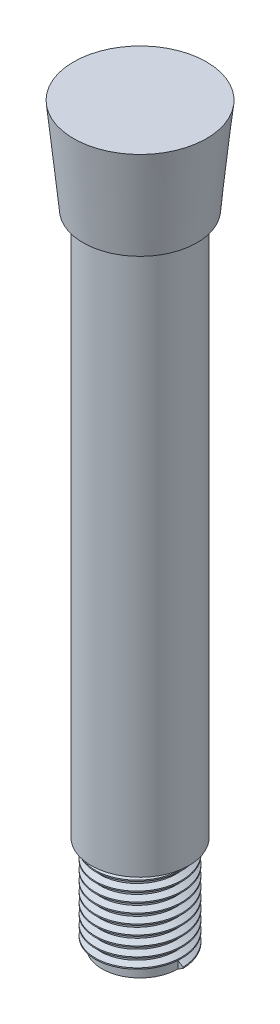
ISO-10303-21;
HEADER;
FILE_DESCRIPTION(('STEP AP214'),'2;1');
FILE_NAME('part.step','',(''),(''),'','','');
FILE_SCHEMA(('AUTOMOTIVE_DESIGN { 1 0 10303 214 1 1 1 1 }'));
ENDSEC;
DATA;
#1=APPLICATION_CONTEXT('core data for automotive mechanical design processes');
#2=APPLICATION_PROTOCOL_DEFINITION('international standard','automotive_design',2000,#1);
#3=PRODUCT_CONTEXT('',#1,'mechanical');
#4=PRODUCT('Part','Part','',(#3));
#5=PRODUCT_RELATED_PRODUCT_CATEGORY('part','',(#4));
#6=PRODUCT_DEFINITION_FORMATION('','',#4);
#7=PRODUCT_DEFINITION_CONTEXT('part definition',#1,'design');
#8=PRODUCT_DEFINITION('design','',#6,#7);
#9=PRODUCT_DEFINITION_SHAPE('','',#8);
#10=(LENGTH_UNIT() NAMED_UNIT(*) SI_UNIT(.MILLI.,.METRE.));
#11=(NAMED_UNIT(*) PLANE_ANGLE_UNIT() SI_UNIT($,.RADIAN.));
#12=(NAMED_UNIT(*) SI_UNIT($,.STERADIAN.) SOLID_ANGLE_UNIT());
#13=UNCERTAINTY_MEASURE_WITH_UNIT(LENGTH_MEASURE(1.E-05),#10,'distance_accuracy_value','');
#14=(GEOMETRIC_REPRESENTATION_CONTEXT(3) GLOBAL_UNCERTAINTY_ASSIGNED_CONTEXT((#13)) GLOBAL_UNIT_ASSIGNED_CONTEXT((#10,
#11,#12)) REPRESENTATION_CONTEXT('',''));
#15=CARTESIAN_POINT('',(0.,0.,0.));
#16=DIRECTION('',(0.,0.,1.));
#17=DIRECTION('',(1.,0.,0.));
#18=AXIS2_PLACEMENT_3D('',#15,#16,#17);
#19=CARTESIAN_POINT('',(0.,10.,0.));
#20=DIRECTION('',(0.,-1.,0.));
#21=DIRECTION('',(0.,0.,-1.));
#22=AXIS2_PLACEMENT_3D('',#19,#20,#21);
#23=PLANE('',#22);
#24=CARTESIAN_POINT('',(0.,10.,0.));
#25=DIRECTION('',(0.,-1.,0.));
#26=DIRECTION('',(0.,0.,-1.));
#27=AXIS2_PLACEMENT_3D('',#24,#25,#26);
#28=CIRCLE('',#27,5.1486689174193);
#29=CARTESIAN_POINT('',(0.,10.,-5.1486689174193));
#30=VERTEX_POINT('',#29);
#31=EDGE_CURVE('E177',#30,#30,#28,.F.);
#32=ORIENTED_EDGE('',*,*,#31,.F.);
#33=EDGE_LOOP('',(#32));
#34=FACE_BOUND('',#33,.T.);
#35=CARTESIAN_POINT('',(-4.19558257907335,10.,1.73786724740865));
#36=CARTESIAN_POINT('',(-4.1636892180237,10.,1.81488254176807));
#37=CARTESIAN_POINT('',(-4.12965744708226,10.,1.89103352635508));
#38=CARTESIAN_POINT('',(-4.02081916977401,9.99999999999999,2.11760830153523));
#39=CARTESIAN_POINT('',(-3.93966507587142,10.,2.26502766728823));
#40=CARTESIAN_POINT('',(-3.76148061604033,10.,2.55002560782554));
#41=CARTESIAN_POINT('',(-3.66444253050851,10.,2.68759935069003));
#42=CARTESIAN_POINT('',(-3.48195550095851,10.,2.9180363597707));
#43=CARTESIAN_POINT('',(-3.39971025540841,10.,3.01345527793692));
#44=CARTESIAN_POINT('',(-3.22761007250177,10.,3.19710091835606));
#45=CARTESIAN_POINT('',(-3.13775840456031,10.,3.2853306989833));
#46=CARTESIAN_POINT('',(-2.94977764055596,10.,3.45516563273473));
#47=CARTESIAN_POINT('',(-2.85155303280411,10.,3.53666505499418));
#48=CARTESIAN_POINT('',(-2.64857877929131,10.,3.69112389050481));
#49=CARTESIAN_POINT('',(-2.54382803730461,10.,3.7640818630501));
#50=CARTESIAN_POINT('',(-2.32534561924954,10.,3.90296089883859));
#51=CARTESIAN_POINT('',(-2.21143932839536,10.,3.96860744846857));
#52=CARTESIAN_POINT('',(-1.97837524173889,10.,4.08979418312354));
#53=CARTESIAN_POINT('',(-1.85921755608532,10.,4.14533458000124));
#54=CARTESIAN_POINT('',(-1.73786717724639,10.,4.19558260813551));
#55=B_SPLINE_CURVE_WITH_KNOTS('',3,(#35,#36,#37,#38,#39,#40,#41,#42,#43,#44,#45,#46,#47,#48,#49,
#50,#51,#52,#53,#54),.UNSPECIFIED.,.F.,.F.,(4,2,2,2,2,2,2,2,2,4),(0.,0.250094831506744,
0.75384481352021,1.25784034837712,1.63534554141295,2.01268928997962,2.39513633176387,
2.77764778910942,3.17155889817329,3.56546174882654),.UNSPECIFIED.);
#56=CARTESIAN_POINT('',(-4.19558257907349,9.99999999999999,1.73786724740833));
#57=VERTEX_POINT('',#56);
#58=CARTESIAN_POINT('',(-1.7378671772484,9.99999999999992,4.19558260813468));
#59=VERTEX_POINT('',#58);
#60=EDGE_CURVE('E12',#57,#59,#55,.T.);
#61=ORIENTED_EDGE('',*,*,#60,.T.);
#62=CARTESIAN_POINT('',(-1.73786717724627,10.,4.19558260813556));
#63=CARTESIAN_POINT('',(-1.6316816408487,10.,4.23202036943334));
#64=CARTESIAN_POINT('',(-1.52413875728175,10.,4.264497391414));
#65=CARTESIAN_POINT('',(-1.30695666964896,10.,4.32138135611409));
#66=CARTESIAN_POINT('',(-1.19731778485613,10.,4.34578951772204));
#67=CARTESIAN_POINT('',(-0.976408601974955,10.,4.38642051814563));
#68=CARTESIAN_POINT('',(-0.865136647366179,10.,4.40263435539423));
#69=CARTESIAN_POINT('',(-0.641689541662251,10.,4.42675333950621));
#70=CARTESIAN_POINT('',(-0.529514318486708,10.,4.43465781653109));
#71=CARTESIAN_POINT('',(-0.304811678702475,10.,4.44210696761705));
#72=CARTESIAN_POINT('',(-0.192284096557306,10.,4.44164682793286));
#73=CARTESIAN_POINT('',(-0.023779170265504,10.,4.43470406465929));
#74=CARTESIAN_POINT('',(0.0323420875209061,10.,4.43134763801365));
#75=CARTESIAN_POINT('',(0.144417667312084,10.,4.42243724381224));
#76=CARTESIAN_POINT('',(0.200371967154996,10.,4.41688299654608));
#77=CARTESIAN_POINT('',(0.367767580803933,10.,4.39696025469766));
#78=CARTESIAN_POINT('',(0.478838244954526,10.,4.37932784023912));
#79=CARTESIAN_POINT('',(0.699275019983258,10.,4.3354508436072));
#80=CARTESIAN_POINT('',(0.808640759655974,10.,4.30920441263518));
#81=CARTESIAN_POINT('',(1.03547715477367,10.,4.24530450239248));
#82=CARTESIAN_POINT('',(1.15270734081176,10.,4.20679263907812));
#83=CARTESIAN_POINT('',(1.38343275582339,10.,4.11988017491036));
#84=CARTESIAN_POINT('',(1.4969281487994,10.,4.07148000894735));
#85=CARTESIAN_POINT('',(1.71947745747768,10.,3.96508779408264));
#86=CARTESIAN_POINT('',(1.82852659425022,10.,3.90708574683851));
#87=CARTESIAN_POINT('',(2.04125139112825,10.,3.78195265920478));
#88=CARTESIAN_POINT('',(2.14492724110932,9.99999999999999,3.71482194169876));
#89=CARTESIAN_POINT('',(2.3445482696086,9.99999999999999,3.5730613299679));
#90=CARTESIAN_POINT('',(2.44058988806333,10.,3.49856706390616));
#91=CARTESIAN_POINT('',(2.6260307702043,10.,3.34176259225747));
#92=CARTESIAN_POINT('',(2.7154323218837,10.,3.25945510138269));
#93=CARTESIAN_POINT('',(2.84405211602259,10.,3.13060625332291));
#94=CARTESIAN_POINT('',(2.88600678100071,10.,3.08676445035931));
#95=CARTESIAN_POINT('',(2.96802845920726,10.,2.99736547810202));
#96=CARTESIAN_POINT('',(3.00809587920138,10.,2.95180868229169));
#97=CARTESIAN_POINT('',(3.12519166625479,10.,2.81253236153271));
#98=CARTESIAN_POINT('',(3.19913528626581,10.,2.71618529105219));
#99=CARTESIAN_POINT('',(3.33719027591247,10.,2.51877170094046));
#100=CARTESIAN_POINT('',(3.4014278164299,10.,2.41779304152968));
#101=CARTESIAN_POINT('',(3.52084139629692,10.,2.21059344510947));
#102=CARTESIAN_POINT('',(3.57601658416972,10.,2.10437201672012));
#103=CARTESIAN_POINT('',(3.67688919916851,10.,1.88747803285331));
#104=CARTESIAN_POINT('',(3.72258334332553,10.,1.77680395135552));
#105=CARTESIAN_POINT('',(3.80411806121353,10.,1.55188454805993));
#106=CARTESIAN_POINT('',(3.83995893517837,10.,1.43763933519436));
#107=CARTESIAN_POINT('',(3.89934301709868,10.,1.21460578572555));
#108=CARTESIAN_POINT('',(3.92357476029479,10.,1.10600010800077));
#109=CARTESIAN_POINT('',(3.96312976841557,10.,0.887180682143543));
#110=CARTESIAN_POINT('',(3.97845339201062,10.,0.776966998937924));
#111=CARTESIAN_POINT('',(4.00008945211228,10.,0.555656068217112));
#112=CARTESIAN_POINT('',(4.00640161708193,10.,0.444558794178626));
#113=CARTESIAN_POINT('',(4.00998746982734,10.,0.22220947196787));
#114=CARTESIAN_POINT('',(4.00726040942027,10.,0.110957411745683));
#115=CARTESIAN_POINT('',(4.,10.,0.));
#116=B_SPLINE_CURVE_WITH_KNOTS('',3,(#62,#63,#64,#65,#66,#67,#68,#69,#70,#71,#72,#73,#74,#75,
#76,#77,#78,#79,#80,#81,#82,#83,#84,#85,#86,#87,#88,#89,#90,#91,#92,#93,#94,#95,#96,#97,#98,#99,
#100,#101,#102,#103,#104,#105,#106,#107,#108,#109,#110,#111,#112,#113,#114,#115),.UNSPECIFIED.,
.F.,.F.,(4,2,2,2,2,2,2,2,2,2,2,2,2,2,2,2,2,2,2,2,2,2,2,2,2,2,4),(0.,0.336710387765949,
0.673369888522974,1.01039841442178,1.34745410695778,1.68470377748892,1.85333277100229,
2.021983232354,2.35899480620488,2.69607875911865,3.06579868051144,3.43550234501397,
3.80559342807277,4.17567142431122,4.53988747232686,4.90397743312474,5.08597745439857,
5.26793806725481,5.63176768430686,5.99036196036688,6.34898990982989,6.70774183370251,
7.06648282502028,7.39994802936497,7.73339980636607,8.06686163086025,8.40035105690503),.UNSPECIFIED.);
#117=CARTESIAN_POINT('',(4.,10.,0.));
#118=VERTEX_POINT('',#117);
#119=EDGE_CURVE('E63',#59,#118,#116,.T.);
#120=ORIENTED_EDGE('',*,*,#119,.T.);
#121=CARTESIAN_POINT('',(0.,10.,0.));
#122=DIRECTION('',(0.,-1.,0.));
#123=DIRECTION('',(0.,0.,-1.));
#124=AXIS2_PLACEMENT_3D('',#121,#122,#123);
#125=CIRCLE('',#124,4.);
#126=CARTESIAN_POINT('',(-7.24029091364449E-08,10.,-4.));
#127=VERTEX_POINT('',#126);
#128=EDGE_CURVE('E204',#127,#118,#125,.T.);
#129=ORIENTED_EDGE('',*,*,#128,.F.);
#130=CARTESIAN_POINT('',(-7.2402773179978E-08,9.99999999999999,-4.));
#131=CARTESIAN_POINT('',(-0.112484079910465,10.,-4.0073608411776));
#132=CARTESIAN_POINT('',(-0.225271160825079,10.,-4.01006200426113));
#133=CARTESIAN_POINT('',(-0.450682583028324,10.,-4.00617404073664));
#134=CARTESIAN_POINT('',(-0.56330692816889,10.,-3.99958513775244));
#135=CARTESIAN_POINT('',(-0.787584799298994,10.,-3.97715092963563));
#136=CARTESIAN_POINT('',(-0.899238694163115,10.,-3.96130931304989));
#137=CARTESIAN_POINT('',(-1.12085921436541,10.,-3.92048312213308));
#138=CARTESIAN_POINT('',(-1.2308258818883,10.,-3.89549877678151));
#139=CARTESIAN_POINT('',(-1.44837884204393,10.,-3.83654166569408));
#140=CARTESIAN_POINT('',(-1.55596398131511,10.,-3.80256464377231));
#141=CARTESIAN_POINT('',(-1.76796794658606,10.,-3.72585938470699));
#142=CARTESIAN_POINT('',(-1.87238676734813,10.,-3.68313113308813));
#143=CARTESIAN_POINT('',(-2.07730221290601,10.,-3.58923755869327));
#144=CARTESIAN_POINT('',(-2.1778006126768,10.,-3.53807611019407));
#145=CARTESIAN_POINT('',(-2.37423356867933,10.,-3.42765285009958));
#146=CARTESIAN_POINT('',(-2.47016840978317,10.,-3.36839154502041));
#147=CARTESIAN_POINT('',(-2.65886013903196,10.,-3.24081899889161));
#148=CARTESIAN_POINT('',(-2.7515038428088,10.,-3.17234012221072));
#149=CARTESIAN_POINT('',(-2.9306742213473,10.,-3.02779684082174));
#150=CARTESIAN_POINT('',(-3.01720027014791,10.,-2.95173166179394));
#151=CARTESIAN_POINT('',(-3.18398136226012,10.,-2.79290025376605));
#152=CARTESIAN_POINT('',(-3.26423153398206,10.,-2.71012891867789));
#153=CARTESIAN_POINT('',(-3.41784797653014,10.,-2.53842947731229));
#154=CARTESIAN_POINT('',(-3.49121437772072,10.,-2.44950148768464));
#155=CARTESIAN_POINT('',(-3.63284681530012,10.,-2.26310339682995));
#156=CARTESIAN_POINT('',(-3.70087278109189,10.,-2.16545050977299));
#157=CARTESIAN_POINT('',(-3.82862125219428,10.,-1.96488638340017));
#158=CARTESIAN_POINT('',(-3.88834366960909,10.,-1.8619750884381));
#159=CARTESIAN_POINT('',(-4.0543331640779,10.,-1.54655862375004));
#160=CARTESIAN_POINT('',(-4.14765055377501,10.,-1.32707005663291));
#161=CARTESIAN_POINT('',(-4.29841056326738,10.,-0.871018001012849));
#162=CARTESIAN_POINT('',(-4.35507998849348,10.,-0.634197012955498));
#163=CARTESIAN_POINT('',(-4.40060976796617,10.,-0.33463898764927));
#164=CARTESIAN_POINT('',(-4.40845952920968,10.,-0.274454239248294));
#165=CARTESIAN_POINT('',(-4.42161149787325,10.,-0.15380589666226));
#166=CARTESIAN_POINT('',(-4.42691414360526,10.,-0.093342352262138));
#167=CARTESIAN_POINT('',(-4.43499442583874,10.,0.0277575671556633));
#168=CARTESIAN_POINT('',(-4.43777173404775,10.,0.0883939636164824));
#169=CARTESIAN_POINT('',(-4.44091268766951,10.,0.209729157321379));
#170=CARTESIAN_POINT('',(-4.44127619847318,10.,0.270427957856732));
#171=CARTESIAN_POINT('',(-4.43872852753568,9.99999999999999,0.450667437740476));
#172=CARTESIAN_POINT('',(-4.43229920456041,10.,0.570178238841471));
#173=CARTESIAN_POINT('',(-4.41001941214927,10.,0.808293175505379));
#174=CARTESIAN_POINT('',(-4.39416978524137,10.,0.926897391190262));
#175=CARTESIAN_POINT('',(-4.35316965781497,10.,1.16231512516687));
#176=CARTESIAN_POINT('',(-4.32803254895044,10.,1.27913097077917));
#177=CARTESIAN_POINT('',(-4.2686199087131,10.,1.51043335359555));
#178=CARTESIAN_POINT('',(-4.23434302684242,10.,1.62491954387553));
#179=CARTESIAN_POINT('',(-4.19558257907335,10.,1.73786724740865));
#180=B_SPLINE_CURVE_WITH_KNOTS('',3,(#130,#131,#132,#133,#134,#135,#136,#137,#138,#139,#140,
#141,#142,#143,#144,#145,#146,#147,#148,#149,#150,#151,#152,#153,#154,#155,#156,#157,#158,#159,
#160,#161,#162,#163,#164,#165,#166,#167,#168,#169,#170,#171,#172,#173,#174,#175,#176,#177,#178,
#179),.UNSPECIFIED.,.F.,.F.,(4,2,2,2,2,2,2,2,2,2,2,2,2,2,2,2,2,2,2,2,2,2,2,2,4),(0.,
0.338075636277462,0.676143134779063,1.01407595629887,1.35200031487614,1.69008489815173,
2.02817004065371,2.3661002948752,2.70400942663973,3.04920729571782,3.39444043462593,
3.73993895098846,4.08543092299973,4.44203963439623,4.79865212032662,5.51075854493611,
6.23743705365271,6.41949427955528,6.60152016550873,6.78356971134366,6.96562940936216,
7.32427155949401,7.68288163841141,8.04097664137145,8.39912458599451),.UNSPECIFIED.);
#181=EDGE_CURVE('E55',#127,#57,#180,.T.);
#182=ORIENTED_EDGE('',*,*,#181,.T.);
#183=EDGE_LOOP('',(#61,#120,#129,#182));
#184=FACE_BOUND('',#183,.T.);
#185=ADVANCED_FACE('F34',(#34,#184),#23,.T.);
#186=CARTESIAN_POINT('',(0.,10.,0.));
#187=DIRECTION('',(0.,-1.,0.));
#188=DIRECTION('',(0.,0.,-1.));
#189=AXIS2_PLACEMENT_3D('',#186,#187,#188);
#190=CYLINDRICAL_SURFACE('',#189,4.);
#191=ORIENTED_EDGE('',*,*,#128,.T.);
#192=CARTESIAN_POINT('',(4.,0.,0.));
#193=CARTESIAN_POINT('',(4.,0.0625,-1.65685424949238));
#194=CARTESIAN_POINT('',(2.82842712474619,0.125,-2.82842712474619));
#195=CARTESIAN_POINT('',(1.65685424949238,0.1875,-4.));
#196=CARTESIAN_POINT('',(0.,0.25,-4.));
#197=CARTESIAN_POINT('',(-1.65685424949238,0.3125,-4.));
#198=CARTESIAN_POINT('',(-2.82842712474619,0.375,-2.82842712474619));
#199=CARTESIAN_POINT('',(-4.,0.4375,-1.65685424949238));
#200=CARTESIAN_POINT('',(-4.,0.5,0.));
#201=CARTESIAN_POINT('',(-4.,0.5625,1.65685424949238));
#202=CARTESIAN_POINT('',(-2.82842712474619,0.625,2.82842712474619));
#203=CARTESIAN_POINT('',(-1.65685424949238,0.6875,4.));
#204=CARTESIAN_POINT('',(0.,0.75,4.));
#205=CARTESIAN_POINT('',(1.65685424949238,0.8125,4.));
#206=CARTESIAN_POINT('',(2.82842712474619,0.875,2.82842712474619));
#207=CARTESIAN_POINT('',(4.,0.9375,1.65685424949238));
#208=CARTESIAN_POINT('',(4.,1.,0.));
#209=CARTESIAN_POINT('',(4.,1.0625,-1.65685424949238));
#210=CARTESIAN_POINT('',(2.82842712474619,1.125,-2.82842712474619));
#211=CARTESIAN_POINT('',(1.65685424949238,1.1875,-4.));
#212=CARTESIAN_POINT('',(0.,1.25,-4.));
#213=CARTESIAN_POINT('',(-1.65685424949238,1.3125,-4.));
#214=CARTESIAN_POINT('',(-2.82842712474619,1.375,-2.82842712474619));
#215=CARTESIAN_POINT('',(-4.,1.4375,-1.65685424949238));
#216=CARTESIAN_POINT('',(-4.,1.5,0.));
#217=CARTESIAN_POINT('',(-4.,1.5625,1.65685424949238));
#218=CARTESIAN_POINT('',(-2.82842712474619,1.625,2.82842712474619));
#219=CARTESIAN_POINT('',(-1.65685424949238,1.6875,4.));
#220=CARTESIAN_POINT('',(0.,1.75,4.));
#221=CARTESIAN_POINT('',(1.65685424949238,1.8125,4.));
#222=CARTESIAN_POINT('',(2.82842712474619,1.875,2.82842712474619));
#223=CARTESIAN_POINT('',(4.,1.9375,1.65685424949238));
#224=CARTESIAN_POINT('',(4.,2.,0.));
#225=CARTESIAN_POINT('',(4.,2.0625,-1.65685424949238));
#226=CARTESIAN_POINT('',(2.82842712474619,2.125,-2.82842712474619));
#227=CARTESIAN_POINT('',(1.65685424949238,2.1875,-4.));
#228=CARTESIAN_POINT('',(0.,2.25,-4.));
#229=CARTESIAN_POINT('',(-1.65685424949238,2.3125,-4.));
#230=CARTESIAN_POINT('',(-2.82842712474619,2.375,-2.82842712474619));
#231=CARTESIAN_POINT('',(-4.,2.4375,-1.65685424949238));
#232=CARTESIAN_POINT('',(-4.,2.5,0.));
#233=CARTESIAN_POINT('',(-4.,2.5625,1.65685424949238));
#234=CARTESIAN_POINT('',(-2.82842712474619,2.625,2.82842712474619));
#235=CARTESIAN_POINT('',(-1.65685424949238,2.6875,4.));
#236=CARTESIAN_POINT('',(0.,2.75,4.));
#237=CARTESIAN_POINT('',(1.65685424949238,2.8125,4.));
#238=CARTESIAN_POINT('',(2.82842712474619,2.875,2.82842712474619));
#239=CARTESIAN_POINT('',(4.,2.9375,1.65685424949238));
#240=CARTESIAN_POINT('',(4.,3.,0.));
#241=CARTESIAN_POINT('',(4.,3.0625,-1.65685424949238));
#242=CARTESIAN_POINT('',(2.82842712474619,3.125,-2.82842712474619));
#243=CARTESIAN_POINT('',(1.65685424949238,3.1875,-4.));
#244=CARTESIAN_POINT('',(0.,3.25,-4.));
#245=CARTESIAN_POINT('',(-1.65685424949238,3.3125,-4.));
#246=CARTESIAN_POINT('',(-2.82842712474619,3.375,-2.82842712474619));
#247=CARTESIAN_POINT('',(-4.,3.4375,-1.65685424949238));
#248=CARTESIAN_POINT('',(-4.,3.5,0.));
#249=CARTESIAN_POINT('',(-4.,3.5625,1.65685424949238));
#250=CARTESIAN_POINT('',(-2.82842712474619,3.625,2.82842712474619));
#251=CARTESIAN_POINT('',(-1.65685424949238,3.6875,4.));
#252=CARTESIAN_POINT('',(0.,3.75,4.));
#253=CARTESIAN_POINT('',(1.65685424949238,3.8125,4.));
#254=CARTESIAN_POINT('',(2.82842712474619,3.875,2.82842712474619));
#255=CARTESIAN_POINT('',(4.,3.9375,1.65685424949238));
#256=CARTESIAN_POINT('',(4.,4.,0.));
#257=CARTESIAN_POINT('',(4.,4.0625,-1.65685424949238));
#258=CARTESIAN_POINT('',(2.82842712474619,4.125,-2.82842712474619));
#259=CARTESIAN_POINT('',(1.65685424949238,4.1875,-4.));
#260=CARTESIAN_POINT('',(0.,4.25,-4.));
#261=CARTESIAN_POINT('',(-1.65685424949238,4.3125,-4.));
#262=CARTESIAN_POINT('',(-2.82842712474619,4.375,-2.82842712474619));
#263=CARTESIAN_POINT('',(-4.,4.4375,-1.65685424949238));
#264=CARTESIAN_POINT('',(-4.,4.5,0.));
#265=CARTESIAN_POINT('',(-4.,4.5625,1.65685424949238));
#266=CARTESIAN_POINT('',(-2.82842712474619,4.625,2.82842712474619));
#267=CARTESIAN_POINT('',(-1.65685424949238,4.6875,4.));
#268=CARTESIAN_POINT('',(0.,4.75,4.));
#269=CARTESIAN_POINT('',(1.65685424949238,4.8125,4.));
#270=CARTESIAN_POINT('',(2.82842712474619,4.875,2.82842712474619));
#271=CARTESIAN_POINT('',(4.,4.9375,1.65685424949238));
#272=CARTESIAN_POINT('',(4.,5.,0.));
#273=CARTESIAN_POINT('',(4.,5.0625,-1.65685424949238));
#274=CARTESIAN_POINT('',(2.82842712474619,5.125,-2.82842712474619));
#275=CARTESIAN_POINT('',(1.65685424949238,5.1875,-4.));
#276=CARTESIAN_POINT('',(0.,5.25,-4.));
#277=CARTESIAN_POINT('',(-1.65685424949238,5.3125,-4.));
#278=CARTESIAN_POINT('',(-2.82842712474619,5.375,-2.82842712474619));
#279=CARTESIAN_POINT('',(-4.,5.4375,-1.65685424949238));
#280=CARTESIAN_POINT('',(-4.,5.5,0.));
#281=CARTESIAN_POINT('',(-4.,5.5625,1.65685424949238));
#282=CARTESIAN_POINT('',(-2.82842712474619,5.625,2.82842712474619));
#283=CARTESIAN_POINT('',(-1.65685424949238,5.6875,4.));
#284=CARTESIAN_POINT('',(0.,5.75,4.));
#285=CARTESIAN_POINT('',(1.65685424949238,5.8125,4.));
#286=CARTESIAN_POINT('',(2.82842712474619,5.875,2.82842712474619));
#287=CARTESIAN_POINT('',(4.,5.9375,1.65685424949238));
#288=CARTESIAN_POINT('',(4.,6.,0.));
#289=CARTESIAN_POINT('',(4.,6.0625,-1.65685424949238));
#290=CARTESIAN_POINT('',(2.82842712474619,6.125,-2.82842712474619));
#291=CARTESIAN_POINT('',(1.65685424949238,6.1875,-4.));
#292=CARTESIAN_POINT('',(0.,6.25,-4.));
#293=CARTESIAN_POINT('',(-1.65685424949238,6.3125,-4.));
#294=CARTESIAN_POINT('',(-2.82842712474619,6.375,-2.82842712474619));
#295=CARTESIAN_POINT('',(-4.,6.4375,-1.65685424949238));
#296=CARTESIAN_POINT('',(-4.,6.5,0.));
#297=CARTESIAN_POINT('',(-4.,6.5625,1.65685424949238));
#298=CARTESIAN_POINT('',(-2.82842712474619,6.625,2.82842712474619));
#299=CARTESIAN_POINT('',(-1.65685424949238,6.6875,4.));
#300=CARTESIAN_POINT('',(0.,6.75,4.));
#301=CARTESIAN_POINT('',(1.65685424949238,6.8125,4.));
#302=CARTESIAN_POINT('',(2.82842712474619,6.875,2.82842712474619));
#303=CARTESIAN_POINT('',(4.,6.9375,1.65685424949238));
#304=CARTESIAN_POINT('',(4.,7.,0.));
#305=CARTESIAN_POINT('',(4.,7.0625,-1.65685424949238));
#306=CARTESIAN_POINT('',(2.82842712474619,7.125,-2.82842712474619));
#307=CARTESIAN_POINT('',(1.65685424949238,7.1875,-4.));
#308=CARTESIAN_POINT('',(0.,7.25,-4.));
#309=CARTESIAN_POINT('',(-1.65685424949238,7.3125,-4.));
#310=CARTESIAN_POINT('',(-2.82842712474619,7.375,-2.82842712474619));
#311=CARTESIAN_POINT('',(-4.,7.4375,-1.65685424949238));
#312=CARTESIAN_POINT('',(-4.,7.5,0.));
#313=CARTESIAN_POINT('',(-4.,7.5625,1.65685424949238));
#314=CARTESIAN_POINT('',(-2.82842712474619,7.625,2.82842712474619));
#315=CARTESIAN_POINT('',(-1.65685424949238,7.6875,4.));
#316=CARTESIAN_POINT('',(0.,7.75,4.));
#317=CARTESIAN_POINT('',(1.65685424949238,7.8125,4.));
#318=CARTESIAN_POINT('',(2.82842712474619,7.875,2.82842712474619));
#319=CARTESIAN_POINT('',(4.,7.9375,1.65685424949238));
#320=CARTESIAN_POINT('',(4.,8.,0.));
#321=CARTESIAN_POINT('',(4.,8.0625,-1.65685424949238));
#322=CARTESIAN_POINT('',(2.82842712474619,8.125,-2.82842712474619));
#323=CARTESIAN_POINT('',(1.65685424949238,8.1875,-4.));
#324=CARTESIAN_POINT('',(0.,8.25,-4.));
#325=CARTESIAN_POINT('',(-1.65685424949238,8.3125,-4.));
#326=CARTESIAN_POINT('',(-2.82842712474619,8.375,-2.82842712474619));
#327=CARTESIAN_POINT('',(-4.,8.4375,-1.65685424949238));
#328=CARTESIAN_POINT('',(-4.,8.5,0.));
#329=CARTESIAN_POINT('',(-4.,8.5625,1.65685424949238));
#330=CARTESIAN_POINT('',(-2.82842712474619,8.625,2.82842712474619));
#331=CARTESIAN_POINT('',(-1.65685424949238,8.6875,4.));
#332=CARTESIAN_POINT('',(0.,8.75,4.));
#333=CARTESIAN_POINT('',(1.65685424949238,8.8125,4.));
#334=CARTESIAN_POINT('',(2.82842712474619,8.875,2.82842712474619));
#335=CARTESIAN_POINT('',(4.,8.9375,1.65685424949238));
#336=CARTESIAN_POINT('',(4.,9.,0.));
#337=CARTESIAN_POINT('',(4.,9.0625,-1.65685424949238));
#338=CARTESIAN_POINT('',(2.82842712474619,9.125,-2.82842712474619));
#339=CARTESIAN_POINT('',(1.65685424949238,9.1875,-4.));
#340=CARTESIAN_POINT('',(0.,9.25,-4.));
#341=CARTESIAN_POINT('',(-1.65685424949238,9.3125,-4.));
#342=CARTESIAN_POINT('',(-2.82842712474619,9.375,-2.82842712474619));
#343=CARTESIAN_POINT('',(-4.,9.4375,-1.65685424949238));
#344=CARTESIAN_POINT('',(-4.,9.5,0.));
#345=CARTESIAN_POINT('',(-4.,9.5625,1.65685424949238));
#346=CARTESIAN_POINT('',(-2.82842712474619,9.625,2.82842712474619));
#347=CARTESIAN_POINT('',(-1.65685424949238,9.6875,4.));
#348=CARTESIAN_POINT('',(0.,9.75,4.));
#349=CARTESIAN_POINT('',(1.65685424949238,9.8125,4.));
#350=CARTESIAN_POINT('',(2.82842712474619,9.875,2.82842712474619));
#351=CARTESIAN_POINT('',(4.,9.9375,1.65685424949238));
#352=CARTESIAN_POINT('',(4.,10.,0.));
#353=(BOUNDED_CURVE() B_SPLINE_CURVE(2,(#192,#193,#194,#195,#196,#197,#198,#199,#200,#201,#202,
#203,#204,#205,#206,#207,#208,#209,#210,#211,#212,#213,#214,#215,#216,#217,#218,#219,#220,#221,
#222,#223,#224,#225,#226,#227,#228,#229,#230,#231,#232,#233,#234,#235,#236,#237,#238,#239,#240,
#241,#242,#243,#244,#245,#246,#247,#248,#249,#250,#251,#252,#253,#254,#255,#256,#257,#258,#259,
#260,#261,#262,#263,#264,#265,#266,#267,#268,#269,#270,#271,#272,#273,#274,#275,#276,#277,#278,
#279,#280,#281,#282,#283,#284,#285,#286,#287,#288,#289,#290,#291,#292,#293,#294,#295,#296,#297,
#298,#299,#300,#301,#302,#303,#304,#305,#306,#307,#308,#309,#310,#311,#312,#313,#314,#315,#316,
#317,#318,#319,#320,#321,#322,#323,#324,#325,#326,#327,#328,#329,#330,#331,#332,#333,#334,#335,
#336,#337,#338,#339,#340,#341,#342,#343,#344,#345,#346,#347,#348,#349,#350,#351,#352),
.UNSPECIFIED.,.F.,.F.) B_SPLINE_CURVE_WITH_KNOTS((3,2,2,2,2,2,2,2,2,2,2,2,2,2,2,2,2,2,2,2,2,2,2,
2,2,2,2,2,2,2,2,2,2,2,2,2,2,2,2,2,2,2,2,2,2,2,2,2,2,2,2,2,2,2,2,2,2,2,2,2,2,2,2,2,2,2,2,2,2,2,2,
2,2,2,2,2,2,2,2,2,3),(0.,0.0125,0.025,0.0375,0.05,0.0625,0.075,0.0875,0.1,0.1125,0.125,0.1375,
0.15,0.1625,0.175,0.1875,0.2,0.2125,0.225,0.2375,0.25,0.2625,0.275,0.2875,0.3,0.3125,0.325,
0.3375,0.35,0.3625,0.375,0.3875,0.4,0.4125,0.425,0.4375,0.45,0.4625,0.475,0.4875,0.5,0.5125,
0.525,0.5375,0.55,0.5625,0.575,0.5875,0.6,0.6125,0.625,0.6375,0.65,0.6625,0.675,0.6875,0.7,
0.7125,0.725,0.7375,0.75,0.7625,0.775,0.7875,0.8,0.8125,0.825,0.8375,0.85,0.8625,0.875,0.8875,
0.9,0.9125,0.925,0.9375,0.95,0.9625,0.975,0.9875,1.),
.UNSPECIFIED.) CURVE() GEOMETRIC_REPRESENTATION_ITEM() RATIONAL_B_SPLINE_CURVE((1.,
0.923879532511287,1.,0.923879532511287,1.,0.923879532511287,1.,0.923879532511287,1.,
0.923879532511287,1.,0.923879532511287,1.,0.923879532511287,1.,0.923879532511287,1.,
0.923879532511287,1.,0.923879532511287,1.,0.923879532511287,1.,0.923879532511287,1.,
0.923879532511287,1.,0.923879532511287,1.,0.923879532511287,1.,0.923879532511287,1.,
0.923879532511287,1.,0.923879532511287,1.,0.923879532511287,1.,0.923879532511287,1.,
0.923879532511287,1.,0.923879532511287,1.,0.923879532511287,1.,0.923879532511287,1.,
0.923879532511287,1.,0.923879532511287,1.,0.923879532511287,1.,0.923879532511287,1.,
0.923879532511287,1.,0.923879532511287,1.,0.923879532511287,1.,0.923879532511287,1.,
0.923879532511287,1.,0.923879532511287,1.,0.923879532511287,1.,0.923879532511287,1.,
0.923879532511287,1.,0.923879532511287,1.,0.923879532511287,1.,0.923879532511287,1.,
0.923879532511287,1.,0.923879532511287,1.,0.923879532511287,1.,0.923879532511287,1.,
0.923879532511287,1.,0.923879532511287,1.,0.923879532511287,1.,0.923879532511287,1.,
0.923879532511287,1.,0.923879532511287,1.,0.923879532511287,1.,0.923879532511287,1.,
0.923879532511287,1.,0.923879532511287,1.,0.923879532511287,1.,0.923879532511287,1.,
0.923879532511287,1.,0.923879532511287,1.,0.923879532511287,1.,0.923879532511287,1.,
0.923879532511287,1.,0.923879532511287,1.,0.923879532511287,1.,0.923879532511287,1.,
0.923879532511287,1.,0.923879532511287,1.,0.923879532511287,1.,0.923879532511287,1.,
0.923879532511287,1.,0.923879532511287,1.,0.923879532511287,1.,0.923879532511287,1.,
0.923879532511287,1.,0.923879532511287,1.,0.923879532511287,1.,0.923879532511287,1.,
0.923879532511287,1.,0.923879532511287,1.,0.923879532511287,1.,0.923879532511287,1.)) REPRESENTATION_ITEM(''));
#354=CARTESIAN_POINT('',(4.,0.,0.));
#355=VERTEX_POINT('',#354);
#356=EDGE_CURVE('E104',#355,#118,#353,.T.);
#357=ORIENTED_EDGE('',*,*,#356,.F.);
#358=CARTESIAN_POINT('',(0.,0.,0.));
#359=DIRECTION('',(0.,-1.,0.));
#360=DIRECTION('',(0.,0.,-1.));
#361=AXIS2_PLACEMENT_3D('',#358,#359,#360);
#362=CIRCLE('',#361,4.);
#363=EDGE_CURVE('E103',#355,#355,#362,.T.);
#364=ORIENTED_EDGE('',*,*,#363,.F.);
#365=DIRECTION('',(0.,-1.,0.));
#366=VECTOR('',#365,1.);
#367=CARTESIAN_POINT('',(4.,0.374999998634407,0.));
#368=LINE('',#367,#366);
#369=CARTESIAN_POINT('',(4.,0.749999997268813,0.));
#370=VERTEX_POINT('',#369);
#371=EDGE_CURVE('E86',#370,#355,#368,.T.);
#372=ORIENTED_EDGE('',*,*,#371,.F.);
#373=CARTESIAN_POINT('',(4.,0.749999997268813,0.));
#374=CARTESIAN_POINT('',(4.,0.812499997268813,-1.65685424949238));
#375=CARTESIAN_POINT('',(2.82842712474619,0.874999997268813,-2.82842712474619));
#376=CARTESIAN_POINT('',(1.65685424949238,0.937499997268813,-4.));
#377=CARTESIAN_POINT('',(0.,0.999999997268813,-4.));
#378=CARTESIAN_POINT('',(-1.65685424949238,1.06249999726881,-4.));
#379=CARTESIAN_POINT('',(-2.82842712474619,1.12499999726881,-2.82842712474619));
#380=CARTESIAN_POINT('',(-4.,1.18749999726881,-1.65685424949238));
#381=CARTESIAN_POINT('',(-4.,1.24999999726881,0.));
#382=CARTESIAN_POINT('',(-4.,1.31249999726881,1.65685424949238));
#383=CARTESIAN_POINT('',(-2.82842712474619,1.37499999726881,2.82842712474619));
#384=CARTESIAN_POINT('',(-1.65685424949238,1.43749999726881,4.));
#385=CARTESIAN_POINT('',(0.,1.49999999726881,4.));
#386=CARTESIAN_POINT('',(1.65685424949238,1.56249999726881,4.));
#387=CARTESIAN_POINT('',(2.82842712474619,1.62499999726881,2.82842712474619));
#388=CARTESIAN_POINT('',(4.,1.68749999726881,1.65685424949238));
#389=CARTESIAN_POINT('',(4.,1.74999999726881,0.));
#390=CARTESIAN_POINT('',(4.,1.81249999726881,-1.65685424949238));
#391=CARTESIAN_POINT('',(2.82842712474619,1.87499999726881,-2.82842712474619));
#392=CARTESIAN_POINT('',(1.65685424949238,1.93749999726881,-4.));
#393=CARTESIAN_POINT('',(0.,1.99999999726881,-4.));
#394=CARTESIAN_POINT('',(-1.65685424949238,2.06249999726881,-4.));
#395=CARTESIAN_POINT('',(-2.82842712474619,2.12499999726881,-2.82842712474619));
#396=CARTESIAN_POINT('',(-4.,2.18749999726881,-1.65685424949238));
#397=CARTESIAN_POINT('',(-4.,2.24999999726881,0.));
#398=CARTESIAN_POINT('',(-4.,2.31249999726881,1.65685424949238));
#399=CARTESIAN_POINT('',(-2.82842712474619,2.37499999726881,2.82842712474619));
#400=CARTESIAN_POINT('',(-1.65685424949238,2.43749999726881,4.));
#401=CARTESIAN_POINT('',(0.,2.49999999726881,4.));
#402=CARTESIAN_POINT('',(1.65685424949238,2.56249999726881,4.));
#403=CARTESIAN_POINT('',(2.82842712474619,2.62499999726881,2.82842712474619));
#404=CARTESIAN_POINT('',(4.,2.68749999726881,1.65685424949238));
#405=CARTESIAN_POINT('',(4.,2.74999999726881,0.));
#406=CARTESIAN_POINT('',(4.,2.81249999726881,-1.65685424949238));
#407=CARTESIAN_POINT('',(2.82842712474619,2.87499999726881,-2.82842712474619));
#408=CARTESIAN_POINT('',(1.65685424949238,2.93749999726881,-4.));
#409=CARTESIAN_POINT('',(0.,2.99999999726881,-4.));
#410=CARTESIAN_POINT('',(-1.65685424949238,3.06249999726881,-4.));
#411=CARTESIAN_POINT('',(-2.82842712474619,3.12499999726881,-2.82842712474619));
#412=CARTESIAN_POINT('',(-4.,3.18749999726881,-1.65685424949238));
#413=CARTESIAN_POINT('',(-4.,3.24999999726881,0.));
#414=CARTESIAN_POINT('',(-4.,3.31249999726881,1.65685424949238));
#415=CARTESIAN_POINT('',(-2.82842712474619,3.37499999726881,2.82842712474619));
#416=CARTESIAN_POINT('',(-1.65685424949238,3.43749999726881,4.));
#417=CARTESIAN_POINT('',(0.,3.49999999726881,4.));
#418=CARTESIAN_POINT('',(1.65685424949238,3.56249999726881,4.));
#419=CARTESIAN_POINT('',(2.82842712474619,3.62499999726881,2.82842712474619));
#420=CARTESIAN_POINT('',(4.,3.68749999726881,1.65685424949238));
#421=CARTESIAN_POINT('',(4.,3.74999999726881,0.));
#422=CARTESIAN_POINT('',(4.,3.81249999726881,-1.65685424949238));
#423=CARTESIAN_POINT('',(2.82842712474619,3.87499999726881,-2.82842712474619));
#424=CARTESIAN_POINT('',(1.65685424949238,3.93749999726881,-4.));
#425=CARTESIAN_POINT('',(0.,3.99999999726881,-4.));
#426=CARTESIAN_POINT('',(-1.65685424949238,4.06249999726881,-4.));
#427=CARTESIAN_POINT('',(-2.82842712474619,4.12499999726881,-2.82842712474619));
#428=CARTESIAN_POINT('',(-4.,4.18749999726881,-1.65685424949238));
#429=CARTESIAN_POINT('',(-4.,4.24999999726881,0.));
#430=CARTESIAN_POINT('',(-4.,4.31249999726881,1.65685424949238));
#431=CARTESIAN_POINT('',(-2.82842712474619,4.37499999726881,2.82842712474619));
#432=CARTESIAN_POINT('',(-1.65685424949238,4.43749999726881,4.));
#433=CARTESIAN_POINT('',(0.,4.49999999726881,4.));
#434=CARTESIAN_POINT('',(1.65685424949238,4.56249999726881,4.));
#435=CARTESIAN_POINT('',(2.82842712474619,4.62499999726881,2.82842712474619));
#436=CARTESIAN_POINT('',(4.,4.68749999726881,1.65685424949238));
#437=CARTESIAN_POINT('',(4.,4.74999999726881,0.));
#438=CARTESIAN_POINT('',(4.,4.81249999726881,-1.65685424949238));
#439=CARTESIAN_POINT('',(2.82842712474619,4.87499999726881,-2.82842712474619));
#440=CARTESIAN_POINT('',(1.65685424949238,4.93749999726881,-4.));
#441=CARTESIAN_POINT('',(0.,4.99999999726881,-4.));
#442=CARTESIAN_POINT('',(-1.65685424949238,5.06249999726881,-4.));
#443=CARTESIAN_POINT('',(-2.82842712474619,5.12499999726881,-2.82842712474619));
#444=CARTESIAN_POINT('',(-4.,5.18749999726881,-1.65685424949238));
#445=CARTESIAN_POINT('',(-4.,5.24999999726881,0.));
#446=CARTESIAN_POINT('',(-4.,5.31249999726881,1.65685424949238));
#447=CARTESIAN_POINT('',(-2.82842712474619,5.37499999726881,2.82842712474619));
#448=CARTESIAN_POINT('',(-1.65685424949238,5.43749999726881,4.));
#449=CARTESIAN_POINT('',(0.,5.49999999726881,4.));
#450=CARTESIAN_POINT('',(1.65685424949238,5.56249999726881,4.));
#451=CARTESIAN_POINT('',(2.82842712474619,5.62499999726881,2.82842712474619));
#452=CARTESIAN_POINT('',(4.,5.68749999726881,1.65685424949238));
#453=CARTESIAN_POINT('',(4.,5.74999999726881,0.));
#454=CARTESIAN_POINT('',(4.,5.81249999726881,-1.65685424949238));
#455=CARTESIAN_POINT('',(2.82842712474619,5.87499999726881,-2.82842712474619));
#456=CARTESIAN_POINT('',(1.65685424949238,5.93749999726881,-4.));
#457=CARTESIAN_POINT('',(0.,5.99999999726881,-4.));
#458=CARTESIAN_POINT('',(-1.65685424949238,6.06249999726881,-4.));
#459=CARTESIAN_POINT('',(-2.82842712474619,6.12499999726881,-2.82842712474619));
#460=CARTESIAN_POINT('',(-4.,6.18749999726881,-1.65685424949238));
#461=CARTESIAN_POINT('',(-4.,6.24999999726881,0.));
#462=CARTESIAN_POINT('',(-4.,6.31249999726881,1.65685424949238));
#463=CARTESIAN_POINT('',(-2.82842712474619,6.37499999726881,2.82842712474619));
#464=CARTESIAN_POINT('',(-1.65685424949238,6.43749999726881,4.));
#465=CARTESIAN_POINT('',(0.,6.49999999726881,4.));
#466=CARTESIAN_POINT('',(1.65685424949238,6.56249999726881,4.));
#467=CARTESIAN_POINT('',(2.82842712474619,6.62499999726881,2.82842712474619));
#468=CARTESIAN_POINT('',(4.,6.68749999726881,1.65685424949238));
#469=CARTESIAN_POINT('',(4.,6.74999999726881,0.));
#470=CARTESIAN_POINT('',(4.,6.81249999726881,-1.65685424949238));
#471=CARTESIAN_POINT('',(2.82842712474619,6.87499999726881,-2.82842712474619));
#472=CARTESIAN_POINT('',(1.65685424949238,6.93749999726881,-4.));
#473=CARTESIAN_POINT('',(0.,6.99999999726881,-4.));
#474=CARTESIAN_POINT('',(-1.65685424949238,7.06249999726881,-4.));
#475=CARTESIAN_POINT('',(-2.82842712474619,7.12499999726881,-2.82842712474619));
#476=CARTESIAN_POINT('',(-4.,7.18749999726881,-1.65685424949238));
#477=CARTESIAN_POINT('',(-4.,7.24999999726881,0.));
#478=CARTESIAN_POINT('',(-4.,7.31249999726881,1.65685424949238));
#479=CARTESIAN_POINT('',(-2.82842712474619,7.37499999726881,2.82842712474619));
#480=CARTESIAN_POINT('',(-1.65685424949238,7.43749999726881,4.));
#481=CARTESIAN_POINT('',(0.,7.49999999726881,4.));
#482=CARTESIAN_POINT('',(1.65685424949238,7.56249999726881,4.));
#483=CARTESIAN_POINT('',(2.82842712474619,7.62499999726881,2.82842712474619));
#484=CARTESIAN_POINT('',(4.,7.68749999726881,1.65685424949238));
#485=CARTESIAN_POINT('',(4.,7.74999999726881,0.));
#486=CARTESIAN_POINT('',(4.,7.81249999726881,-1.65685424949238));
#487=CARTESIAN_POINT('',(2.82842712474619,7.87499999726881,-2.82842712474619));
#488=CARTESIAN_POINT('',(1.65685424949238,7.93749999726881,-4.));
#489=CARTESIAN_POINT('',(0.,7.99999999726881,-4.));
#490=CARTESIAN_POINT('',(-1.65685424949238,8.06249999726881,-4.));
#491=CARTESIAN_POINT('',(-2.82842712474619,8.12499999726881,-2.82842712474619));
#492=CARTESIAN_POINT('',(-4.,8.18749999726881,-1.65685424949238));
#493=CARTESIAN_POINT('',(-4.,8.24999999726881,0.));
#494=CARTESIAN_POINT('',(-4.,8.31249999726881,1.65685424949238));
#495=CARTESIAN_POINT('',(-2.82842712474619,8.37499999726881,2.82842712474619));
#496=CARTESIAN_POINT('',(-1.65685424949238,8.43749999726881,4.));
#497=CARTESIAN_POINT('',(0.,8.49999999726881,4.));
#498=CARTESIAN_POINT('',(1.65685424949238,8.56249999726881,4.));
#499=CARTESIAN_POINT('',(2.82842712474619,8.62499999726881,2.82842712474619));
#500=CARTESIAN_POINT('',(4.,8.68749999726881,1.65685424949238));
#501=CARTESIAN_POINT('',(4.,8.74999999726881,0.));
#502=CARTESIAN_POINT('',(4.,8.81249999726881,-1.65685424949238));
#503=CARTESIAN_POINT('',(2.82842712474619,8.87499999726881,-2.82842712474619));
#504=CARTESIAN_POINT('',(1.65685424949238,8.93749999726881,-4.));
#505=CARTESIAN_POINT('',(0.,8.99999999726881,-4.));
#506=CARTESIAN_POINT('',(-1.65685424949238,9.06249999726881,-4.));
#507=CARTESIAN_POINT('',(-2.82842712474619,9.12499999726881,-2.82842712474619));
#508=CARTESIAN_POINT('',(-4.,9.18749999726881,-1.65685424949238));
#509=CARTESIAN_POINT('',(-4.,9.24999999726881,0.));
#510=CARTESIAN_POINT('',(-4.,9.31249999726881,1.65685424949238));
#511=CARTESIAN_POINT('',(-2.82842712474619,9.37499999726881,2.82842712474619));
#512=CARTESIAN_POINT('',(-1.65685424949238,9.43749999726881,4.));
#513=CARTESIAN_POINT('',(0.,9.49999999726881,4.));
#514=CARTESIAN_POINT('',(1.65685424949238,9.56249999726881,4.));
#515=CARTESIAN_POINT('',(2.82842712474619,9.62499999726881,2.82842712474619));
#516=CARTESIAN_POINT('',(4.,9.68749999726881,1.65685424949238));
#517=CARTESIAN_POINT('',(4.,9.74999999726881,0.));
#518=CARTESIAN_POINT('',(4.,9.81249999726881,-1.65685424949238));
#519=CARTESIAN_POINT('',(2.82842712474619,9.87499999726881,-2.82842712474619));
#520=CARTESIAN_POINT('',(1.65685424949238,9.93749999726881,-4.));
#521=CARTESIAN_POINT('',(0.,9.99999999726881,-4.));
#522=CARTESIAN_POINT('',(-1.65685424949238,10.0624999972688,-4.));
#523=CARTESIAN_POINT('',(-2.82842712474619,10.1249999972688,-2.82842712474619));
#524=CARTESIAN_POINT('',(-4.,10.1874999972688,-1.65685424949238));
#525=CARTESIAN_POINT('',(-4.,10.2499999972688,0.));
#526=CARTESIAN_POINT('',(-4.,10.3124999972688,1.65685424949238));
#527=CARTESIAN_POINT('',(-2.82842712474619,10.3749999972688,2.82842712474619));
#528=CARTESIAN_POINT('',(-1.65685424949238,10.4374999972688,4.));
#529=CARTESIAN_POINT('',(0.,10.4999999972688,4.));
#530=CARTESIAN_POINT('',(1.65685424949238,10.5624999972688,4.));
#531=CARTESIAN_POINT('',(2.82842712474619,10.6249999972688,2.82842712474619));
#532=CARTESIAN_POINT('',(4.,10.6874999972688,1.65685424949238));
#533=CARTESIAN_POINT('',(4.,10.7499999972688,0.));
#534=(BOUNDED_CURVE() B_SPLINE_CURVE(2,(#373,#374,#375,#376,#377,#378,#379,#380,#381,#382,#383,
#384,#385,#386,#387,#388,#389,#390,#391,#392,#393,#394,#395,#396,#397,#398,#399,#400,#401,#402,
#403,#404,#405,#406,#407,#408,#409,#410,#411,#412,#413,#414,#415,#416,#417,#418,#419,#420,#421,
#422,#423,#424,#425,#426,#427,#428,#429,#430,#431,#432,#433,#434,#435,#436,#437,#438,#439,#440,
#441,#442,#443,#444,#445,#446,#447,#448,#449,#450,#451,#452,#453,#454,#455,#456,#457,#458,#459,
#460,#461,#462,#463,#464,#465,#466,#467,#468,#469,#470,#471,#472,#473,#474,#475,#476,#477,#478,
#479,#480,#481,#482,#483,#484,#485,#486,#487,#488,#489,#490,#491,#492,#493,#494,#495,#496,#497,
#498,#499,#500,#501,#502,#503,#504,#505,#506,#507,#508,#509,#510,#511,#512,#513,#514,#515,#516,
#517,#518,#519,#520,#521,#522,#523,#524,#525,#526,#527,#528,#529,#530,#531,#532,#533),
.UNSPECIFIED.,.F.,.F.) B_SPLINE_CURVE_WITH_KNOTS((3,2,2,2,2,2,2,2,2,2,2,2,2,2,2,2,2,2,2,2,2,2,2,
2,2,2,2,2,2,2,2,2,2,2,2,2,2,2,2,2,2,2,2,2,2,2,2,2,2,2,2,2,2,2,2,2,2,2,2,2,2,2,2,2,2,2,2,2,2,2,2,
2,2,2,2,2,2,2,2,2,3),(0.,0.0125,0.025,0.0375,0.05,0.0625,0.075,0.0875,0.1,0.1125,0.125,0.1375,
0.15,0.1625,0.175,0.1875,0.2,0.2125,0.225,0.2375,0.25,0.2625,0.275,0.2875,0.3,0.3125,0.325,
0.3375,0.35,0.3625,0.375,0.3875,0.4,0.4125,0.425,0.4375,0.45,0.4625,0.475,0.4875,0.5,0.5125,
0.525,0.5375,0.55,0.5625,0.575,0.5875,0.6,0.6125,0.625,0.6375,0.65,0.6625,0.675,0.6875,0.7,
0.7125,0.725,0.7375,0.75,0.7625,0.775,0.7875,0.8,0.8125,0.825,0.8375,0.85,0.8625,0.875,0.8875,
0.9,0.9125,0.925,0.9375,0.95,0.9625,0.975,0.9875,1.),
.UNSPECIFIED.) CURVE() GEOMETRIC_REPRESENTATION_ITEM() RATIONAL_B_SPLINE_CURVE((1.,
0.923879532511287,1.,0.923879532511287,1.,0.923879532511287,1.,0.923879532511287,1.,
0.923879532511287,1.,0.923879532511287,1.,0.923879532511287,1.,0.923879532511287,1.,
0.923879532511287,1.,0.923879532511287,1.,0.923879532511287,1.,0.923879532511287,1.,
0.923879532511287,1.,0.923879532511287,1.,0.923879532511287,1.,0.923879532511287,1.,
0.923879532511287,1.,0.923879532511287,1.,0.923879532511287,1.,0.923879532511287,1.,
0.923879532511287,1.,0.923879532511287,1.,0.923879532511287,1.,0.923879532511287,1.,
0.923879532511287,1.,0.923879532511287,1.,0.923879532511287,1.,0.923879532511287,1.,
0.923879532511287,1.,0.923879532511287,1.,0.923879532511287,1.,0.923879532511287,1.,
0.923879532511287,1.,0.923879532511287,1.,0.923879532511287,1.,0.923879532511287,1.,
0.923879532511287,1.,0.923879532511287,1.,0.923879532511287,1.,0.923879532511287,1.,
0.923879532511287,1.,0.923879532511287,1.,0.923879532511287,1.,0.923879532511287,1.,
0.923879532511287,1.,0.923879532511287,1.,0.923879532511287,1.,0.923879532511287,1.,
0.923879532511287,1.,0.923879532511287,1.,0.923879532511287,1.,0.923879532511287,1.,
0.923879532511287,1.,0.923879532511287,1.,0.923879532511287,1.,0.923879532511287,1.,
0.923879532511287,1.,0.923879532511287,1.,0.923879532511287,1.,0.923879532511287,1.,
0.923879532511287,1.,0.923879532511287,1.,0.923879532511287,1.,0.923879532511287,1.,
0.923879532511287,1.,0.923879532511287,1.,0.923879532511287,1.,0.923879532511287,1.,
0.923879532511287,1.,0.923879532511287,1.,0.923879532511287,1.,0.923879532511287,1.,
0.923879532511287,1.,0.923879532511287,1.,0.923879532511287,1.,0.923879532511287,1.,
0.923879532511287,1.,0.923879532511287,1.,0.923879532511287,1.,0.923879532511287,1.)) REPRESENTATION_ITEM(''));
#535=EDGE_CURVE('E91',#370,#127,#534,.T.);
#536=ORIENTED_EDGE('',*,*,#535,.T.);
#537=EDGE_LOOP('',(#191,#357,#364,#372,#536));
#538=FACE_BOUND('',#537,.T.);
#539=ADVANCED_FACE('F100',(#538),#190,.T.);
#540=CARTESIAN_POINT('',(0.,0.,0.));
#541=DIRECTION('',(0.,-1.,0.));
#542=DIRECTION('',(0.,0.,-1.));
#543=AXIS2_PLACEMENT_3D('',#540,#541,#542);
#544=CYLINDRICAL_SURFACE('',#543,5.1486689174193);
#545=CARTESIAN_POINT('',(0.,67.2300337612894,0.));
#546=DIRECTION('',(0.,-1.,0.));
#547=DIRECTION('',(0.,0.,-1.));
#548=AXIS2_PLACEMENT_3D('',#545,#546,#547);
#549=CIRCLE('',#548,5.1486689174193);
#550=CARTESIAN_POINT('',(0.,67.2300337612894,-5.1486689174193));
#551=VERTEX_POINT('',#550);
#552=EDGE_CURVE('E208',#551,#551,#549,.T.);
#553=ORIENTED_EDGE('',*,*,#552,.T.);
#554=EDGE_LOOP('',(#553));
#555=FACE_BOUND('',#554,.T.);
#556=ORIENTED_EDGE('',*,*,#31,.T.);
#557=EDGE_LOOP('',(#556));
#558=FACE_BOUND('',#557,.T.);
#559=ADVANCED_FACE('F164',(#555,#558),#544,.T.);
#560=CARTESIAN_POINT('',(0.,77.2300337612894,0.));
#561=DIRECTION('',(0.,1.,0.));
#562=DIRECTION('',(0.,0.,1.));
#563=AXIS2_PLACEMENT_3D('',#560,#561,#562);
#564=PLANE('',#563);
#565=CARTESIAN_POINT('',(0.,77.2300337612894,0.));
#566=DIRECTION('',(0.,-1.,0.));
#567=DIRECTION('',(0.,0.,-1.));
#568=AXIS2_PLACEMENT_3D('',#565,#566,#567);
#569=CIRCLE('',#568,7.);
#570=CARTESIAN_POINT('',(0.,77.2300337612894,-7.));
#571=VERTEX_POINT('',#570);
#572=EDGE_CURVE('E48',#571,#571,#569,.T.);
#573=ORIENTED_EDGE('',*,*,#572,.F.);
#574=EDGE_LOOP('',(#573));
#575=FACE_BOUND('',#574,.T.);
#576=ADVANCED_FACE('F36',(#575),#564,.T.);
#577=CARTESIAN_POINT('',(0.,67.2300337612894,0.));
#578=DIRECTION('',(0.,1.,0.));
#579=DIRECTION('',(0.,0.,1.));
#580=AXIS2_PLACEMENT_3D('',#577,#578,#579);
#581=CONICAL_SURFACE('',#580,6.,0.0996686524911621);
#582=ORIENTED_EDGE('',*,*,#572,.T.);
#583=EDGE_LOOP('',(#582));
#584=FACE_BOUND('',#583,.T.);
#585=CARTESIAN_POINT('',(0.,67.2300337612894,0.));
#586=DIRECTION('',(0.,-1.,0.));
#587=DIRECTION('',(0.,0.,-1.));
#588=AXIS2_PLACEMENT_3D('',#585,#586,#587);
#589=CIRCLE('',#588,6.);
#590=CARTESIAN_POINT('',(0.,67.2300337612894,-6.));
#591=VERTEX_POINT('',#590);
#592=EDGE_CURVE('E211',#591,#591,#589,.T.);
#593=ORIENTED_EDGE('',*,*,#592,.F.);
#594=EDGE_LOOP('',(#593));
#595=FACE_BOUND('',#594,.T.);
#596=ADVANCED_FACE('F218',(#584,#595),#581,.T.);
#597=CARTESIAN_POINT('',(6.,67.2300337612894,0.));
#598=DIRECTION('',(0.,-1.,0.));
#599=DIRECTION('',(0.,0.,-1.));
#600=AXIS2_PLACEMENT_3D('',#597,#598,#599);
#601=PLANE('',#600);
#602=ORIENTED_EDGE('',*,*,#592,.T.);
#603=EDGE_LOOP('',(#602));
#604=FACE_BOUND('',#603,.T.);
#605=ORIENTED_EDGE('',*,*,#552,.F.);
#606=EDGE_LOOP('',(#605));
#607=FACE_BOUND('',#606,.T.);
#608=ADVANCED_FACE('F225',(#604,#607),#601,.T.);
#609=CARTESIAN_POINT('',(0.,0.,0.));
#610=DIRECTION('',(0.,-1.,0.));
#611=DIRECTION('',(0.,0.,-1.));
#612=AXIS2_PLACEMENT_3D('',#609,#610,#611);
#613=PLANE('',#612);
#614=ORIENTED_EDGE('',*,*,#363,.T.);
#615=EDGE_LOOP('',(#614));
#616=FACE_BOUND('',#615,.T.);
#617=ADVANCED_FACE('F162',(#616),#613,.T.);
#618=CARTESIAN_POINT('',(4.541265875,0.374999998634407,0.));
#619=DIRECTION('',(0.,0.,1.));
#620=DIRECTION('',(1.,0.,0.));
#621=AXIS2_PLACEMENT_3D('',#618,#619,#620);
#622=PLANE('',#621);
#623=DIRECTION('',(0.,1.,0.));
#624=VECTOR('',#623,1.);
#625=CARTESIAN_POINT('',(4.541265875,0.374999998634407,0.));
#626=LINE('',#625,#624);
#627=CARTESIAN_POINT('',(4.541265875,0.312499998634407,0.));
#628=VERTEX_POINT('',#627);
#629=CARTESIAN_POINT('',(4.541265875,0.437499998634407,0.));
#630=VERTEX_POINT('',#629);
#631=EDGE_CURVE('E89',#628,#630,#626,.T.);
#632=ORIENTED_EDGE('',*,*,#631,.T.);
#633=DIRECTION('',(-0.86602540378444,0.499999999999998,0.));
#634=VECTOR('',#633,1.);
#635=CARTESIAN_POINT('',(4.2706329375,0.59374999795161,0.));
#636=LINE('',#635,#634);
#637=EDGE_CURVE('E83',#630,#370,#636,.T.);
#638=ORIENTED_EDGE('',*,*,#637,.T.);
#639=ORIENTED_EDGE('',*,*,#371,.T.);
#640=DIRECTION('',(0.86602540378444,0.499999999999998,0.));
#641=VECTOR('',#640,1.);
#642=CARTESIAN_POINT('',(4.2706329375,0.156249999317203,0.));
#643=LINE('',#642,#641);
#644=EDGE_CURVE('E106',#355,#628,#643,.T.);
#645=ORIENTED_EDGE('',*,*,#644,.T.);
#646=EDGE_LOOP('',(#632,#638,#639,#645));
#647=FACE_BOUND('',#646,.T.);
#648=ADVANCED_FACE('F84',(#647),#622,.T.);
#649=CARTESIAN_POINT('',(4.541265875,0.312499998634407,0.));
#650=CARTESIAN_POINT('',(4.541265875,0.374999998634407,-1.88105391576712));
#651=CARTESIAN_POINT('',(3.21115989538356,0.437499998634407,-3.21115989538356));
#652=CARTESIAN_POINT('',(1.88105391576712,0.499999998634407,-4.541265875));
#653=CARTESIAN_POINT('',(0.,0.562499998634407,-4.541265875));
#654=CARTESIAN_POINT('',(-1.88105391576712,0.624999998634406,-4.541265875));
#655=CARTESIAN_POINT('',(-3.21115989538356,0.687499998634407,-3.21115989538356));
#656=CARTESIAN_POINT('',(-4.541265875,0.749999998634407,-1.88105391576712));
#657=CARTESIAN_POINT('',(-4.541265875,0.812499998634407,0.));
#658=CARTESIAN_POINT('',(-4.541265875,0.874999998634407,1.88105391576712));
#659=CARTESIAN_POINT('',(-3.21115989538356,0.937499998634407,3.21115989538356));
#660=CARTESIAN_POINT('',(-1.88105391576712,0.999999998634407,4.541265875));
#661=CARTESIAN_POINT('',(0.,1.06249999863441,4.541265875));
#662=CARTESIAN_POINT('',(1.88105391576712,1.12499999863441,4.541265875));
#663=CARTESIAN_POINT('',(3.21115989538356,1.18749999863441,3.21115989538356));
#664=CARTESIAN_POINT('',(4.541265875,1.24999999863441,1.88105391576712));
#665=CARTESIAN_POINT('',(4.541265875,1.31249999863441,0.));
#666=CARTESIAN_POINT('',(4.541265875,1.37499999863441,-1.88105391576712));
#667=CARTESIAN_POINT('',(3.21115989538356,1.43749999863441,-3.21115989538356));
#668=CARTESIAN_POINT('',(1.88105391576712,1.49999999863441,-4.541265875));
#669=CARTESIAN_POINT('',(0.,1.56249999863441,-4.541265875));
#670=CARTESIAN_POINT('',(-1.88105391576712,1.62499999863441,-4.541265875));
#671=CARTESIAN_POINT('',(-3.21115989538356,1.68749999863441,-3.21115989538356));
#672=CARTESIAN_POINT('',(-4.541265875,1.74999999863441,-1.88105391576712));
#673=CARTESIAN_POINT('',(-4.541265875,1.81249999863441,0.));
#674=CARTESIAN_POINT('',(-4.541265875,1.87499999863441,1.88105391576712));
#675=CARTESIAN_POINT('',(-3.21115989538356,1.93749999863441,3.21115989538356));
#676=CARTESIAN_POINT('',(-1.88105391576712,1.99999999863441,4.541265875));
#677=CARTESIAN_POINT('',(0.,2.06249999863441,4.541265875));
#678=CARTESIAN_POINT('',(1.88105391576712,2.12499999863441,4.541265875));
#679=CARTESIAN_POINT('',(3.21115989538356,2.18749999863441,3.21115989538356));
#680=CARTESIAN_POINT('',(4.541265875,2.24999999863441,1.88105391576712));
#681=CARTESIAN_POINT('',(4.541265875,2.31249999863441,0.));
#682=CARTESIAN_POINT('',(4.541265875,2.37499999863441,-1.88105391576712));
#683=CARTESIAN_POINT('',(3.21115989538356,2.43749999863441,-3.21115989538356));
#684=CARTESIAN_POINT('',(1.88105391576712,2.49999999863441,-4.541265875));
#685=CARTESIAN_POINT('',(0.,2.56249999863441,-4.541265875));
#686=CARTESIAN_POINT('',(-1.88105391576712,2.62499999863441,-4.541265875));
#687=CARTESIAN_POINT('',(-3.21115989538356,2.68749999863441,-3.21115989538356));
#688=CARTESIAN_POINT('',(-4.541265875,2.74999999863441,-1.88105391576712));
#689=CARTESIAN_POINT('',(-4.541265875,2.81249999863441,0.));
#690=CARTESIAN_POINT('',(-4.541265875,2.87499999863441,1.88105391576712));
#691=CARTESIAN_POINT('',(-3.21115989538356,2.93749999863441,3.21115989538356));
#692=CARTESIAN_POINT('',(-1.88105391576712,2.99999999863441,4.541265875));
#693=CARTESIAN_POINT('',(0.,3.06249999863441,4.541265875));
#694=CARTESIAN_POINT('',(1.88105391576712,3.12499999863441,4.541265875));
#695=CARTESIAN_POINT('',(3.21115989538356,3.18749999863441,3.21115989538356));
#696=CARTESIAN_POINT('',(4.541265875,3.24999999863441,1.88105391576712));
#697=CARTESIAN_POINT('',(4.541265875,3.31249999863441,0.));
#698=CARTESIAN_POINT('',(4.541265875,3.37499999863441,-1.88105391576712));
#699=CARTESIAN_POINT('',(3.21115989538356,3.43749999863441,-3.21115989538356));
#700=CARTESIAN_POINT('',(1.88105391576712,3.49999999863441,-4.541265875));
#701=CARTESIAN_POINT('',(0.,3.56249999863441,-4.541265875));
#702=CARTESIAN_POINT('',(-1.88105391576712,3.62499999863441,-4.541265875));
#703=CARTESIAN_POINT('',(-3.21115989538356,3.68749999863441,-3.21115989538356));
#704=CARTESIAN_POINT('',(-4.541265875,3.74999999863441,-1.88105391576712));
#705=CARTESIAN_POINT('',(-4.541265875,3.81249999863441,0.));
#706=CARTESIAN_POINT('',(-4.541265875,3.87499999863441,1.88105391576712));
#707=CARTESIAN_POINT('',(-3.21115989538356,3.93749999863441,3.21115989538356));
#708=CARTESIAN_POINT('',(-1.88105391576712,3.99999999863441,4.541265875));
#709=CARTESIAN_POINT('',(0.,4.06249999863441,4.541265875));
#710=CARTESIAN_POINT('',(1.88105391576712,4.12499999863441,4.541265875));
#711=CARTESIAN_POINT('',(3.21115989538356,4.18749999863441,3.21115989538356));
#712=CARTESIAN_POINT('',(4.541265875,4.24999999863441,1.88105391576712));
#713=CARTESIAN_POINT('',(4.541265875,4.31249999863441,0.));
#714=CARTESIAN_POINT('',(4.541265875,4.37499999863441,-1.88105391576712));
#715=CARTESIAN_POINT('',(3.21115989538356,4.43749999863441,-3.21115989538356));
#716=CARTESIAN_POINT('',(1.88105391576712,4.49999999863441,-4.541265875));
#717=CARTESIAN_POINT('',(0.,4.56249999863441,-4.541265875));
#718=CARTESIAN_POINT('',(-1.88105391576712,4.62499999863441,-4.541265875));
#719=CARTESIAN_POINT('',(-3.21115989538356,4.68749999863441,-3.21115989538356));
#720=CARTESIAN_POINT('',(-4.541265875,4.74999999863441,-1.88105391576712));
#721=CARTESIAN_POINT('',(-4.541265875,4.81249999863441,0.));
#722=CARTESIAN_POINT('',(-4.541265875,4.87499999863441,1.88105391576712));
#723=CARTESIAN_POINT('',(-3.21115989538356,4.93749999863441,3.21115989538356));
#724=CARTESIAN_POINT('',(-1.88105391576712,4.99999999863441,4.541265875));
#725=CARTESIAN_POINT('',(0.,5.06249999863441,4.541265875));
#726=CARTESIAN_POINT('',(1.88105391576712,5.12499999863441,4.541265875));
#727=CARTESIAN_POINT('',(3.21115989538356,5.18749999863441,3.21115989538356));
#728=CARTESIAN_POINT('',(4.541265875,5.24999999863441,1.88105391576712));
#729=CARTESIAN_POINT('',(4.541265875,5.31249999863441,0.));
#730=CARTESIAN_POINT('',(4.541265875,5.37499999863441,-1.88105391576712));
#731=CARTESIAN_POINT('',(3.21115989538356,5.43749999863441,-3.21115989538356));
#732=CARTESIAN_POINT('',(1.88105391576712,5.49999999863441,-4.541265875));
#733=CARTESIAN_POINT('',(0.,5.56249999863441,-4.541265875));
#734=CARTESIAN_POINT('',(-1.88105391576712,5.62499999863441,-4.541265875));
#735=CARTESIAN_POINT('',(-3.21115989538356,5.68749999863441,-3.21115989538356));
#736=CARTESIAN_POINT('',(-4.541265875,5.74999999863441,-1.88105391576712));
#737=CARTESIAN_POINT('',(-4.541265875,5.81249999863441,0.));
#738=CARTESIAN_POINT('',(-4.541265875,5.87499999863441,1.88105391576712));
#739=CARTESIAN_POINT('',(-3.21115989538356,5.93749999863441,3.21115989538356));
#740=CARTESIAN_POINT('',(-1.88105391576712,5.99999999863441,4.541265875));
#741=CARTESIAN_POINT('',(0.,6.06249999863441,4.541265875));
#742=CARTESIAN_POINT('',(1.88105391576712,6.12499999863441,4.541265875));
#743=CARTESIAN_POINT('',(3.21115989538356,6.18749999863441,3.21115989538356));
#744=CARTESIAN_POINT('',(4.541265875,6.24999999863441,1.88105391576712));
#745=CARTESIAN_POINT('',(4.541265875,6.31249999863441,0.));
#746=CARTESIAN_POINT('',(4.541265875,6.37499999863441,-1.88105391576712));
#747=CARTESIAN_POINT('',(3.21115989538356,6.43749999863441,-3.21115989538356));
#748=CARTESIAN_POINT('',(1.88105391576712,6.49999999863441,-4.541265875));
#749=CARTESIAN_POINT('',(0.,6.56249999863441,-4.541265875));
#750=CARTESIAN_POINT('',(-1.88105391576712,6.62499999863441,-4.541265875));
#751=CARTESIAN_POINT('',(-3.21115989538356,6.68749999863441,-3.21115989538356));
#752=CARTESIAN_POINT('',(-4.541265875,6.74999999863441,-1.88105391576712));
#753=CARTESIAN_POINT('',(-4.541265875,6.81249999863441,0.));
#754=CARTESIAN_POINT('',(-4.541265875,6.87499999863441,1.88105391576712));
#755=CARTESIAN_POINT('',(-3.21115989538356,6.93749999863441,3.21115989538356));
#756=CARTESIAN_POINT('',(-1.88105391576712,6.99999999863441,4.541265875));
#757=CARTESIAN_POINT('',(0.,7.06249999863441,4.541265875));
#758=CARTESIAN_POINT('',(1.88105391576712,7.12499999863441,4.541265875));
#759=CARTESIAN_POINT('',(3.21115989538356,7.18749999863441,3.21115989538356));
#760=CARTESIAN_POINT('',(4.541265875,7.24999999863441,1.88105391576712));
#761=CARTESIAN_POINT('',(4.541265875,7.31249999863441,0.));
#762=CARTESIAN_POINT('',(4.541265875,7.37499999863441,-1.88105391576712));
#763=CARTESIAN_POINT('',(3.21115989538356,7.43749999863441,-3.21115989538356));
#764=CARTESIAN_POINT('',(1.88105391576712,7.49999999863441,-4.541265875));
#765=CARTESIAN_POINT('',(0.,7.56249999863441,-4.541265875));
#766=CARTESIAN_POINT('',(-1.88105391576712,7.62499999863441,-4.541265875));
#767=CARTESIAN_POINT('',(-3.21115989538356,7.68749999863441,-3.21115989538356));
#768=CARTESIAN_POINT('',(-4.541265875,7.74999999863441,-1.88105391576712));
#769=CARTESIAN_POINT('',(-4.541265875,7.81249999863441,0.));
#770=CARTESIAN_POINT('',(-4.541265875,7.87499999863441,1.88105391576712));
#771=CARTESIAN_POINT('',(-3.21115989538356,7.93749999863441,3.21115989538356));
#772=CARTESIAN_POINT('',(-1.88105391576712,7.99999999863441,4.541265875));
#773=CARTESIAN_POINT('',(0.,8.06249999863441,4.541265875));
#774=CARTESIAN_POINT('',(1.88105391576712,8.12499999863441,4.541265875));
#775=CARTESIAN_POINT('',(3.21115989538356,8.18749999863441,3.21115989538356));
#776=CARTESIAN_POINT('',(4.541265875,8.24999999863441,1.88105391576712));
#777=CARTESIAN_POINT('',(4.541265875,8.31249999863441,0.));
#778=CARTESIAN_POINT('',(4.541265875,8.37499999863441,-1.88105391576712));
#779=CARTESIAN_POINT('',(3.21115989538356,8.43749999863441,-3.21115989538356));
#780=CARTESIAN_POINT('',(1.88105391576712,8.49999999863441,-4.541265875));
#781=CARTESIAN_POINT('',(0.,8.56249999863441,-4.541265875));
#782=CARTESIAN_POINT('',(-1.88105391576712,8.62499999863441,-4.541265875));
#783=CARTESIAN_POINT('',(-3.21115989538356,8.68749999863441,-3.21115989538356));
#784=CARTESIAN_POINT('',(-4.541265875,8.74999999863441,-1.88105391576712));
#785=CARTESIAN_POINT('',(-4.541265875,8.81249999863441,0.));
#786=CARTESIAN_POINT('',(-4.541265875,8.87499999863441,1.88105391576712));
#787=CARTESIAN_POINT('',(-3.21115989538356,8.93749999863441,3.21115989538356));
#788=CARTESIAN_POINT('',(-1.88105391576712,8.99999999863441,4.541265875));
#789=CARTESIAN_POINT('',(0.,9.06249999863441,4.541265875));
#790=CARTESIAN_POINT('',(1.88105391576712,9.12499999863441,4.541265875));
#791=CARTESIAN_POINT('',(3.21115989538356,9.18749999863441,3.21115989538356));
#792=CARTESIAN_POINT('',(4.541265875,9.24999999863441,1.88105391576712));
#793=CARTESIAN_POINT('',(4.541265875,9.31249999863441,0.));
#794=CARTESIAN_POINT('',(4.541265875,9.3749999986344,-1.88105391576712));
#795=CARTESIAN_POINT('',(3.21115989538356,9.43749999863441,-3.21115989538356));
#796=CARTESIAN_POINT('',(1.88105391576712,9.4999999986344,-4.541265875));
#797=CARTESIAN_POINT('',(0.,9.56249999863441,-4.541265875));
#798=CARTESIAN_POINT('',(-1.88105391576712,9.6249999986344,-4.541265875));
#799=CARTESIAN_POINT('',(-3.21115989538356,9.68749999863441,-3.21115989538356));
#800=CARTESIAN_POINT('',(-4.541265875,9.7499999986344,-1.88105391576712));
#801=CARTESIAN_POINT('',(-4.541265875,9.81249999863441,0.));
#802=CARTESIAN_POINT('',(-4.541265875,9.8749999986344,1.88105391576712));
#803=CARTESIAN_POINT('',(-3.21115989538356,9.93749999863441,3.21115989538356));
#804=CARTESIAN_POINT('',(-1.88105391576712,9.99999999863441,4.541265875));
#805=CARTESIAN_POINT('',(0.,10.0624999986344,4.541265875));
#806=CARTESIAN_POINT('',(1.88105391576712,10.1249999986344,4.541265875));
#807=CARTESIAN_POINT('',(3.21115989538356,10.1874999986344,3.21115989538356));
#808=CARTESIAN_POINT('',(4.541265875,10.2499999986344,1.88105391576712));
#809=CARTESIAN_POINT('',(4.541265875,10.3124999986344,0.));
#810=CARTESIAN_POINT('',(4.541265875,0.437499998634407,0.));
#811=CARTESIAN_POINT('',(4.541265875,0.499999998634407,-1.88105391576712));
#812=CARTESIAN_POINT('',(3.21115989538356,0.562499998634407,-3.21115989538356));
#813=CARTESIAN_POINT('',(1.88105391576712,0.624999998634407,-4.541265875));
#814=CARTESIAN_POINT('',(0.,0.687499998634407,-4.541265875));
#815=CARTESIAN_POINT('',(-1.88105391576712,0.749999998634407,-4.541265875));
#816=CARTESIAN_POINT('',(-3.21115989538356,0.812499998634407,-3.21115989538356));
#817=CARTESIAN_POINT('',(-4.541265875,0.874999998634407,-1.88105391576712));
#818=CARTESIAN_POINT('',(-4.541265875,0.937499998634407,0.));
#819=CARTESIAN_POINT('',(-4.541265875,0.999999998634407,1.88105391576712));
#820=CARTESIAN_POINT('',(-3.21115989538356,1.06249999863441,3.21115989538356));
#821=CARTESIAN_POINT('',(-1.88105391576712,1.12499999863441,4.541265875));
#822=CARTESIAN_POINT('',(0.,1.18749999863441,4.541265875));
#823=CARTESIAN_POINT('',(1.88105391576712,1.24999999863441,4.541265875));
#824=CARTESIAN_POINT('',(3.21115989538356,1.31249999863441,3.21115989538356));
#825=CARTESIAN_POINT('',(4.541265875,1.37499999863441,1.88105391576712));
#826=CARTESIAN_POINT('',(4.541265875,1.43749999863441,0.));
#827=CARTESIAN_POINT('',(4.541265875,1.49999999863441,-1.88105391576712));
#828=CARTESIAN_POINT('',(3.21115989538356,1.56249999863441,-3.21115989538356));
#829=CARTESIAN_POINT('',(1.88105391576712,1.62499999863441,-4.541265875));
#830=CARTESIAN_POINT('',(0.,1.68749999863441,-4.541265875));
#831=CARTESIAN_POINT('',(-1.88105391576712,1.74999999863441,-4.541265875));
#832=CARTESIAN_POINT('',(-3.21115989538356,1.81249999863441,-3.21115989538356));
#833=CARTESIAN_POINT('',(-4.541265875,1.87499999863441,-1.88105391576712));
#834=CARTESIAN_POINT('',(-4.541265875,1.93749999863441,0.));
#835=CARTESIAN_POINT('',(-4.541265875,1.99999999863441,1.88105391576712));
#836=CARTESIAN_POINT('',(-3.21115989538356,2.06249999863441,3.21115989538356));
#837=CARTESIAN_POINT('',(-1.88105391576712,2.12499999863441,4.541265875));
#838=CARTESIAN_POINT('',(0.,2.18749999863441,4.541265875));
#839=CARTESIAN_POINT('',(1.88105391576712,2.24999999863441,4.541265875));
#840=CARTESIAN_POINT('',(3.21115989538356,2.31249999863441,3.21115989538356));
#841=CARTESIAN_POINT('',(4.541265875,2.37499999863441,1.88105391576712));
#842=CARTESIAN_POINT('',(4.541265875,2.43749999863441,0.));
#843=CARTESIAN_POINT('',(4.541265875,2.49999999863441,-1.88105391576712));
#844=CARTESIAN_POINT('',(3.21115989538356,2.56249999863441,-3.21115989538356));
#845=CARTESIAN_POINT('',(1.88105391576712,2.62499999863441,-4.541265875));
#846=CARTESIAN_POINT('',(0.,2.68749999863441,-4.541265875));
#847=CARTESIAN_POINT('',(-1.88105391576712,2.74999999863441,-4.541265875));
#848=CARTESIAN_POINT('',(-3.21115989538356,2.81249999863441,-3.21115989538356));
#849=CARTESIAN_POINT('',(-4.541265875,2.87499999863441,-1.88105391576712));
#850=CARTESIAN_POINT('',(-4.541265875,2.93749999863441,0.));
#851=CARTESIAN_POINT('',(-4.541265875,2.99999999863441,1.88105391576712));
#852=CARTESIAN_POINT('',(-3.21115989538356,3.06249999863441,3.21115989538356));
#853=CARTESIAN_POINT('',(-1.88105391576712,3.12499999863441,4.541265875));
#854=CARTESIAN_POINT('',(0.,3.18749999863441,4.541265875));
#855=CARTESIAN_POINT('',(1.88105391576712,3.24999999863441,4.541265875));
#856=CARTESIAN_POINT('',(3.21115989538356,3.31249999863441,3.21115989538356));
#857=CARTESIAN_POINT('',(4.541265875,3.37499999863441,1.88105391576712));
#858=CARTESIAN_POINT('',(4.541265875,3.43749999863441,0.));
#859=CARTESIAN_POINT('',(4.541265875,3.49999999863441,-1.88105391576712));
#860=CARTESIAN_POINT('',(3.21115989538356,3.56249999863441,-3.21115989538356));
#861=CARTESIAN_POINT('',(1.88105391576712,3.62499999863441,-4.541265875));
#862=CARTESIAN_POINT('',(0.,3.68749999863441,-4.541265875));
#863=CARTESIAN_POINT('',(-1.88105391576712,3.74999999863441,-4.541265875));
#864=CARTESIAN_POINT('',(-3.21115989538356,3.81249999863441,-3.21115989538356));
#865=CARTESIAN_POINT('',(-4.541265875,3.87499999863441,-1.88105391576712));
#866=CARTESIAN_POINT('',(-4.541265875,3.93749999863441,0.));
#867=CARTESIAN_POINT('',(-4.541265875,3.99999999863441,1.88105391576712));
#868=CARTESIAN_POINT('',(-3.21115989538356,4.06249999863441,3.21115989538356));
#869=CARTESIAN_POINT('',(-1.88105391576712,4.12499999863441,4.541265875));
#870=CARTESIAN_POINT('',(0.,4.18749999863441,4.541265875));
#871=CARTESIAN_POINT('',(1.88105391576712,4.24999999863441,4.541265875));
#872=CARTESIAN_POINT('',(3.21115989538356,4.31249999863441,3.21115989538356));
#873=CARTESIAN_POINT('',(4.541265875,4.37499999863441,1.88105391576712));
#874=CARTESIAN_POINT('',(4.541265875,4.43749999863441,0.));
#875=CARTESIAN_POINT('',(4.541265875,4.49999999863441,-1.88105391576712));
#876=CARTESIAN_POINT('',(3.21115989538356,4.56249999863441,-3.21115989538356));
#877=CARTESIAN_POINT('',(1.88105391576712,4.62499999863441,-4.541265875));
#878=CARTESIAN_POINT('',(0.,4.68749999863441,-4.541265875));
#879=CARTESIAN_POINT('',(-1.88105391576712,4.74999999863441,-4.541265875));
#880=CARTESIAN_POINT('',(-3.21115989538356,4.81249999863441,-3.21115989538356));
#881=CARTESIAN_POINT('',(-4.541265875,4.87499999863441,-1.88105391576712));
#882=CARTESIAN_POINT('',(-4.541265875,4.93749999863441,0.));
#883=CARTESIAN_POINT('',(-4.541265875,4.99999999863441,1.88105391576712));
#884=CARTESIAN_POINT('',(-3.21115989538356,5.06249999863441,3.21115989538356));
#885=CARTESIAN_POINT('',(-1.88105391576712,5.12499999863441,4.541265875));
#886=CARTESIAN_POINT('',(0.,5.18749999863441,4.541265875));
#887=CARTESIAN_POINT('',(1.88105391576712,5.24999999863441,4.541265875));
#888=CARTESIAN_POINT('',(3.21115989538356,5.31249999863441,3.21115989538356));
#889=CARTESIAN_POINT('',(4.541265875,5.37499999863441,1.88105391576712));
#890=CARTESIAN_POINT('',(4.541265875,5.43749999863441,0.));
#891=CARTESIAN_POINT('',(4.541265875,5.49999999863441,-1.88105391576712));
#892=CARTESIAN_POINT('',(3.21115989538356,5.56249999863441,-3.21115989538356));
#893=CARTESIAN_POINT('',(1.88105391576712,5.62499999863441,-4.541265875));
#894=CARTESIAN_POINT('',(0.,5.68749999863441,-4.541265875));
#895=CARTESIAN_POINT('',(-1.88105391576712,5.74999999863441,-4.541265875));
#896=CARTESIAN_POINT('',(-3.21115989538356,5.81249999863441,-3.21115989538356));
#897=CARTESIAN_POINT('',(-4.541265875,5.87499999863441,-1.88105391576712));
#898=CARTESIAN_POINT('',(-4.541265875,5.93749999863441,0.));
#899=CARTESIAN_POINT('',(-4.541265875,5.99999999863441,1.88105391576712));
#900=CARTESIAN_POINT('',(-3.21115989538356,6.06249999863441,3.21115989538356));
#901=CARTESIAN_POINT('',(-1.88105391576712,6.12499999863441,4.541265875));
#902=CARTESIAN_POINT('',(0.,6.18749999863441,4.541265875));
#903=CARTESIAN_POINT('',(1.88105391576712,6.24999999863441,4.541265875));
#904=CARTESIAN_POINT('',(3.21115989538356,6.31249999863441,3.21115989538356));
#905=CARTESIAN_POINT('',(4.541265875,6.37499999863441,1.88105391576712));
#906=CARTESIAN_POINT('',(4.541265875,6.43749999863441,0.));
#907=CARTESIAN_POINT('',(4.541265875,6.49999999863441,-1.88105391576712));
#908=CARTESIAN_POINT('',(3.21115989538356,6.56249999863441,-3.21115989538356));
#909=CARTESIAN_POINT('',(1.88105391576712,6.62499999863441,-4.541265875));
#910=CARTESIAN_POINT('',(0.,6.68749999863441,-4.541265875));
#911=CARTESIAN_POINT('',(-1.88105391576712,6.74999999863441,-4.541265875));
#912=CARTESIAN_POINT('',(-3.21115989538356,6.81249999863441,-3.21115989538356));
#913=CARTESIAN_POINT('',(-4.541265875,6.87499999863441,-1.88105391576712));
#914=CARTESIAN_POINT('',(-4.541265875,6.93749999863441,0.));
#915=CARTESIAN_POINT('',(-4.541265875,6.99999999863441,1.88105391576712));
#916=CARTESIAN_POINT('',(-3.21115989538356,7.06249999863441,3.21115989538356));
#917=CARTESIAN_POINT('',(-1.88105391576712,7.12499999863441,4.541265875));
#918=CARTESIAN_POINT('',(0.,7.18749999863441,4.541265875));
#919=CARTESIAN_POINT('',(1.88105391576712,7.24999999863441,4.541265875));
#920=CARTESIAN_POINT('',(3.21115989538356,7.31249999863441,3.21115989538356));
#921=CARTESIAN_POINT('',(4.541265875,7.37499999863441,1.88105391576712));
#922=CARTESIAN_POINT('',(4.541265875,7.43749999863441,0.));
#923=CARTESIAN_POINT('',(4.541265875,7.49999999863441,-1.88105391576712));
#924=CARTESIAN_POINT('',(3.21115989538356,7.56249999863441,-3.21115989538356));
#925=CARTESIAN_POINT('',(1.88105391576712,7.62499999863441,-4.541265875));
#926=CARTESIAN_POINT('',(0.,7.68749999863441,-4.541265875));
#927=CARTESIAN_POINT('',(-1.88105391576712,7.74999999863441,-4.541265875));
#928=CARTESIAN_POINT('',(-3.21115989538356,7.81249999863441,-3.21115989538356));
#929=CARTESIAN_POINT('',(-4.541265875,7.87499999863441,-1.88105391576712));
#930=CARTESIAN_POINT('',(-4.541265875,7.93749999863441,0.));
#931=CARTESIAN_POINT('',(-4.541265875,7.99999999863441,1.88105391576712));
#932=CARTESIAN_POINT('',(-3.21115989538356,8.06249999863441,3.21115989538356));
#933=CARTESIAN_POINT('',(-1.88105391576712,8.12499999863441,4.541265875));
#934=CARTESIAN_POINT('',(0.,8.18749999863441,4.541265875));
#935=CARTESIAN_POINT('',(1.88105391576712,8.24999999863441,4.541265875));
#936=CARTESIAN_POINT('',(3.21115989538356,8.31249999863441,3.21115989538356));
#937=CARTESIAN_POINT('',(4.541265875,8.37499999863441,1.88105391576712));
#938=CARTESIAN_POINT('',(4.541265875,8.43749999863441,0.));
#939=CARTESIAN_POINT('',(4.541265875,8.49999999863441,-1.88105391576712));
#940=CARTESIAN_POINT('',(3.21115989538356,8.56249999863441,-3.21115989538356));
#941=CARTESIAN_POINT('',(1.88105391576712,8.62499999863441,-4.541265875));
#942=CARTESIAN_POINT('',(0.,8.68749999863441,-4.541265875));
#943=CARTESIAN_POINT('',(-1.88105391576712,8.74999999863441,-4.541265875));
#944=CARTESIAN_POINT('',(-3.21115989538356,8.81249999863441,-3.21115989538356));
#945=CARTESIAN_POINT('',(-4.541265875,8.87499999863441,-1.88105391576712));
#946=CARTESIAN_POINT('',(-4.541265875,8.93749999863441,0.));
#947=CARTESIAN_POINT('',(-4.541265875,8.99999999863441,1.88105391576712));
#948=CARTESIAN_POINT('',(-3.21115989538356,9.06249999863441,3.21115989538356));
#949=CARTESIAN_POINT('',(-1.88105391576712,9.12499999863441,4.541265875));
#950=CARTESIAN_POINT('',(0.,9.18749999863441,4.541265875));
#951=CARTESIAN_POINT('',(1.88105391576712,9.24999999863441,4.541265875));
#952=CARTESIAN_POINT('',(3.21115989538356,9.31249999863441,3.21115989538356));
#953=CARTESIAN_POINT('',(4.541265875,9.37499999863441,1.88105391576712));
#954=CARTESIAN_POINT('',(4.541265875,9.43749999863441,0.));
#955=CARTESIAN_POINT('',(4.541265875,9.4999999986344,-1.88105391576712));
#956=CARTESIAN_POINT('',(3.21115989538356,9.56249999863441,-3.21115989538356));
#957=CARTESIAN_POINT('',(1.88105391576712,9.6249999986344,-4.541265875));
#958=CARTESIAN_POINT('',(0.,9.68749999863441,-4.541265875));
#959=CARTESIAN_POINT('',(-1.88105391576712,9.7499999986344,-4.541265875));
#960=CARTESIAN_POINT('',(-3.21115989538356,9.81249999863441,-3.21115989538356));
#961=CARTESIAN_POINT('',(-4.541265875,9.8749999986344,-1.88105391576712));
#962=CARTESIAN_POINT('',(-4.541265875,9.93749999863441,0.));
#963=CARTESIAN_POINT('',(-4.541265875,9.99999999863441,1.88105391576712));
#964=CARTESIAN_POINT('',(-3.21115989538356,10.0624999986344,3.21115989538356));
#965=CARTESIAN_POINT('',(-1.88105391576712,10.1249999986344,4.541265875));
#966=CARTESIAN_POINT('',(0.,10.1874999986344,4.541265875));
#967=CARTESIAN_POINT('',(1.88105391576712,10.2499999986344,4.541265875));
#968=CARTESIAN_POINT('',(3.21115989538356,10.3124999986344,3.21115989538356));
#969=CARTESIAN_POINT('',(4.541265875,10.3749999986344,1.88105391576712));
#970=CARTESIAN_POINT('',(4.541265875,10.4374999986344,0.));
#971=(BOUNDED_SURFACE() B_SPLINE_SURFACE(1,2,((#649,#650,#651,#652,#653,#654,#655,#656,#657,
#658,#659,#660,#661,#662,#663,#664,#665,#666,#667,#668,#669,#670,#671,#672,#673,#674,#675,#676,
#677,#678,#679,#680,#681,#682,#683,#684,#685,#686,#687,#688,#689,#690,#691,#692,#693,#694,#695,
#696,#697,#698,#699,#700,#701,#702,#703,#704,#705,#706,#707,#708,#709,#710,#711,#712,#713,#714,
#715,#716,#717,#718,#719,#720,#721,#722,#723,#724,#725,#726,#727,#728,#729,#730,#731,#732,#733,
#734,#735,#736,#737,#738,#739,#740,#741,#742,#743,#744,#745,#746,#747,#748,#749,#750,#751,#752,
#753,#754,#755,#756,#757,#758,#759,#760,#761,#762,#763,#764,#765,#766,#767,#768,#769,#770,#771,
#772,#773,#774,#775,#776,#777,#778,#779,#780,#781,#782,#783,#784,#785,#786,#787,#788,#789,#790,
#791,#792,#793,#794,#795,#796,#797,#798,#799,#800,#801,#802,#803,#804,#805,#806,#807,#808,#809),
(#810,#811,#812,#813,#814,#815,#816,#817,#818,#819,#820,#821,#822,#823,#824,#825,#826,#827,#828,
#829,#830,#831,#832,#833,#834,#835,#836,#837,#838,#839,#840,#841,#842,#843,#844,#845,#846,#847,
#848,#849,#850,#851,#852,#853,#854,#855,#856,#857,#858,#859,#860,#861,#862,#863,#864,#865,#866,
#867,#868,#869,#870,#871,#872,#873,#874,#875,#876,#877,#878,#879,#880,#881,#882,#883,#884,#885,
#886,#887,#888,#889,#890,#891,#892,#893,#894,#895,#896,#897,#898,#899,#900,#901,#902,#903,#904,
#905,#906,#907,#908,#909,#910,#911,#912,#913,#914,#915,#916,#917,#918,#919,#920,#921,#922,#923,
#924,#925,#926,#927,#928,#929,#930,#931,#932,#933,#934,#935,#936,#937,#938,#939,#940,#941,#942,
#943,#944,#945,#946,#947,#948,#949,#950,#951,#952,#953,#954,#955,#956,#957,#958,#959,#960,#961,
#962,#963,#964,#965,#966,#967,#968,#969,#970)),.UNSPECIFIED.,.F.,.F.,
.F.) B_SPLINE_SURFACE_WITH_KNOTS((2,2),(3,2,2,2,2,2,2,2,2,2,2,2,2,2,2,2,2,2,2,2,2,2,2,2,2,2,2,2,
2,2,2,2,2,2,2,2,2,2,2,2,2,2,2,2,2,2,2,2,2,2,2,2,2,2,2,2,2,2,2,2,2,2,2,2,2,2,2,2,2,2,2,2,2,2,2,2,
2,2,2,2,3),(0.,1.),(0.,0.0125,0.025,0.0375,0.05,0.0625,0.075,0.0875,0.1,0.1125,0.125,0.1375,
0.15,0.1625,0.175,0.1875,0.2,0.2125,0.225,0.2375,0.25,0.2625,0.275,0.2875,0.3,0.3125,0.325,
0.3375,0.35,0.3625,0.375,0.3875,0.4,0.4125,0.425,0.4375,0.45,0.4625,0.475,0.4875,0.5,0.5125,
0.525,0.5375,0.55,0.5625,0.575,0.5875,0.6,0.6125,0.625,0.6375,0.65,0.6625,0.675,0.6875,0.7,
0.7125,0.725,0.7375,0.75,0.7625,0.775,0.7875,0.8,0.8125,0.825,0.8375,0.85,0.8625,0.875,0.8875,
0.9,0.9125,0.925,0.9375,0.95,0.9625,0.975,0.9875,1.),
.UNSPECIFIED.) GEOMETRIC_REPRESENTATION_ITEM() RATIONAL_B_SPLINE_SURFACE(((1.,0.923879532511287,
1.,0.923879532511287,1.,0.923879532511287,1.,0.923879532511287,1.,0.923879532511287,1.,
0.923879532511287,1.,0.923879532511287,1.,0.923879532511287,1.,0.923879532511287,1.,
0.923879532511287,1.,0.923879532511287,1.,0.923879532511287,1.,0.923879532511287,1.,
0.923879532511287,1.,0.923879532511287,1.,0.923879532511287,1.,0.923879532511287,1.,
0.923879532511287,1.,0.923879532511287,1.,0.923879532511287,1.,0.923879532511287,1.,
0.923879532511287,1.,0.923879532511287,1.,0.923879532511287,1.,0.923879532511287,1.,
0.923879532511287,1.,0.923879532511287,1.,0.923879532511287,1.,0.923879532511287,1.,
0.923879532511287,1.,0.923879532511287,1.,0.923879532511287,1.,0.923879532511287,1.,
0.923879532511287,1.,0.923879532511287,1.,0.923879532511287,1.,0.923879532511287,1.,
0.923879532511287,1.,0.923879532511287,1.,0.923879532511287,1.,0.923879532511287,1.,
0.923879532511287,1.,0.923879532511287,1.,0.923879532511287,1.,0.923879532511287,1.,
0.923879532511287,1.,0.923879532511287,1.,0.923879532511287,1.,0.923879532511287,1.,
0.923879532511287,1.,0.923879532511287,1.,0.923879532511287,1.,0.923879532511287,1.,
0.923879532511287,1.,0.923879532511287,1.,0.923879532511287,1.,0.923879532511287,1.,
0.923879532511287,1.,0.923879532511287,1.,0.923879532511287,1.,0.923879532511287,1.,
0.923879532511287,1.,0.923879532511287,1.,0.923879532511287,1.,0.923879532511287,1.,
0.923879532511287,1.,0.923879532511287,1.,0.923879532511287,1.,0.923879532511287,1.,
0.923879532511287,1.,0.923879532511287,1.,0.923879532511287,1.,0.923879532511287,1.,
0.923879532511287,1.,0.923879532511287,1.,0.923879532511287,1.,0.923879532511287,1.,
0.923879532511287,1.,0.923879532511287,1.,0.923879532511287,1.),(1.,0.923879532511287,1.,
0.923879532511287,1.,0.923879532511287,1.,0.923879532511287,1.,0.923879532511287,1.,
0.923879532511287,1.,0.923879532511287,1.,0.923879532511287,1.,0.923879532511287,1.,
0.923879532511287,1.,0.923879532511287,1.,0.923879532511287,1.,0.923879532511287,1.,
0.923879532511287,1.,0.923879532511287,1.,0.923879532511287,1.,0.923879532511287,1.,
0.923879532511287,1.,0.923879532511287,1.,0.923879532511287,1.,0.923879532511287,1.,
0.923879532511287,1.,0.923879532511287,1.,0.923879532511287,1.,0.923879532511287,1.,
0.923879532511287,1.,0.923879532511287,1.,0.923879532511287,1.,0.923879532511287,1.,
0.923879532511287,1.,0.923879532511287,1.,0.923879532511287,1.,0.923879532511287,1.,
0.923879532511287,1.,0.923879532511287,1.,0.923879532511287,1.,0.923879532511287,1.,
0.923879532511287,1.,0.923879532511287,1.,0.923879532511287,1.,0.923879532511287,1.,
0.923879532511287,1.,0.923879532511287,1.,0.923879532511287,1.,0.923879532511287,1.,
0.923879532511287,1.,0.923879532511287,1.,0.923879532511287,1.,0.923879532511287,1.,
0.923879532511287,1.,0.923879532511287,1.,0.923879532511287,1.,0.923879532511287,1.,
0.923879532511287,1.,0.923879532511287,1.,0.923879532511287,1.,0.923879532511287,1.,
0.923879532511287,1.,0.923879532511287,1.,0.923879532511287,1.,0.923879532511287,1.,
0.923879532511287,1.,0.923879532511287,1.,0.923879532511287,1.,0.923879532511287,1.,
0.923879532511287,1.,0.923879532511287,1.,0.923879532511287,1.,0.923879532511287,1.,
0.923879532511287,1.,0.923879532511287,1.,0.923879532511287,1.,0.923879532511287,1.,
0.923879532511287,1.,0.923879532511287,1.,0.923879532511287,1.,0.923879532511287,1.,
0.923879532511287,1.,0.923879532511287,1.,0.923879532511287,1.))) REPRESENTATION_ITEM('') SURFACE());
#972=CARTESIAN_POINT('',(4.541265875,0.437499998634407,0.));
#973=CARTESIAN_POINT('',(4.541265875,0.499999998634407,-1.88105391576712));
#974=CARTESIAN_POINT('',(3.21115989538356,0.562499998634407,-3.21115989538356));
#975=CARTESIAN_POINT('',(1.88105391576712,0.624999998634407,-4.541265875));
#976=CARTESIAN_POINT('',(0.,0.687499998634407,-4.541265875));
#977=CARTESIAN_POINT('',(-1.88105391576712,0.749999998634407,-4.541265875));
#978=CARTESIAN_POINT('',(-3.21115989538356,0.812499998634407,-3.21115989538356));
#979=CARTESIAN_POINT('',(-4.541265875,0.874999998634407,-1.88105391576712));
#980=CARTESIAN_POINT('',(-4.541265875,0.937499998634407,0.));
#981=CARTESIAN_POINT('',(-4.541265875,0.999999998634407,1.88105391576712));
#982=CARTESIAN_POINT('',(-3.21115989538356,1.06249999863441,3.21115989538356));
#983=CARTESIAN_POINT('',(-1.88105391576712,1.12499999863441,4.541265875));
#984=CARTESIAN_POINT('',(0.,1.18749999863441,4.541265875));
#985=CARTESIAN_POINT('',(1.88105391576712,1.24999999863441,4.541265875));
#986=CARTESIAN_POINT('',(3.21115989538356,1.31249999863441,3.21115989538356));
#987=CARTESIAN_POINT('',(4.541265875,1.37499999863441,1.88105391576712));
#988=CARTESIAN_POINT('',(4.541265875,1.43749999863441,0.));
#989=CARTESIAN_POINT('',(4.541265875,1.49999999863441,-1.88105391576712));
#990=CARTESIAN_POINT('',(3.21115989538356,1.56249999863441,-3.21115989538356));
#991=CARTESIAN_POINT('',(1.88105391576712,1.62499999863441,-4.541265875));
#992=CARTESIAN_POINT('',(0.,1.68749999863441,-4.541265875));
#993=CARTESIAN_POINT('',(-1.88105391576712,1.74999999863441,-4.541265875));
#994=CARTESIAN_POINT('',(-3.21115989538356,1.81249999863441,-3.21115989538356));
#995=CARTESIAN_POINT('',(-4.541265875,1.87499999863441,-1.88105391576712));
#996=CARTESIAN_POINT('',(-4.541265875,1.93749999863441,0.));
#997=CARTESIAN_POINT('',(-4.541265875,1.99999999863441,1.88105391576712));
#998=CARTESIAN_POINT('',(-3.21115989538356,2.06249999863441,3.21115989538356));
#999=CARTESIAN_POINT('',(-1.88105391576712,2.12499999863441,4.541265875));
#1000=CARTESIAN_POINT('',(0.,2.18749999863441,4.541265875));
#1001=CARTESIAN_POINT('',(1.88105391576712,2.24999999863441,4.541265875));
#1002=CARTESIAN_POINT('',(3.21115989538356,2.31249999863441,3.21115989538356));
#1003=CARTESIAN_POINT('',(4.541265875,2.37499999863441,1.88105391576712));
#1004=CARTESIAN_POINT('',(4.541265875,2.43749999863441,0.));
#1005=CARTESIAN_POINT('',(4.541265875,2.49999999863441,-1.88105391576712));
#1006=CARTESIAN_POINT('',(3.21115989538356,2.56249999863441,-3.21115989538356));
#1007=CARTESIAN_POINT('',(1.88105391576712,2.62499999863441,-4.541265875));
#1008=CARTESIAN_POINT('',(0.,2.68749999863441,-4.541265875));
#1009=CARTESIAN_POINT('',(-1.88105391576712,2.74999999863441,-4.541265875));
#1010=CARTESIAN_POINT('',(-3.21115989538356,2.81249999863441,-3.21115989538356));
#1011=CARTESIAN_POINT('',(-4.541265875,2.87499999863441,-1.88105391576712));
#1012=CARTESIAN_POINT('',(-4.541265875,2.93749999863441,0.));
#1013=CARTESIAN_POINT('',(-4.541265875,2.99999999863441,1.88105391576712));
#1014=CARTESIAN_POINT('',(-3.21115989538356,3.06249999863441,3.21115989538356));
#1015=CARTESIAN_POINT('',(-1.88105391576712,3.12499999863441,4.541265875));
#1016=CARTESIAN_POINT('',(0.,3.18749999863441,4.541265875));
#1017=CARTESIAN_POINT('',(1.88105391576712,3.24999999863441,4.541265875));
#1018=CARTESIAN_POINT('',(3.21115989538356,3.31249999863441,3.21115989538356));
#1019=CARTESIAN_POINT('',(4.541265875,3.37499999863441,1.88105391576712));
#1020=CARTESIAN_POINT('',(4.541265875,3.43749999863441,0.));
#1021=CARTESIAN_POINT('',(4.541265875,3.49999999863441,-1.88105391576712));
#1022=CARTESIAN_POINT('',(3.21115989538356,3.56249999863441,-3.21115989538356));
#1023=CARTESIAN_POINT('',(1.88105391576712,3.62499999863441,-4.541265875));
#1024=CARTESIAN_POINT('',(0.,3.68749999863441,-4.541265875));
#1025=CARTESIAN_POINT('',(-1.88105391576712,3.74999999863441,-4.541265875));
#1026=CARTESIAN_POINT('',(-3.21115989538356,3.81249999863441,-3.21115989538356));
#1027=CARTESIAN_POINT('',(-4.541265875,3.87499999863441,-1.88105391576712));
#1028=CARTESIAN_POINT('',(-4.541265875,3.93749999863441,0.));
#1029=CARTESIAN_POINT('',(-4.541265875,3.99999999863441,1.88105391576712));
#1030=CARTESIAN_POINT('',(-3.21115989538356,4.06249999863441,3.21115989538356));
#1031=CARTESIAN_POINT('',(-1.88105391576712,4.12499999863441,4.541265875));
#1032=CARTESIAN_POINT('',(0.,4.18749999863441,4.541265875));
#1033=CARTESIAN_POINT('',(1.88105391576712,4.24999999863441,4.541265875));
#1034=CARTESIAN_POINT('',(3.21115989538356,4.31249999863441,3.21115989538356));
#1035=CARTESIAN_POINT('',(4.541265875,4.37499999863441,1.88105391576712));
#1036=CARTESIAN_POINT('',(4.541265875,4.43749999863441,0.));
#1037=CARTESIAN_POINT('',(4.541265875,4.49999999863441,-1.88105391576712));
#1038=CARTESIAN_POINT('',(3.21115989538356,4.56249999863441,-3.21115989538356));
#1039=CARTESIAN_POINT('',(1.88105391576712,4.62499999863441,-4.541265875));
#1040=CARTESIAN_POINT('',(0.,4.68749999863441,-4.541265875));
#1041=CARTESIAN_POINT('',(-1.88105391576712,4.74999999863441,-4.541265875));
#1042=CARTESIAN_POINT('',(-3.21115989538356,4.81249999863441,-3.21115989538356));
#1043=CARTESIAN_POINT('',(-4.541265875,4.87499999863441,-1.88105391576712));
#1044=CARTESIAN_POINT('',(-4.541265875,4.93749999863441,0.));
#1045=CARTESIAN_POINT('',(-4.541265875,4.99999999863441,1.88105391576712));
#1046=CARTESIAN_POINT('',(-3.21115989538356,5.06249999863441,3.21115989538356));
#1047=CARTESIAN_POINT('',(-1.88105391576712,5.12499999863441,4.541265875));
#1048=CARTESIAN_POINT('',(0.,5.18749999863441,4.541265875));
#1049=CARTESIAN_POINT('',(1.88105391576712,5.24999999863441,4.541265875));
#1050=CARTESIAN_POINT('',(3.21115989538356,5.31249999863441,3.21115989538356));
#1051=CARTESIAN_POINT('',(4.541265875,5.37499999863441,1.88105391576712));
#1052=CARTESIAN_POINT('',(4.541265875,5.43749999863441,0.));
#1053=CARTESIAN_POINT('',(4.541265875,5.49999999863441,-1.88105391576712));
#1054=CARTESIAN_POINT('',(3.21115989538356,5.56249999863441,-3.21115989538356));
#1055=CARTESIAN_POINT('',(1.88105391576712,5.62499999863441,-4.541265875));
#1056=CARTESIAN_POINT('',(0.,5.68749999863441,-4.541265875));
#1057=CARTESIAN_POINT('',(-1.88105391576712,5.74999999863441,-4.541265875));
#1058=CARTESIAN_POINT('',(-3.21115989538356,5.81249999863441,-3.21115989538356));
#1059=CARTESIAN_POINT('',(-4.541265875,5.87499999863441,-1.88105391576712));
#1060=CARTESIAN_POINT('',(-4.541265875,5.93749999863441,0.));
#1061=CARTESIAN_POINT('',(-4.541265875,5.99999999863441,1.88105391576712));
#1062=CARTESIAN_POINT('',(-3.21115989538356,6.06249999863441,3.21115989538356));
#1063=CARTESIAN_POINT('',(-1.88105391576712,6.12499999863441,4.541265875));
#1064=CARTESIAN_POINT('',(0.,6.18749999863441,4.541265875));
#1065=CARTESIAN_POINT('',(1.88105391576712,6.24999999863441,4.541265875));
#1066=CARTESIAN_POINT('',(3.21115989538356,6.31249999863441,3.21115989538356));
#1067=CARTESIAN_POINT('',(4.541265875,6.37499999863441,1.88105391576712));
#1068=CARTESIAN_POINT('',(4.541265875,6.43749999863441,0.));
#1069=CARTESIAN_POINT('',(4.541265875,6.49999999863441,-1.88105391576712));
#1070=CARTESIAN_POINT('',(3.21115989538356,6.56249999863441,-3.21115989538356));
#1071=CARTESIAN_POINT('',(1.88105391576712,6.62499999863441,-4.541265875));
#1072=CARTESIAN_POINT('',(0.,6.68749999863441,-4.541265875));
#1073=CARTESIAN_POINT('',(-1.88105391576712,6.74999999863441,-4.541265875));
#1074=CARTESIAN_POINT('',(-3.21115989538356,6.81249999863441,-3.21115989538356));
#1075=CARTESIAN_POINT('',(-4.541265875,6.87499999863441,-1.88105391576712));
#1076=CARTESIAN_POINT('',(-4.541265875,6.93749999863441,0.));
#1077=CARTESIAN_POINT('',(-4.541265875,6.99999999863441,1.88105391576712));
#1078=CARTESIAN_POINT('',(-3.21115989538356,7.06249999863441,3.21115989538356));
#1079=CARTESIAN_POINT('',(-1.88105391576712,7.12499999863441,4.541265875));
#1080=CARTESIAN_POINT('',(0.,7.18749999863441,4.541265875));
#1081=CARTESIAN_POINT('',(1.88105391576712,7.24999999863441,4.541265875));
#1082=CARTESIAN_POINT('',(3.21115989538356,7.31249999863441,3.21115989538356));
#1083=CARTESIAN_POINT('',(4.541265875,7.37499999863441,1.88105391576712));
#1084=CARTESIAN_POINT('',(4.541265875,7.43749999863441,0.));
#1085=CARTESIAN_POINT('',(4.541265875,7.49999999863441,-1.88105391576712));
#1086=CARTESIAN_POINT('',(3.21115989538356,7.56249999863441,-3.21115989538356));
#1087=CARTESIAN_POINT('',(1.88105391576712,7.62499999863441,-4.541265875));
#1088=CARTESIAN_POINT('',(0.,7.68749999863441,-4.541265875));
#1089=CARTESIAN_POINT('',(-1.88105391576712,7.74999999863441,-4.541265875));
#1090=CARTESIAN_POINT('',(-3.21115989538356,7.81249999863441,-3.21115989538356));
#1091=CARTESIAN_POINT('',(-4.541265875,7.87499999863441,-1.88105391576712));
#1092=CARTESIAN_POINT('',(-4.541265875,7.93749999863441,0.));
#1093=CARTESIAN_POINT('',(-4.541265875,7.99999999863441,1.88105391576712));
#1094=CARTESIAN_POINT('',(-3.21115989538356,8.06249999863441,3.21115989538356));
#1095=CARTESIAN_POINT('',(-1.88105391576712,8.12499999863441,4.541265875));
#1096=CARTESIAN_POINT('',(0.,8.18749999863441,4.541265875));
#1097=CARTESIAN_POINT('',(1.88105391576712,8.24999999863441,4.541265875));
#1098=CARTESIAN_POINT('',(3.21115989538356,8.31249999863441,3.21115989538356));
#1099=CARTESIAN_POINT('',(4.541265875,8.37499999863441,1.88105391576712));
#1100=CARTESIAN_POINT('',(4.541265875,8.43749999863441,0.));
#1101=CARTESIAN_POINT('',(4.541265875,8.49999999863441,-1.88105391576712));
#1102=CARTESIAN_POINT('',(3.21115989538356,8.56249999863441,-3.21115989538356));
#1103=CARTESIAN_POINT('',(1.88105391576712,8.62499999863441,-4.541265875));
#1104=CARTESIAN_POINT('',(0.,8.68749999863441,-4.541265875));
#1105=CARTESIAN_POINT('',(-1.88105391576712,8.74999999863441,-4.541265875));
#1106=CARTESIAN_POINT('',(-3.21115989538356,8.81249999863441,-3.21115989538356));
#1107=CARTESIAN_POINT('',(-4.541265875,8.87499999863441,-1.88105391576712));
#1108=CARTESIAN_POINT('',(-4.541265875,8.93749999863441,0.));
#1109=CARTESIAN_POINT('',(-4.541265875,8.99999999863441,1.88105391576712));
#1110=CARTESIAN_POINT('',(-3.21115989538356,9.06249999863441,3.21115989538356));
#1111=CARTESIAN_POINT('',(-1.88105391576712,9.12499999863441,4.541265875));
#1112=CARTESIAN_POINT('',(0.,9.18749999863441,4.541265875));
#1113=CARTESIAN_POINT('',(1.88105391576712,9.24999999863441,4.541265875));
#1114=CARTESIAN_POINT('',(3.21115989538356,9.31249999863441,3.21115989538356));
#1115=CARTESIAN_POINT('',(4.541265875,9.37499999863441,1.88105391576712));
#1116=CARTESIAN_POINT('',(4.541265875,9.43749999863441,0.));
#1117=CARTESIAN_POINT('',(4.541265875,9.4999999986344,-1.88105391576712));
#1118=CARTESIAN_POINT('',(3.21115989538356,9.56249999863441,-3.21115989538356));
#1119=CARTESIAN_POINT('',(1.88105391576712,9.6249999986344,-4.541265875));
#1120=CARTESIAN_POINT('',(0.,9.68749999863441,-4.541265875));
#1121=CARTESIAN_POINT('',(-1.88105391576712,9.7499999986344,-4.541265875));
#1122=CARTESIAN_POINT('',(-3.21115989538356,9.81249999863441,-3.21115989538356));
#1123=CARTESIAN_POINT('',(-4.541265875,9.8749999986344,-1.88105391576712));
#1124=CARTESIAN_POINT('',(-4.541265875,9.93749999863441,0.));
#1125=CARTESIAN_POINT('',(-4.541265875,9.99999999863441,1.88105391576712));
#1126=CARTESIAN_POINT('',(-3.21115989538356,10.0624999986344,3.21115989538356));
#1127=CARTESIAN_POINT('',(-1.88105391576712,10.1249999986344,4.541265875));
#1128=CARTESIAN_POINT('',(0.,10.1874999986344,4.541265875));
#1129=CARTESIAN_POINT('',(1.88105391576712,10.2499999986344,4.541265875));
#1130=CARTESIAN_POINT('',(3.21115989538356,10.3124999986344,3.21115989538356));
#1131=CARTESIAN_POINT('',(4.541265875,10.3749999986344,1.88105391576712));
#1132=CARTESIAN_POINT('',(4.541265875,10.4374999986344,0.));
#1133=(BOUNDED_CURVE() B_SPLINE_CURVE(2,(#972,#973,#974,#975,#976,#977,#978,#979,#980,#981,#982,
#983,#984,#985,#986,#987,#988,#989,#990,#991,#992,#993,#994,#995,#996,#997,#998,#999,#1000,
#1001,#1002,#1003,#1004,#1005,#1006,#1007,#1008,#1009,#1010,#1011,#1012,#1013,#1014,#1015,#1016,
#1017,#1018,#1019,#1020,#1021,#1022,#1023,#1024,#1025,#1026,#1027,#1028,#1029,#1030,#1031,#1032,
#1033,#1034,#1035,#1036,#1037,#1038,#1039,#1040,#1041,#1042,#1043,#1044,#1045,#1046,#1047,#1048,
#1049,#1050,#1051,#1052,#1053,#1054,#1055,#1056,#1057,#1058,#1059,#1060,#1061,#1062,#1063,#1064,
#1065,#1066,#1067,#1068,#1069,#1070,#1071,#1072,#1073,#1074,#1075,#1076,#1077,#1078,#1079,#1080,
#1081,#1082,#1083,#1084,#1085,#1086,#1087,#1088,#1089,#1090,#1091,#1092,#1093,#1094,#1095,#1096,
#1097,#1098,#1099,#1100,#1101,#1102,#1103,#1104,#1105,#1106,#1107,#1108,#1109,#1110,#1111,#1112,
#1113,#1114,#1115,#1116,#1117,#1118,#1119,#1120,#1121,#1122,#1123,#1124,#1125,#1126,#1127,#1128,
#1129,#1130,#1131,#1132),.UNSPECIFIED.,.F.,.F.) B_SPLINE_CURVE_WITH_KNOTS((3,2,2,2,2,2,2,2,2,2,
2,2,2,2,2,2,2,2,2,2,2,2,2,2,2,2,2,2,2,2,2,2,2,2,2,2,2,2,2,2,2,2,2,2,2,2,2,2,2,2,2,2,2,2,2,2,2,2,
2,2,2,2,2,2,2,2,2,2,2,2,2,2,2,2,2,2,2,2,2,2,3),(0.,0.0125,0.025,0.0375,0.05,0.0625,0.075,0.0875,
0.1,0.1125,0.125,0.1375,0.15,0.1625,0.175,0.1875,0.2,0.2125,0.225,0.2375,0.25,0.2625,0.275,
0.2875,0.3,0.3125,0.325,0.3375,0.35,0.3625,0.375,0.3875,0.4,0.4125,0.425,0.4375,0.45,0.4625,
0.475,0.4875,0.5,0.5125,0.525,0.5375,0.55,0.5625,0.575,0.5875,0.6,0.6125,0.625,0.6375,0.65,
0.6625,0.675,0.6875,0.7,0.7125,0.725,0.7375,0.75,0.7625,0.775,0.7875,0.8,0.8125,0.825,0.8375,
0.85,0.8625,0.875,0.8875,0.9,0.9125,0.925,0.9375,0.95,0.9625,0.975,0.9875,1.),
.UNSPECIFIED.) CURVE() GEOMETRIC_REPRESENTATION_ITEM() RATIONAL_B_SPLINE_CURVE((1.,
0.923879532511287,1.,0.923879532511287,1.,0.923879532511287,1.,0.923879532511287,1.,
0.923879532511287,1.,0.923879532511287,1.,0.923879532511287,1.,0.923879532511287,1.,
0.923879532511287,1.,0.923879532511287,1.,0.923879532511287,1.,0.923879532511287,1.,
0.923879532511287,1.,0.923879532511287,1.,0.923879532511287,1.,0.923879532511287,1.,
0.923879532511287,1.,0.923879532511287,1.,0.923879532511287,1.,0.923879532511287,1.,
0.923879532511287,1.,0.923879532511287,1.,0.923879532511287,1.,0.923879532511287,1.,
0.923879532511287,1.,0.923879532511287,1.,0.923879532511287,1.,0.923879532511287,1.,
0.923879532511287,1.,0.923879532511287,1.,0.923879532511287,1.,0.923879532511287,1.,
0.923879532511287,1.,0.923879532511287,1.,0.923879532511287,1.,0.923879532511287,1.,
0.923879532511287,1.,0.923879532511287,1.,0.923879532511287,1.,0.923879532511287,1.,
0.923879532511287,1.,0.923879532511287,1.,0.923879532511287,1.,0.923879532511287,1.,
0.923879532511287,1.,0.923879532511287,1.,0.923879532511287,1.,0.923879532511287,1.,
0.923879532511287,1.,0.923879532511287,1.,0.923879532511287,1.,0.923879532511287,1.,
0.923879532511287,1.,0.923879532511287,1.,0.923879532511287,1.,0.923879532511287,1.,
0.923879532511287,1.,0.923879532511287,1.,0.923879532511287,1.,0.923879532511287,1.,
0.923879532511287,1.,0.923879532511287,1.,0.923879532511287,1.,0.923879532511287,1.,
0.923879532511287,1.,0.923879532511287,1.,0.923879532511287,1.,0.923879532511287,1.,
0.923879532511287,1.,0.923879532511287,1.,0.923879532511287,1.,0.923879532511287,1.,
0.923879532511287,1.,0.923879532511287,1.,0.923879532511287,1.,0.923879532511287,1.,
0.923879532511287,1.,0.923879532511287,1.,0.923879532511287,1.,0.923879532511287,1.)) REPRESENTATION_ITEM(''));
#1134=EDGE_CURVE('E97',#630,#57,#1133,.T.);
#1135=CARTESIAN_POINT('',(4.541265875,0.312499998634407,0.));
#1136=CARTESIAN_POINT('',(4.541265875,0.374999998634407,-1.88105391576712));
#1137=CARTESIAN_POINT('',(3.21115989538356,0.437499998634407,-3.21115989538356));
#1138=CARTESIAN_POINT('',(1.88105391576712,0.499999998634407,-4.541265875));
#1139=CARTESIAN_POINT('',(0.,0.562499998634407,-4.541265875));
#1140=CARTESIAN_POINT('',(-1.88105391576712,0.624999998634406,-4.541265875));
#1141=CARTESIAN_POINT('',(-3.21115989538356,0.687499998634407,-3.21115989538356));
#1142=CARTESIAN_POINT('',(-4.541265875,0.749999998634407,-1.88105391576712));
#1143=CARTESIAN_POINT('',(-4.541265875,0.812499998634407,0.));
#1144=CARTESIAN_POINT('',(-4.541265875,0.874999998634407,1.88105391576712));
#1145=CARTESIAN_POINT('',(-3.21115989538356,0.937499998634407,3.21115989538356));
#1146=CARTESIAN_POINT('',(-1.88105391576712,0.999999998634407,4.541265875));
#1147=CARTESIAN_POINT('',(0.,1.06249999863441,4.541265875));
#1148=CARTESIAN_POINT('',(1.88105391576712,1.12499999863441,4.541265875));
#1149=CARTESIAN_POINT('',(3.21115989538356,1.18749999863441,3.21115989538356));
#1150=CARTESIAN_POINT('',(4.541265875,1.24999999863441,1.88105391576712));
#1151=CARTESIAN_POINT('',(4.541265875,1.31249999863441,0.));
#1152=CARTESIAN_POINT('',(4.541265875,1.37499999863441,-1.88105391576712));
#1153=CARTESIAN_POINT('',(3.21115989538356,1.43749999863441,-3.21115989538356));
#1154=CARTESIAN_POINT('',(1.88105391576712,1.49999999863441,-4.541265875));
#1155=CARTESIAN_POINT('',(0.,1.56249999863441,-4.541265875));
#1156=CARTESIAN_POINT('',(-1.88105391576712,1.62499999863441,-4.541265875));
#1157=CARTESIAN_POINT('',(-3.21115989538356,1.68749999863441,-3.21115989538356));
#1158=CARTESIAN_POINT('',(-4.541265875,1.74999999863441,-1.88105391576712));
#1159=CARTESIAN_POINT('',(-4.541265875,1.81249999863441,0.));
#1160=CARTESIAN_POINT('',(-4.541265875,1.87499999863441,1.88105391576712));
#1161=CARTESIAN_POINT('',(-3.21115989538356,1.93749999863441,3.21115989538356));
#1162=CARTESIAN_POINT('',(-1.88105391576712,1.99999999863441,4.541265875));
#1163=CARTESIAN_POINT('',(0.,2.06249999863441,4.541265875));
#1164=CARTESIAN_POINT('',(1.88105391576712,2.12499999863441,4.541265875));
#1165=CARTESIAN_POINT('',(3.21115989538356,2.18749999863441,3.21115989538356));
#1166=CARTESIAN_POINT('',(4.541265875,2.24999999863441,1.88105391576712));
#1167=CARTESIAN_POINT('',(4.541265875,2.31249999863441,0.));
#1168=CARTESIAN_POINT('',(4.541265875,2.37499999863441,-1.88105391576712));
#1169=CARTESIAN_POINT('',(3.21115989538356,2.43749999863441,-3.21115989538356));
#1170=CARTESIAN_POINT('',(1.88105391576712,2.49999999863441,-4.541265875));
#1171=CARTESIAN_POINT('',(0.,2.56249999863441,-4.541265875));
#1172=CARTESIAN_POINT('',(-1.88105391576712,2.62499999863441,-4.541265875));
#1173=CARTESIAN_POINT('',(-3.21115989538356,2.68749999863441,-3.21115989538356));
#1174=CARTESIAN_POINT('',(-4.541265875,2.74999999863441,-1.88105391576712));
#1175=CARTESIAN_POINT('',(-4.541265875,2.81249999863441,0.));
#1176=CARTESIAN_POINT('',(-4.541265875,2.87499999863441,1.88105391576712));
#1177=CARTESIAN_POINT('',(-3.21115989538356,2.93749999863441,3.21115989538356));
#1178=CARTESIAN_POINT('',(-1.88105391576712,2.99999999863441,4.541265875));
#1179=CARTESIAN_POINT('',(0.,3.06249999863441,4.541265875));
#1180=CARTESIAN_POINT('',(1.88105391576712,3.12499999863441,4.541265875));
#1181=CARTESIAN_POINT('',(3.21115989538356,3.18749999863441,3.21115989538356));
#1182=CARTESIAN_POINT('',(4.541265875,3.24999999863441,1.88105391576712));
#1183=CARTESIAN_POINT('',(4.541265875,3.31249999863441,0.));
#1184=CARTESIAN_POINT('',(4.541265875,3.37499999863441,-1.88105391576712));
#1185=CARTESIAN_POINT('',(3.21115989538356,3.43749999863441,-3.21115989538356));
#1186=CARTESIAN_POINT('',(1.88105391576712,3.49999999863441,-4.541265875));
#1187=CARTESIAN_POINT('',(0.,3.56249999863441,-4.541265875));
#1188=CARTESIAN_POINT('',(-1.88105391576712,3.62499999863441,-4.541265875));
#1189=CARTESIAN_POINT('',(-3.21115989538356,3.68749999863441,-3.21115989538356));
#1190=CARTESIAN_POINT('',(-4.541265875,3.74999999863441,-1.88105391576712));
#1191=CARTESIAN_POINT('',(-4.541265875,3.81249999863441,0.));
#1192=CARTESIAN_POINT('',(-4.541265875,3.87499999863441,1.88105391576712));
#1193=CARTESIAN_POINT('',(-3.21115989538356,3.93749999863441,3.21115989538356));
#1194=CARTESIAN_POINT('',(-1.88105391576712,3.99999999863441,4.541265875));
#1195=CARTESIAN_POINT('',(0.,4.06249999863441,4.541265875));
#1196=CARTESIAN_POINT('',(1.88105391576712,4.12499999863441,4.541265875));
#1197=CARTESIAN_POINT('',(3.21115989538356,4.18749999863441,3.21115989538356));
#1198=CARTESIAN_POINT('',(4.541265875,4.24999999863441,1.88105391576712));
#1199=CARTESIAN_POINT('',(4.541265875,4.31249999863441,0.));
#1200=CARTESIAN_POINT('',(4.541265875,4.37499999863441,-1.88105391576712));
#1201=CARTESIAN_POINT('',(3.21115989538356,4.43749999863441,-3.21115989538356));
#1202=CARTESIAN_POINT('',(1.88105391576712,4.49999999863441,-4.541265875));
#1203=CARTESIAN_POINT('',(0.,4.56249999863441,-4.541265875));
#1204=CARTESIAN_POINT('',(-1.88105391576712,4.62499999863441,-4.541265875));
#1205=CARTESIAN_POINT('',(-3.21115989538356,4.68749999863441,-3.21115989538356));
#1206=CARTESIAN_POINT('',(-4.541265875,4.74999999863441,-1.88105391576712));
#1207=CARTESIAN_POINT('',(-4.541265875,4.81249999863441,0.));
#1208=CARTESIAN_POINT('',(-4.541265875,4.87499999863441,1.88105391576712));
#1209=CARTESIAN_POINT('',(-3.21115989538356,4.93749999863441,3.21115989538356));
#1210=CARTESIAN_POINT('',(-1.88105391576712,4.99999999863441,4.541265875));
#1211=CARTESIAN_POINT('',(0.,5.06249999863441,4.541265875));
#1212=CARTESIAN_POINT('',(1.88105391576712,5.12499999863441,4.541265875));
#1213=CARTESIAN_POINT('',(3.21115989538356,5.18749999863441,3.21115989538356));
#1214=CARTESIAN_POINT('',(4.541265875,5.24999999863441,1.88105391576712));
#1215=CARTESIAN_POINT('',(4.541265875,5.31249999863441,0.));
#1216=CARTESIAN_POINT('',(4.541265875,5.37499999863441,-1.88105391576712));
#1217=CARTESIAN_POINT('',(3.21115989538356,5.43749999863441,-3.21115989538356));
#1218=CARTESIAN_POINT('',(1.88105391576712,5.49999999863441,-4.541265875));
#1219=CARTESIAN_POINT('',(0.,5.56249999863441,-4.541265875));
#1220=CARTESIAN_POINT('',(-1.88105391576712,5.62499999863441,-4.541265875));
#1221=CARTESIAN_POINT('',(-3.21115989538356,5.68749999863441,-3.21115989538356));
#1222=CARTESIAN_POINT('',(-4.541265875,5.74999999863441,-1.88105391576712));
#1223=CARTESIAN_POINT('',(-4.541265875,5.81249999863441,0.));
#1224=CARTESIAN_POINT('',(-4.541265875,5.87499999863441,1.88105391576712));
#1225=CARTESIAN_POINT('',(-3.21115989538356,5.93749999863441,3.21115989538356));
#1226=CARTESIAN_POINT('',(-1.88105391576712,5.99999999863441,4.541265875));
#1227=CARTESIAN_POINT('',(0.,6.06249999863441,4.541265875));
#1228=CARTESIAN_POINT('',(1.88105391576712,6.12499999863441,4.541265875));
#1229=CARTESIAN_POINT('',(3.21115989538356,6.18749999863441,3.21115989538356));
#1230=CARTESIAN_POINT('',(4.541265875,6.24999999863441,1.88105391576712));
#1231=CARTESIAN_POINT('',(4.541265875,6.31249999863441,0.));
#1232=CARTESIAN_POINT('',(4.541265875,6.37499999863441,-1.88105391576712));
#1233=CARTESIAN_POINT('',(3.21115989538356,6.43749999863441,-3.21115989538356));
#1234=CARTESIAN_POINT('',(1.88105391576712,6.49999999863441,-4.541265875));
#1235=CARTESIAN_POINT('',(0.,6.56249999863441,-4.541265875));
#1236=CARTESIAN_POINT('',(-1.88105391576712,6.62499999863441,-4.541265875));
#1237=CARTESIAN_POINT('',(-3.21115989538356,6.68749999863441,-3.21115989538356));
#1238=CARTESIAN_POINT('',(-4.541265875,6.74999999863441,-1.88105391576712));
#1239=CARTESIAN_POINT('',(-4.541265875,6.81249999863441,0.));
#1240=CARTESIAN_POINT('',(-4.541265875,6.87499999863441,1.88105391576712));
#1241=CARTESIAN_POINT('',(-3.21115989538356,6.93749999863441,3.21115989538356));
#1242=CARTESIAN_POINT('',(-1.88105391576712,6.99999999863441,4.541265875));
#1243=CARTESIAN_POINT('',(0.,7.06249999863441,4.541265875));
#1244=CARTESIAN_POINT('',(1.88105391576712,7.12499999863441,4.541265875));
#1245=CARTESIAN_POINT('',(3.21115989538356,7.18749999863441,3.21115989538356));
#1246=CARTESIAN_POINT('',(4.541265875,7.24999999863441,1.88105391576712));
#1247=CARTESIAN_POINT('',(4.541265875,7.31249999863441,0.));
#1248=CARTESIAN_POINT('',(4.541265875,7.37499999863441,-1.88105391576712));
#1249=CARTESIAN_POINT('',(3.21115989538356,7.43749999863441,-3.21115989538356));
#1250=CARTESIAN_POINT('',(1.88105391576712,7.49999999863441,-4.541265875));
#1251=CARTESIAN_POINT('',(0.,7.56249999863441,-4.541265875));
#1252=CARTESIAN_POINT('',(-1.88105391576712,7.62499999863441,-4.541265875));
#1253=CARTESIAN_POINT('',(-3.21115989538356,7.68749999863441,-3.21115989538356));
#1254=CARTESIAN_POINT('',(-4.541265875,7.74999999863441,-1.88105391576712));
#1255=CARTESIAN_POINT('',(-4.541265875,7.81249999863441,0.));
#1256=CARTESIAN_POINT('',(-4.541265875,7.87499999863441,1.88105391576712));
#1257=CARTESIAN_POINT('',(-3.21115989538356,7.93749999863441,3.21115989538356));
#1258=CARTESIAN_POINT('',(-1.88105391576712,7.99999999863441,4.541265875));
#1259=CARTESIAN_POINT('',(0.,8.06249999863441,4.541265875));
#1260=CARTESIAN_POINT('',(1.88105391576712,8.12499999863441,4.541265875));
#1261=CARTESIAN_POINT('',(3.21115989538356,8.18749999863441,3.21115989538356));
#1262=CARTESIAN_POINT('',(4.541265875,8.24999999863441,1.88105391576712));
#1263=CARTESIAN_POINT('',(4.541265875,8.31249999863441,0.));
#1264=CARTESIAN_POINT('',(4.541265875,8.37499999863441,-1.88105391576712));
#1265=CARTESIAN_POINT('',(3.21115989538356,8.43749999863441,-3.21115989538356));
#1266=CARTESIAN_POINT('',(1.88105391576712,8.49999999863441,-4.541265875));
#1267=CARTESIAN_POINT('',(0.,8.56249999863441,-4.541265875));
#1268=CARTESIAN_POINT('',(-1.88105391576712,8.62499999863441,-4.541265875));
#1269=CARTESIAN_POINT('',(-3.21115989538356,8.68749999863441,-3.21115989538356));
#1270=CARTESIAN_POINT('',(-4.541265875,8.74999999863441,-1.88105391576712));
#1271=CARTESIAN_POINT('',(-4.541265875,8.81249999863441,0.));
#1272=CARTESIAN_POINT('',(-4.541265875,8.87499999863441,1.88105391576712));
#1273=CARTESIAN_POINT('',(-3.21115989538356,8.93749999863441,3.21115989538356));
#1274=CARTESIAN_POINT('',(-1.88105391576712,8.99999999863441,4.541265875));
#1275=CARTESIAN_POINT('',(0.,9.06249999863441,4.541265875));
#1276=CARTESIAN_POINT('',(1.88105391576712,9.12499999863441,4.541265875));
#1277=CARTESIAN_POINT('',(3.21115989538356,9.18749999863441,3.21115989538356));
#1278=CARTESIAN_POINT('',(4.541265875,9.24999999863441,1.88105391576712));
#1279=CARTESIAN_POINT('',(4.541265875,9.31249999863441,0.));
#1280=CARTESIAN_POINT('',(4.541265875,9.3749999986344,-1.88105391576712));
#1281=CARTESIAN_POINT('',(3.21115989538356,9.43749999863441,-3.21115989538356));
#1282=CARTESIAN_POINT('',(1.88105391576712,9.4999999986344,-4.541265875));
#1283=CARTESIAN_POINT('',(0.,9.56249999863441,-4.541265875));
#1284=CARTESIAN_POINT('',(-1.88105391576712,9.6249999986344,-4.541265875));
#1285=CARTESIAN_POINT('',(-3.21115989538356,9.68749999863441,-3.21115989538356));
#1286=CARTESIAN_POINT('',(-4.541265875,9.7499999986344,-1.88105391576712));
#1287=CARTESIAN_POINT('',(-4.541265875,9.81249999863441,0.));
#1288=CARTESIAN_POINT('',(-4.541265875,9.8749999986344,1.88105391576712));
#1289=CARTESIAN_POINT('',(-3.21115989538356,9.93749999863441,3.21115989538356));
#1290=CARTESIAN_POINT('',(-1.88105391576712,9.99999999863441,4.541265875));
#1291=CARTESIAN_POINT('',(0.,10.0624999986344,4.541265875));
#1292=CARTESIAN_POINT('',(1.88105391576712,10.1249999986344,4.541265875));
#1293=CARTESIAN_POINT('',(3.21115989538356,10.1874999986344,3.21115989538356));
#1294=CARTESIAN_POINT('',(4.541265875,10.2499999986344,1.88105391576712));
#1295=CARTESIAN_POINT('',(4.541265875,10.3124999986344,0.));
#1296=(BOUNDED_CURVE() B_SPLINE_CURVE(2,(#1135,#1136,#1137,#1138,#1139,#1140,#1141,#1142,#1143,
#1144,#1145,#1146,#1147,#1148,#1149,#1150,#1151,#1152,#1153,#1154,#1155,#1156,#1157,#1158,#1159,
#1160,#1161,#1162,#1163,#1164,#1165,#1166,#1167,#1168,#1169,#1170,#1171,#1172,#1173,#1174,#1175,
#1176,#1177,#1178,#1179,#1180,#1181,#1182,#1183,#1184,#1185,#1186,#1187,#1188,#1189,#1190,#1191,
#1192,#1193,#1194,#1195,#1196,#1197,#1198,#1199,#1200,#1201,#1202,#1203,#1204,#1205,#1206,#1207,
#1208,#1209,#1210,#1211,#1212,#1213,#1214,#1215,#1216,#1217,#1218,#1219,#1220,#1221,#1222,#1223,
#1224,#1225,#1226,#1227,#1228,#1229,#1230,#1231,#1232,#1233,#1234,#1235,#1236,#1237,#1238,#1239,
#1240,#1241,#1242,#1243,#1244,#1245,#1246,#1247,#1248,#1249,#1250,#1251,#1252,#1253,#1254,#1255,
#1256,#1257,#1258,#1259,#1260,#1261,#1262,#1263,#1264,#1265,#1266,#1267,#1268,#1269,#1270,#1271,
#1272,#1273,#1274,#1275,#1276,#1277,#1278,#1279,#1280,#1281,#1282,#1283,#1284,#1285,#1286,#1287,
#1288,#1289,#1290,#1291,#1292,#1293,#1294,#1295),.UNSPECIFIED.,.F.,
.F.) B_SPLINE_CURVE_WITH_KNOTS((3,2,2,2,2,2,2,2,2,2,2,2,2,2,2,2,2,2,2,2,2,2,2,2,2,2,2,2,2,2,2,2,
2,2,2,2,2,2,2,2,2,2,2,2,2,2,2,2,2,2,2,2,2,2,2,2,2,2,2,2,2,2,2,2,2,2,2,2,2,2,2,2,2,2,2,2,2,2,2,2,
3),(0.,0.0125,0.025,0.0375,0.05,0.0625,0.075,0.0875,0.1,0.1125,0.125,0.1375,0.15,0.1625,0.175,
0.1875,0.2,0.2125,0.225,0.2375,0.25,0.2625,0.275,0.2875,0.3,0.3125,0.325,0.3375,0.35,0.3625,
0.375,0.3875,0.4,0.4125,0.425,0.4375,0.45,0.4625,0.475,0.4875,0.5,0.5125,0.525,0.5375,0.55,
0.5625,0.575,0.5875,0.6,0.6125,0.625,0.6375,0.65,0.6625,0.675,0.6875,0.7,0.7125,0.725,0.7375,
0.75,0.7625,0.775,0.7875,0.8,0.8125,0.825,0.8375,0.85,0.8625,0.875,0.8875,0.9,0.9125,0.925,
0.9375,0.95,0.9625,0.975,0.9875,1.),
.UNSPECIFIED.) CURVE() GEOMETRIC_REPRESENTATION_ITEM() RATIONAL_B_SPLINE_CURVE((1.,
0.923879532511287,1.,0.923879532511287,1.,0.923879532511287,1.,0.923879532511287,1.,
0.923879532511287,1.,0.923879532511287,1.,0.923879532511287,1.,0.923879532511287,1.,
0.923879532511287,1.,0.923879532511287,1.,0.923879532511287,1.,0.923879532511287,1.,
0.923879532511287,1.,0.923879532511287,1.,0.923879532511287,1.,0.923879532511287,1.,
0.923879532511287,1.,0.923879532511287,1.,0.923879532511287,1.,0.923879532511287,1.,
0.923879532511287,1.,0.923879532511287,1.,0.923879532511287,1.,0.923879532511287,1.,
0.923879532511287,1.,0.923879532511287,1.,0.923879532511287,1.,0.923879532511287,1.,
0.923879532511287,1.,0.923879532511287,1.,0.923879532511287,1.,0.923879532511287,1.,
0.923879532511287,1.,0.923879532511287,1.,0.923879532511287,1.,0.923879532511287,1.,
0.923879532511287,1.,0.923879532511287,1.,0.923879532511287,1.,0.923879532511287,1.,
0.923879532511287,1.,0.923879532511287,1.,0.923879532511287,1.,0.923879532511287,1.,
0.923879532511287,1.,0.923879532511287,1.,0.923879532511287,1.,0.923879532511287,1.,
0.923879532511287,1.,0.923879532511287,1.,0.923879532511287,1.,0.923879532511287,1.,
0.923879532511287,1.,0.923879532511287,1.,0.923879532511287,1.,0.923879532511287,1.,
0.923879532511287,1.,0.923879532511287,1.,0.923879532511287,1.,0.923879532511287,1.,
0.923879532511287,1.,0.923879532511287,1.,0.923879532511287,1.,0.923879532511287,1.,
0.923879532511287,1.,0.923879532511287,1.,0.923879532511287,1.,0.923879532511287,1.,
0.923879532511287,1.,0.923879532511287,1.,0.923879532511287,1.,0.923879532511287,1.,
0.923879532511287,1.,0.923879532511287,1.,0.923879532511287,1.,0.923879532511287,1.,
0.923879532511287,1.,0.923879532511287,1.,0.923879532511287,1.,0.923879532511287,1.)) REPRESENTATION_ITEM(''));
#1297=EDGE_CURVE('E178',#628,#59,#1296,.T.);
#1298=ORIENTED_EDGE('',*,*,#60,.F.);
#1299=ORIENTED_EDGE('',*,*,#1134,.F.);
#1300=ORIENTED_EDGE('',*,*,#631,.F.);
#1301=ORIENTED_EDGE('',*,*,#1297,.T.);
#1302=EDGE_LOOP('',(#1298,#1299,#1300,#1301));
#1303=FACE_BOUND('',#1302,.T.);
#1304=ADVANCED_FACE('F142',(#1303),#971,.F.);
#1305=CARTESIAN_POINT('',(4.,0.,0.));
#1306=CARTESIAN_POINT('',(4.,0.0625,-1.65685424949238));
#1307=CARTESIAN_POINT('',(2.82842712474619,0.125,-2.82842712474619));
#1308=CARTESIAN_POINT('',(1.65685424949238,0.1875,-4.));
#1309=CARTESIAN_POINT('',(0.,0.25,-4.));
#1310=CARTESIAN_POINT('',(-1.65685424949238,0.3125,-4.));
#1311=CARTESIAN_POINT('',(-2.82842712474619,0.375,-2.82842712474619));
#1312=CARTESIAN_POINT('',(-4.,0.4375,-1.65685424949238));
#1313=CARTESIAN_POINT('',(-4.,0.5,0.));
#1314=CARTESIAN_POINT('',(-4.,0.5625,1.65685424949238));
#1315=CARTESIAN_POINT('',(-2.82842712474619,0.625,2.82842712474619));
#1316=CARTESIAN_POINT('',(-1.65685424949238,0.6875,4.));
#1317=CARTESIAN_POINT('',(0.,0.75,4.));
#1318=CARTESIAN_POINT('',(1.65685424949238,0.8125,4.));
#1319=CARTESIAN_POINT('',(2.82842712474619,0.875,2.82842712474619));
#1320=CARTESIAN_POINT('',(4.,0.9375,1.65685424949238));
#1321=CARTESIAN_POINT('',(4.,1.,0.));
#1322=CARTESIAN_POINT('',(4.,1.0625,-1.65685424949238));
#1323=CARTESIAN_POINT('',(2.82842712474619,1.125,-2.82842712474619));
#1324=CARTESIAN_POINT('',(1.65685424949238,1.1875,-4.));
#1325=CARTESIAN_POINT('',(0.,1.25,-4.));
#1326=CARTESIAN_POINT('',(-1.65685424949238,1.3125,-4.));
#1327=CARTESIAN_POINT('',(-2.82842712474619,1.375,-2.82842712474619));
#1328=CARTESIAN_POINT('',(-4.,1.4375,-1.65685424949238));
#1329=CARTESIAN_POINT('',(-4.,1.5,0.));
#1330=CARTESIAN_POINT('',(-4.,1.5625,1.65685424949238));
#1331=CARTESIAN_POINT('',(-2.82842712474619,1.625,2.82842712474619));
#1332=CARTESIAN_POINT('',(-1.65685424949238,1.6875,4.));
#1333=CARTESIAN_POINT('',(0.,1.75,4.));
#1334=CARTESIAN_POINT('',(1.65685424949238,1.8125,4.));
#1335=CARTESIAN_POINT('',(2.82842712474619,1.875,2.82842712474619));
#1336=CARTESIAN_POINT('',(4.,1.9375,1.65685424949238));
#1337=CARTESIAN_POINT('',(4.,2.,0.));
#1338=CARTESIAN_POINT('',(4.,2.0625,-1.65685424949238));
#1339=CARTESIAN_POINT('',(2.82842712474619,2.125,-2.82842712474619));
#1340=CARTESIAN_POINT('',(1.65685424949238,2.1875,-4.));
#1341=CARTESIAN_POINT('',(0.,2.25,-4.));
#1342=CARTESIAN_POINT('',(-1.65685424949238,2.3125,-4.));
#1343=CARTESIAN_POINT('',(-2.82842712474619,2.375,-2.82842712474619));
#1344=CARTESIAN_POINT('',(-4.,2.4375,-1.65685424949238));
#1345=CARTESIAN_POINT('',(-4.,2.5,0.));
#1346=CARTESIAN_POINT('',(-4.,2.5625,1.65685424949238));
#1347=CARTESIAN_POINT('',(-2.82842712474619,2.625,2.82842712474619));
#1348=CARTESIAN_POINT('',(-1.65685424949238,2.6875,4.));
#1349=CARTESIAN_POINT('',(0.,2.75,4.));
#1350=CARTESIAN_POINT('',(1.65685424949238,2.8125,4.));
#1351=CARTESIAN_POINT('',(2.82842712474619,2.875,2.82842712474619));
#1352=CARTESIAN_POINT('',(4.,2.9375,1.65685424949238));
#1353=CARTESIAN_POINT('',(4.,3.,0.));
#1354=CARTESIAN_POINT('',(4.,3.0625,-1.65685424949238));
#1355=CARTESIAN_POINT('',(2.82842712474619,3.125,-2.82842712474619));
#1356=CARTESIAN_POINT('',(1.65685424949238,3.1875,-4.));
#1357=CARTESIAN_POINT('',(0.,3.25,-4.));
#1358=CARTESIAN_POINT('',(-1.65685424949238,3.3125,-4.));
#1359=CARTESIAN_POINT('',(-2.82842712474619,3.375,-2.82842712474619));
#1360=CARTESIAN_POINT('',(-4.,3.4375,-1.65685424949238));
#1361=CARTESIAN_POINT('',(-4.,3.5,0.));
#1362=CARTESIAN_POINT('',(-4.,3.5625,1.65685424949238));
#1363=CARTESIAN_POINT('',(-2.82842712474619,3.625,2.82842712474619));
#1364=CARTESIAN_POINT('',(-1.65685424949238,3.6875,4.));
#1365=CARTESIAN_POINT('',(0.,3.75,4.));
#1366=CARTESIAN_POINT('',(1.65685424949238,3.8125,4.));
#1367=CARTESIAN_POINT('',(2.82842712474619,3.875,2.82842712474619));
#1368=CARTESIAN_POINT('',(4.,3.9375,1.65685424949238));
#1369=CARTESIAN_POINT('',(4.,4.,0.));
#1370=CARTESIAN_POINT('',(4.,4.0625,-1.65685424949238));
#1371=CARTESIAN_POINT('',(2.82842712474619,4.125,-2.82842712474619));
#1372=CARTESIAN_POINT('',(1.65685424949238,4.1875,-4.));
#1373=CARTESIAN_POINT('',(0.,4.25,-4.));
#1374=CARTESIAN_POINT('',(-1.65685424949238,4.3125,-4.));
#1375=CARTESIAN_POINT('',(-2.82842712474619,4.375,-2.82842712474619));
#1376=CARTESIAN_POINT('',(-4.,4.4375,-1.65685424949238));
#1377=CARTESIAN_POINT('',(-4.,4.5,0.));
#1378=CARTESIAN_POINT('',(-4.,4.5625,1.65685424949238));
#1379=CARTESIAN_POINT('',(-2.82842712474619,4.625,2.82842712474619));
#1380=CARTESIAN_POINT('',(-1.65685424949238,4.6875,4.));
#1381=CARTESIAN_POINT('',(0.,4.75,4.));
#1382=CARTESIAN_POINT('',(1.65685424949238,4.8125,4.));
#1383=CARTESIAN_POINT('',(2.82842712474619,4.875,2.82842712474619));
#1384=CARTESIAN_POINT('',(4.,4.9375,1.65685424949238));
#1385=CARTESIAN_POINT('',(4.,5.,0.));
#1386=CARTESIAN_POINT('',(4.,5.0625,-1.65685424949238));
#1387=CARTESIAN_POINT('',(2.82842712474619,5.125,-2.82842712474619));
#1388=CARTESIAN_POINT('',(1.65685424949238,5.1875,-4.));
#1389=CARTESIAN_POINT('',(0.,5.25,-4.));
#1390=CARTESIAN_POINT('',(-1.65685424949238,5.3125,-4.));
#1391=CARTESIAN_POINT('',(-2.82842712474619,5.375,-2.82842712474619));
#1392=CARTESIAN_POINT('',(-4.,5.4375,-1.65685424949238));
#1393=CARTESIAN_POINT('',(-4.,5.5,0.));
#1394=CARTESIAN_POINT('',(-4.,5.5625,1.65685424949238));
#1395=CARTESIAN_POINT('',(-2.82842712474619,5.625,2.82842712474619));
#1396=CARTESIAN_POINT('',(-1.65685424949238,5.6875,4.));
#1397=CARTESIAN_POINT('',(0.,5.75,4.));
#1398=CARTESIAN_POINT('',(1.65685424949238,5.8125,4.));
#1399=CARTESIAN_POINT('',(2.82842712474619,5.875,2.82842712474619));
#1400=CARTESIAN_POINT('',(4.,5.9375,1.65685424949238));
#1401=CARTESIAN_POINT('',(4.,6.,0.));
#1402=CARTESIAN_POINT('',(4.,6.0625,-1.65685424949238));
#1403=CARTESIAN_POINT('',(2.82842712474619,6.125,-2.82842712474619));
#1404=CARTESIAN_POINT('',(1.65685424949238,6.1875,-4.));
#1405=CARTESIAN_POINT('',(0.,6.25,-4.));
#1406=CARTESIAN_POINT('',(-1.65685424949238,6.3125,-4.));
#1407=CARTESIAN_POINT('',(-2.82842712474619,6.375,-2.82842712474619));
#1408=CARTESIAN_POINT('',(-4.,6.4375,-1.65685424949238));
#1409=CARTESIAN_POINT('',(-4.,6.5,0.));
#1410=CARTESIAN_POINT('',(-4.,6.5625,1.65685424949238));
#1411=CARTESIAN_POINT('',(-2.82842712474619,6.625,2.82842712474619));
#1412=CARTESIAN_POINT('',(-1.65685424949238,6.6875,4.));
#1413=CARTESIAN_POINT('',(0.,6.75,4.));
#1414=CARTESIAN_POINT('',(1.65685424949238,6.8125,4.));
#1415=CARTESIAN_POINT('',(2.82842712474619,6.875,2.82842712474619));
#1416=CARTESIAN_POINT('',(4.,6.9375,1.65685424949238));
#1417=CARTESIAN_POINT('',(4.,7.,0.));
#1418=CARTESIAN_POINT('',(4.,7.0625,-1.65685424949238));
#1419=CARTESIAN_POINT('',(2.82842712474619,7.125,-2.82842712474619));
#1420=CARTESIAN_POINT('',(1.65685424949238,7.1875,-4.));
#1421=CARTESIAN_POINT('',(0.,7.25,-4.));
#1422=CARTESIAN_POINT('',(-1.65685424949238,7.3125,-4.));
#1423=CARTESIAN_POINT('',(-2.82842712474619,7.375,-2.82842712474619));
#1424=CARTESIAN_POINT('',(-4.,7.4375,-1.65685424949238));
#1425=CARTESIAN_POINT('',(-4.,7.5,0.));
#1426=CARTESIAN_POINT('',(-4.,7.5625,1.65685424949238));
#1427=CARTESIAN_POINT('',(-2.82842712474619,7.625,2.82842712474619));
#1428=CARTESIAN_POINT('',(-1.65685424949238,7.6875,4.));
#1429=CARTESIAN_POINT('',(0.,7.75,4.));
#1430=CARTESIAN_POINT('',(1.65685424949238,7.8125,4.));
#1431=CARTESIAN_POINT('',(2.82842712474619,7.875,2.82842712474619));
#1432=CARTESIAN_POINT('',(4.,7.9375,1.65685424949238));
#1433=CARTESIAN_POINT('',(4.,8.,0.));
#1434=CARTESIAN_POINT('',(4.,8.0625,-1.65685424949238));
#1435=CARTESIAN_POINT('',(2.82842712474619,8.125,-2.82842712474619));
#1436=CARTESIAN_POINT('',(1.65685424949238,8.1875,-4.));
#1437=CARTESIAN_POINT('',(0.,8.25,-4.));
#1438=CARTESIAN_POINT('',(-1.65685424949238,8.3125,-4.));
#1439=CARTESIAN_POINT('',(-2.82842712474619,8.375,-2.82842712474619));
#1440=CARTESIAN_POINT('',(-4.,8.4375,-1.65685424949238));
#1441=CARTESIAN_POINT('',(-4.,8.5,0.));
#1442=CARTESIAN_POINT('',(-4.,8.5625,1.65685424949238));
#1443=CARTESIAN_POINT('',(-2.82842712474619,8.625,2.82842712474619));
#1444=CARTESIAN_POINT('',(-1.65685424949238,8.6875,4.));
#1445=CARTESIAN_POINT('',(0.,8.75,4.));
#1446=CARTESIAN_POINT('',(1.65685424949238,8.8125,4.));
#1447=CARTESIAN_POINT('',(2.82842712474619,8.875,2.82842712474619));
#1448=CARTESIAN_POINT('',(4.,8.9375,1.65685424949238));
#1449=CARTESIAN_POINT('',(4.,9.,0.));
#1450=CARTESIAN_POINT('',(4.,9.0625,-1.65685424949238));
#1451=CARTESIAN_POINT('',(2.82842712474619,9.125,-2.82842712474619));
#1452=CARTESIAN_POINT('',(1.65685424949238,9.1875,-4.));
#1453=CARTESIAN_POINT('',(0.,9.25,-4.));
#1454=CARTESIAN_POINT('',(-1.65685424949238,9.3125,-4.));
#1455=CARTESIAN_POINT('',(-2.82842712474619,9.375,-2.82842712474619));
#1456=CARTESIAN_POINT('',(-4.,9.4375,-1.65685424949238));
#1457=CARTESIAN_POINT('',(-4.,9.5,0.));
#1458=CARTESIAN_POINT('',(-4.,9.5625,1.65685424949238));
#1459=CARTESIAN_POINT('',(-2.82842712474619,9.625,2.82842712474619));
#1460=CARTESIAN_POINT('',(-1.65685424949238,9.6875,4.));
#1461=CARTESIAN_POINT('',(0.,9.75,4.));
#1462=CARTESIAN_POINT('',(1.65685424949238,9.8125,4.));
#1463=CARTESIAN_POINT('',(2.82842712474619,9.875,2.82842712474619));
#1464=CARTESIAN_POINT('',(4.,9.9375,1.65685424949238));
#1465=CARTESIAN_POINT('',(4.,10.,0.));
#1466=CARTESIAN_POINT('',(4.541265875,0.312499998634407,0.));
#1467=CARTESIAN_POINT('',(4.541265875,0.374999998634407,-1.88105391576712));
#1468=CARTESIAN_POINT('',(3.21115989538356,0.437499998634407,-3.21115989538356));
#1469=CARTESIAN_POINT('',(1.88105391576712,0.499999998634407,-4.541265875));
#1470=CARTESIAN_POINT('',(0.,0.562499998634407,-4.541265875));
#1471=CARTESIAN_POINT('',(-1.88105391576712,0.624999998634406,-4.541265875));
#1472=CARTESIAN_POINT('',(-3.21115989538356,0.687499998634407,-3.21115989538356));
#1473=CARTESIAN_POINT('',(-4.541265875,0.749999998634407,-1.88105391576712));
#1474=CARTESIAN_POINT('',(-4.541265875,0.812499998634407,0.));
#1475=CARTESIAN_POINT('',(-4.541265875,0.874999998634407,1.88105391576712));
#1476=CARTESIAN_POINT('',(-3.21115989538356,0.937499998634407,3.21115989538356));
#1477=CARTESIAN_POINT('',(-1.88105391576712,0.999999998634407,4.541265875));
#1478=CARTESIAN_POINT('',(0.,1.06249999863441,4.541265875));
#1479=CARTESIAN_POINT('',(1.88105391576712,1.12499999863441,4.541265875));
#1480=CARTESIAN_POINT('',(3.21115989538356,1.18749999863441,3.21115989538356));
#1481=CARTESIAN_POINT('',(4.541265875,1.24999999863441,1.88105391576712));
#1482=CARTESIAN_POINT('',(4.541265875,1.31249999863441,0.));
#1483=CARTESIAN_POINT('',(4.541265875,1.37499999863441,-1.88105391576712));
#1484=CARTESIAN_POINT('',(3.21115989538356,1.43749999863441,-3.21115989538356));
#1485=CARTESIAN_POINT('',(1.88105391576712,1.49999999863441,-4.541265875));
#1486=CARTESIAN_POINT('',(0.,1.56249999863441,-4.541265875));
#1487=CARTESIAN_POINT('',(-1.88105391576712,1.62499999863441,-4.541265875));
#1488=CARTESIAN_POINT('',(-3.21115989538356,1.68749999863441,-3.21115989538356));
#1489=CARTESIAN_POINT('',(-4.541265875,1.74999999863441,-1.88105391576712));
#1490=CARTESIAN_POINT('',(-4.541265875,1.81249999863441,0.));
#1491=CARTESIAN_POINT('',(-4.541265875,1.87499999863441,1.88105391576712));
#1492=CARTESIAN_POINT('',(-3.21115989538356,1.93749999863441,3.21115989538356));
#1493=CARTESIAN_POINT('',(-1.88105391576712,1.99999999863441,4.541265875));
#1494=CARTESIAN_POINT('',(0.,2.06249999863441,4.541265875));
#1495=CARTESIAN_POINT('',(1.88105391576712,2.12499999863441,4.541265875));
#1496=CARTESIAN_POINT('',(3.21115989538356,2.18749999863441,3.21115989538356));
#1497=CARTESIAN_POINT('',(4.541265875,2.24999999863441,1.88105391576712));
#1498=CARTESIAN_POINT('',(4.541265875,2.31249999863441,0.));
#1499=CARTESIAN_POINT('',(4.541265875,2.37499999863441,-1.88105391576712));
#1500=CARTESIAN_POINT('',(3.21115989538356,2.43749999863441,-3.21115989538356));
#1501=CARTESIAN_POINT('',(1.88105391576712,2.49999999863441,-4.541265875));
#1502=CARTESIAN_POINT('',(0.,2.56249999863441,-4.541265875));
#1503=CARTESIAN_POINT('',(-1.88105391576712,2.62499999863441,-4.541265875));
#1504=CARTESIAN_POINT('',(-3.21115989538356,2.68749999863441,-3.21115989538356));
#1505=CARTESIAN_POINT('',(-4.541265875,2.74999999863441,-1.88105391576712));
#1506=CARTESIAN_POINT('',(-4.541265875,2.81249999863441,0.));
#1507=CARTESIAN_POINT('',(-4.541265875,2.87499999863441,1.88105391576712));
#1508=CARTESIAN_POINT('',(-3.21115989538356,2.93749999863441,3.21115989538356));
#1509=CARTESIAN_POINT('',(-1.88105391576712,2.99999999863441,4.541265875));
#1510=CARTESIAN_POINT('',(0.,3.06249999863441,4.541265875));
#1511=CARTESIAN_POINT('',(1.88105391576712,3.12499999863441,4.541265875));
#1512=CARTESIAN_POINT('',(3.21115989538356,3.18749999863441,3.21115989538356));
#1513=CARTESIAN_POINT('',(4.541265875,3.24999999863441,1.88105391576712));
#1514=CARTESIAN_POINT('',(4.541265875,3.31249999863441,0.));
#1515=CARTESIAN_POINT('',(4.541265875,3.37499999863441,-1.88105391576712));
#1516=CARTESIAN_POINT('',(3.21115989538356,3.43749999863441,-3.21115989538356));
#1517=CARTESIAN_POINT('',(1.88105391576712,3.49999999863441,-4.541265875));
#1518=CARTESIAN_POINT('',(0.,3.56249999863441,-4.541265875));
#1519=CARTESIAN_POINT('',(-1.88105391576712,3.62499999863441,-4.541265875));
#1520=CARTESIAN_POINT('',(-3.21115989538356,3.68749999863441,-3.21115989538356));
#1521=CARTESIAN_POINT('',(-4.541265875,3.74999999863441,-1.88105391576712));
#1522=CARTESIAN_POINT('',(-4.541265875,3.81249999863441,0.));
#1523=CARTESIAN_POINT('',(-4.541265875,3.87499999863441,1.88105391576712));
#1524=CARTESIAN_POINT('',(-3.21115989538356,3.93749999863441,3.21115989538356));
#1525=CARTESIAN_POINT('',(-1.88105391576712,3.99999999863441,4.541265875));
#1526=CARTESIAN_POINT('',(0.,4.06249999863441,4.541265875));
#1527=CARTESIAN_POINT('',(1.88105391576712,4.12499999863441,4.541265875));
#1528=CARTESIAN_POINT('',(3.21115989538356,4.18749999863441,3.21115989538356));
#1529=CARTESIAN_POINT('',(4.541265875,4.24999999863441,1.88105391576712));
#1530=CARTESIAN_POINT('',(4.541265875,4.31249999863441,0.));
#1531=CARTESIAN_POINT('',(4.541265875,4.37499999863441,-1.88105391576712));
#1532=CARTESIAN_POINT('',(3.21115989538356,4.43749999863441,-3.21115989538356));
#1533=CARTESIAN_POINT('',(1.88105391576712,4.49999999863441,-4.541265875));
#1534=CARTESIAN_POINT('',(0.,4.56249999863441,-4.541265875));
#1535=CARTESIAN_POINT('',(-1.88105391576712,4.62499999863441,-4.541265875));
#1536=CARTESIAN_POINT('',(-3.21115989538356,4.68749999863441,-3.21115989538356));
#1537=CARTESIAN_POINT('',(-4.541265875,4.74999999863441,-1.88105391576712));
#1538=CARTESIAN_POINT('',(-4.541265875,4.81249999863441,0.));
#1539=CARTESIAN_POINT('',(-4.541265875,4.87499999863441,1.88105391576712));
#1540=CARTESIAN_POINT('',(-3.21115989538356,4.93749999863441,3.21115989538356));
#1541=CARTESIAN_POINT('',(-1.88105391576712,4.99999999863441,4.541265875));
#1542=CARTESIAN_POINT('',(0.,5.06249999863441,4.541265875));
#1543=CARTESIAN_POINT('',(1.88105391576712,5.12499999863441,4.541265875));
#1544=CARTESIAN_POINT('',(3.21115989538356,5.18749999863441,3.21115989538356));
#1545=CARTESIAN_POINT('',(4.541265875,5.24999999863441,1.88105391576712));
#1546=CARTESIAN_POINT('',(4.541265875,5.31249999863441,0.));
#1547=CARTESIAN_POINT('',(4.541265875,5.37499999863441,-1.88105391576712));
#1548=CARTESIAN_POINT('',(3.21115989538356,5.43749999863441,-3.21115989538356));
#1549=CARTESIAN_POINT('',(1.88105391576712,5.49999999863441,-4.541265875));
#1550=CARTESIAN_POINT('',(0.,5.56249999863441,-4.541265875));
#1551=CARTESIAN_POINT('',(-1.88105391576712,5.62499999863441,-4.541265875));
#1552=CARTESIAN_POINT('',(-3.21115989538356,5.68749999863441,-3.21115989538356));
#1553=CARTESIAN_POINT('',(-4.541265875,5.74999999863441,-1.88105391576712));
#1554=CARTESIAN_POINT('',(-4.541265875,5.81249999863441,0.));
#1555=CARTESIAN_POINT('',(-4.541265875,5.87499999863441,1.88105391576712));
#1556=CARTESIAN_POINT('',(-3.21115989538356,5.93749999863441,3.21115989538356));
#1557=CARTESIAN_POINT('',(-1.88105391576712,5.99999999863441,4.541265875));
#1558=CARTESIAN_POINT('',(0.,6.06249999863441,4.541265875));
#1559=CARTESIAN_POINT('',(1.88105391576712,6.12499999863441,4.541265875));
#1560=CARTESIAN_POINT('',(3.21115989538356,6.18749999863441,3.21115989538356));
#1561=CARTESIAN_POINT('',(4.541265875,6.24999999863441,1.88105391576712));
#1562=CARTESIAN_POINT('',(4.541265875,6.31249999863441,0.));
#1563=CARTESIAN_POINT('',(4.541265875,6.37499999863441,-1.88105391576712));
#1564=CARTESIAN_POINT('',(3.21115989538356,6.43749999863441,-3.21115989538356));
#1565=CARTESIAN_POINT('',(1.88105391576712,6.49999999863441,-4.541265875));
#1566=CARTESIAN_POINT('',(0.,6.56249999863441,-4.541265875));
#1567=CARTESIAN_POINT('',(-1.88105391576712,6.62499999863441,-4.541265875));
#1568=CARTESIAN_POINT('',(-3.21115989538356,6.68749999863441,-3.21115989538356));
#1569=CARTESIAN_POINT('',(-4.541265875,6.74999999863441,-1.88105391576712));
#1570=CARTESIAN_POINT('',(-4.541265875,6.81249999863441,0.));
#1571=CARTESIAN_POINT('',(-4.541265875,6.87499999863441,1.88105391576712));
#1572=CARTESIAN_POINT('',(-3.21115989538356,6.93749999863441,3.21115989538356));
#1573=CARTESIAN_POINT('',(-1.88105391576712,6.99999999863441,4.541265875));
#1574=CARTESIAN_POINT('',(0.,7.06249999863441,4.541265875));
#1575=CARTESIAN_POINT('',(1.88105391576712,7.12499999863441,4.541265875));
#1576=CARTESIAN_POINT('',(3.21115989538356,7.18749999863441,3.21115989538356));
#1577=CARTESIAN_POINT('',(4.541265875,7.24999999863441,1.88105391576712));
#1578=CARTESIAN_POINT('',(4.541265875,7.31249999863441,0.));
#1579=CARTESIAN_POINT('',(4.541265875,7.37499999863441,-1.88105391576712));
#1580=CARTESIAN_POINT('',(3.21115989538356,7.43749999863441,-3.21115989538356));
#1581=CARTESIAN_POINT('',(1.88105391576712,7.49999999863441,-4.541265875));
#1582=CARTESIAN_POINT('',(0.,7.56249999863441,-4.541265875));
#1583=CARTESIAN_POINT('',(-1.88105391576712,7.62499999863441,-4.541265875));
#1584=CARTESIAN_POINT('',(-3.21115989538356,7.68749999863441,-3.21115989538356));
#1585=CARTESIAN_POINT('',(-4.541265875,7.74999999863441,-1.88105391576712));
#1586=CARTESIAN_POINT('',(-4.541265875,7.81249999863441,0.));
#1587=CARTESIAN_POINT('',(-4.541265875,7.87499999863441,1.88105391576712));
#1588=CARTESIAN_POINT('',(-3.21115989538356,7.93749999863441,3.21115989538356));
#1589=CARTESIAN_POINT('',(-1.88105391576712,7.99999999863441,4.541265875));
#1590=CARTESIAN_POINT('',(0.,8.06249999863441,4.541265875));
#1591=CARTESIAN_POINT('',(1.88105391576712,8.12499999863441,4.541265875));
#1592=CARTESIAN_POINT('',(3.21115989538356,8.18749999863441,3.21115989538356));
#1593=CARTESIAN_POINT('',(4.541265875,8.24999999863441,1.88105391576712));
#1594=CARTESIAN_POINT('',(4.541265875,8.31249999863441,0.));
#1595=CARTESIAN_POINT('',(4.541265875,8.37499999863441,-1.88105391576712));
#1596=CARTESIAN_POINT('',(3.21115989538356,8.43749999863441,-3.21115989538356));
#1597=CARTESIAN_POINT('',(1.88105391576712,8.49999999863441,-4.541265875));
#1598=CARTESIAN_POINT('',(0.,8.56249999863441,-4.541265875));
#1599=CARTESIAN_POINT('',(-1.88105391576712,8.62499999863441,-4.541265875));
#1600=CARTESIAN_POINT('',(-3.21115989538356,8.68749999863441,-3.21115989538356));
#1601=CARTESIAN_POINT('',(-4.541265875,8.74999999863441,-1.88105391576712));
#1602=CARTESIAN_POINT('',(-4.541265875,8.81249999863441,0.));
#1603=CARTESIAN_POINT('',(-4.541265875,8.87499999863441,1.88105391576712));
#1604=CARTESIAN_POINT('',(-3.21115989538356,8.93749999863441,3.21115989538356));
#1605=CARTESIAN_POINT('',(-1.88105391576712,8.99999999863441,4.541265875));
#1606=CARTESIAN_POINT('',(0.,9.06249999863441,4.541265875));
#1607=CARTESIAN_POINT('',(1.88105391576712,9.12499999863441,4.541265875));
#1608=CARTESIAN_POINT('',(3.21115989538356,9.18749999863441,3.21115989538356));
#1609=CARTESIAN_POINT('',(4.541265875,9.24999999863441,1.88105391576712));
#1610=CARTESIAN_POINT('',(4.541265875,9.31249999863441,0.));
#1611=CARTESIAN_POINT('',(4.541265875,9.3749999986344,-1.88105391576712));
#1612=CARTESIAN_POINT('',(3.21115989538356,9.43749999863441,-3.21115989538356));
#1613=CARTESIAN_POINT('',(1.88105391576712,9.4999999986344,-4.541265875));
#1614=CARTESIAN_POINT('',(0.,9.56249999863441,-4.541265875));
#1615=CARTESIAN_POINT('',(-1.88105391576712,9.6249999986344,-4.541265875));
#1616=CARTESIAN_POINT('',(-3.21115989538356,9.68749999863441,-3.21115989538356));
#1617=CARTESIAN_POINT('',(-4.541265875,9.7499999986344,-1.88105391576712));
#1618=CARTESIAN_POINT('',(-4.541265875,9.81249999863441,0.));
#1619=CARTESIAN_POINT('',(-4.541265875,9.8749999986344,1.88105391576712));
#1620=CARTESIAN_POINT('',(-3.21115989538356,9.93749999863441,3.21115989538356));
#1621=CARTESIAN_POINT('',(-1.88105391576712,9.99999999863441,4.541265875));
#1622=CARTESIAN_POINT('',(0.,10.0624999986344,4.541265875));
#1623=CARTESIAN_POINT('',(1.88105391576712,10.1249999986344,4.541265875));
#1624=CARTESIAN_POINT('',(3.21115989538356,10.1874999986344,3.21115989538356));
#1625=CARTESIAN_POINT('',(4.541265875,10.2499999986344,1.88105391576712));
#1626=CARTESIAN_POINT('',(4.541265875,10.3124999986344,0.));
#1627=(BOUNDED_SURFACE() B_SPLINE_SURFACE(1,2,((#1305,#1306,#1307,#1308,#1309,#1310,#1311,#1312,
#1313,#1314,#1315,#1316,#1317,#1318,#1319,#1320,#1321,#1322,#1323,#1324,#1325,#1326,#1327,#1328,
#1329,#1330,#1331,#1332,#1333,#1334,#1335,#1336,#1337,#1338,#1339,#1340,#1341,#1342,#1343,#1344,
#1345,#1346,#1347,#1348,#1349,#1350,#1351,#1352,#1353,#1354,#1355,#1356,#1357,#1358,#1359,#1360,
#1361,#1362,#1363,#1364,#1365,#1366,#1367,#1368,#1369,#1370,#1371,#1372,#1373,#1374,#1375,#1376,
#1377,#1378,#1379,#1380,#1381,#1382,#1383,#1384,#1385,#1386,#1387,#1388,#1389,#1390,#1391,#1392,
#1393,#1394,#1395,#1396,#1397,#1398,#1399,#1400,#1401,#1402,#1403,#1404,#1405,#1406,#1407,#1408,
#1409,#1410,#1411,#1412,#1413,#1414,#1415,#1416,#1417,#1418,#1419,#1420,#1421,#1422,#1423,#1424,
#1425,#1426,#1427,#1428,#1429,#1430,#1431,#1432,#1433,#1434,#1435,#1436,#1437,#1438,#1439,#1440,
#1441,#1442,#1443,#1444,#1445,#1446,#1447,#1448,#1449,#1450,#1451,#1452,#1453,#1454,#1455,#1456,
#1457,#1458,#1459,#1460,#1461,#1462,#1463,#1464,#1465),(#1466,#1467,#1468,#1469,#1470,#1471,
#1472,#1473,#1474,#1475,#1476,#1477,#1478,#1479,#1480,#1481,#1482,#1483,#1484,#1485,#1486,#1487,
#1488,#1489,#1490,#1491,#1492,#1493,#1494,#1495,#1496,#1497,#1498,#1499,#1500,#1501,#1502,#1503,
#1504,#1505,#1506,#1507,#1508,#1509,#1510,#1511,#1512,#1513,#1514,#1515,#1516,#1517,#1518,#1519,
#1520,#1521,#1522,#1523,#1524,#1525,#1526,#1527,#1528,#1529,#1530,#1531,#1532,#1533,#1534,#1535,
#1536,#1537,#1538,#1539,#1540,#1541,#1542,#1543,#1544,#1545,#1546,#1547,#1548,#1549,#1550,#1551,
#1552,#1553,#1554,#1555,#1556,#1557,#1558,#1559,#1560,#1561,#1562,#1563,#1564,#1565,#1566,#1567,
#1568,#1569,#1570,#1571,#1572,#1573,#1574,#1575,#1576,#1577,#1578,#1579,#1580,#1581,#1582,#1583,
#1584,#1585,#1586,#1587,#1588,#1589,#1590,#1591,#1592,#1593,#1594,#1595,#1596,#1597,#1598,#1599,
#1600,#1601,#1602,#1603,#1604,#1605,#1606,#1607,#1608,#1609,#1610,#1611,#1612,#1613,#1614,#1615,
#1616,#1617,#1618,#1619,#1620,#1621,#1622,#1623,#1624,#1625,#1626)),.UNSPECIFIED.,.F.,.F.,
.F.) B_SPLINE_SURFACE_WITH_KNOTS((2,2),(3,2,2,2,2,2,2,2,2,2,2,2,2,2,2,2,2,2,2,2,2,2,2,2,2,2,2,2,
2,2,2,2,2,2,2,2,2,2,2,2,2,2,2,2,2,2,2,2,2,2,2,2,2,2,2,2,2,2,2,2,2,2,2,2,2,2,2,2,2,2,2,2,2,2,2,2,
2,2,2,2,3),(0.,1.),(0.,0.0125,0.025,0.0375,0.05,0.0625,0.075,0.0875,0.1,0.1125,0.125,0.1375,
0.15,0.1625,0.175,0.1875,0.2,0.2125,0.225,0.2375,0.25,0.2625,0.275,0.2875,0.3,0.3125,0.325,
0.3375,0.35,0.3625,0.375,0.3875,0.4,0.4125,0.425,0.4375,0.45,0.4625,0.475,0.4875,0.5,0.5125,
0.525,0.5375,0.55,0.5625,0.575,0.5875,0.6,0.6125,0.625,0.6375,0.65,0.6625,0.675,0.6875,0.7,
0.7125,0.725,0.7375,0.75,0.7625,0.775,0.7875,0.8,0.8125,0.825,0.8375,0.85,0.8625,0.875,0.8875,
0.9,0.9125,0.925,0.9375,0.95,0.9625,0.975,0.9875,1.),
.UNSPECIFIED.) GEOMETRIC_REPRESENTATION_ITEM() RATIONAL_B_SPLINE_SURFACE(((1.,0.923879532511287,
1.,0.923879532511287,1.,0.923879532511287,1.,0.923879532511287,1.,0.923879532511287,1.,
0.923879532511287,1.,0.923879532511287,1.,0.923879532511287,1.,0.923879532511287,1.,
0.923879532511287,1.,0.923879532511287,1.,0.923879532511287,1.,0.923879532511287,1.,
0.923879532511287,1.,0.923879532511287,1.,0.923879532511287,1.,0.923879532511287,1.,
0.923879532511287,1.,0.923879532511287,1.,0.923879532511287,1.,0.923879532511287,1.,
0.923879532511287,1.,0.923879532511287,1.,0.923879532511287,1.,0.923879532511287,1.,
0.923879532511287,1.,0.923879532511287,1.,0.923879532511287,1.,0.923879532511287,1.,
0.923879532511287,1.,0.923879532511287,1.,0.923879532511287,1.,0.923879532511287,1.,
0.923879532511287,1.,0.923879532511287,1.,0.923879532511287,1.,0.923879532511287,1.,
0.923879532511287,1.,0.923879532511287,1.,0.923879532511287,1.,0.923879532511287,1.,
0.923879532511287,1.,0.923879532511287,1.,0.923879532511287,1.,0.923879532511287,1.,
0.923879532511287,1.,0.923879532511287,1.,0.923879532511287,1.,0.923879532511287,1.,
0.923879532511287,1.,0.923879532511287,1.,0.923879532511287,1.,0.923879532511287,1.,
0.923879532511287,1.,0.923879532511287,1.,0.923879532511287,1.,0.923879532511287,1.,
0.923879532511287,1.,0.923879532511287,1.,0.923879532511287,1.,0.923879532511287,1.,
0.923879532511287,1.,0.923879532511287,1.,0.923879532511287,1.,0.923879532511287,1.,
0.923879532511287,1.,0.923879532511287,1.,0.923879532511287,1.,0.923879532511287,1.,
0.923879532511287,1.,0.923879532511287,1.,0.923879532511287,1.,0.923879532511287,1.,
0.923879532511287,1.,0.923879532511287,1.,0.923879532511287,1.,0.923879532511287,1.,
0.923879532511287,1.,0.923879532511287,1.,0.923879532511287,1.),(1.,0.923879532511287,1.,
0.923879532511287,1.,0.923879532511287,1.,0.923879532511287,1.,0.923879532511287,1.,
0.923879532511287,1.,0.923879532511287,1.,0.923879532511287,1.,0.923879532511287,1.,
0.923879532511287,1.,0.923879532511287,1.,0.923879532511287,1.,0.923879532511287,1.,
0.923879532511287,1.,0.923879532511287,1.,0.923879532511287,1.,0.923879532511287,1.,
0.923879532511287,1.,0.923879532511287,1.,0.923879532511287,1.,0.923879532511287,1.,
0.923879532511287,1.,0.923879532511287,1.,0.923879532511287,1.,0.923879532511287,1.,
0.923879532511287,1.,0.923879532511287,1.,0.923879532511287,1.,0.923879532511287,1.,
0.923879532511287,1.,0.923879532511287,1.,0.923879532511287,1.,0.923879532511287,1.,
0.923879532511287,1.,0.923879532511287,1.,0.923879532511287,1.,0.923879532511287,1.,
0.923879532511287,1.,0.923879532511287,1.,0.923879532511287,1.,0.923879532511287,1.,
0.923879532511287,1.,0.923879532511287,1.,0.923879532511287,1.,0.923879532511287,1.,
0.923879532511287,1.,0.923879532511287,1.,0.923879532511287,1.,0.923879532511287,1.,
0.923879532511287,1.,0.923879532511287,1.,0.923879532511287,1.,0.923879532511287,1.,
0.923879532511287,1.,0.923879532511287,1.,0.923879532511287,1.,0.923879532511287,1.,
0.923879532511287,1.,0.923879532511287,1.,0.923879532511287,1.,0.923879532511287,1.,
0.923879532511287,1.,0.923879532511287,1.,0.923879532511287,1.,0.923879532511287,1.,
0.923879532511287,1.,0.923879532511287,1.,0.923879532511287,1.,0.923879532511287,1.,
0.923879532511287,1.,0.923879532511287,1.,0.923879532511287,1.,0.923879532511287,1.,
0.923879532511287,1.,0.923879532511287,1.,0.923879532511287,1.,0.923879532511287,1.,
0.923879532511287,1.,0.923879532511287,1.,0.923879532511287,1.))) REPRESENTATION_ITEM('') SURFACE());
#1628=ORIENTED_EDGE('',*,*,#119,.F.);
#1629=ORIENTED_EDGE('',*,*,#1297,.F.);
#1630=ORIENTED_EDGE('',*,*,#644,.F.);
#1631=ORIENTED_EDGE('',*,*,#356,.T.);
#1632=EDGE_LOOP('',(#1628,#1629,#1630,#1631));
#1633=FACE_BOUND('',#1632,.T.);
#1634=ADVANCED_FACE('F131',(#1633),#1627,.F.);
#1635=CARTESIAN_POINT('',(4.541265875,0.437499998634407,0.));
#1636=CARTESIAN_POINT('',(4.541265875,0.499999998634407,-1.88105391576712));
#1637=CARTESIAN_POINT('',(3.21115989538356,0.562499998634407,-3.21115989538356));
#1638=CARTESIAN_POINT('',(1.88105391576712,0.624999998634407,-4.541265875));
#1639=CARTESIAN_POINT('',(0.,0.687499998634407,-4.541265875));
#1640=CARTESIAN_POINT('',(-1.88105391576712,0.749999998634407,-4.541265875));
#1641=CARTESIAN_POINT('',(-3.21115989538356,0.812499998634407,-3.21115989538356));
#1642=CARTESIAN_POINT('',(-4.541265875,0.874999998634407,-1.88105391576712));
#1643=CARTESIAN_POINT('',(-4.541265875,0.937499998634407,0.));
#1644=CARTESIAN_POINT('',(-4.541265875,0.999999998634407,1.88105391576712));
#1645=CARTESIAN_POINT('',(-3.21115989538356,1.06249999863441,3.21115989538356));
#1646=CARTESIAN_POINT('',(-1.88105391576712,1.12499999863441,4.541265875));
#1647=CARTESIAN_POINT('',(0.,1.18749999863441,4.541265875));
#1648=CARTESIAN_POINT('',(1.88105391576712,1.24999999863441,4.541265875));
#1649=CARTESIAN_POINT('',(3.21115989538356,1.31249999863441,3.21115989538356));
#1650=CARTESIAN_POINT('',(4.541265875,1.37499999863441,1.88105391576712));
#1651=CARTESIAN_POINT('',(4.541265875,1.43749999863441,0.));
#1652=CARTESIAN_POINT('',(4.541265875,1.49999999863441,-1.88105391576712));
#1653=CARTESIAN_POINT('',(3.21115989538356,1.56249999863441,-3.21115989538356));
#1654=CARTESIAN_POINT('',(1.88105391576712,1.62499999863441,-4.541265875));
#1655=CARTESIAN_POINT('',(0.,1.68749999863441,-4.541265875));
#1656=CARTESIAN_POINT('',(-1.88105391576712,1.74999999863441,-4.541265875));
#1657=CARTESIAN_POINT('',(-3.21115989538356,1.81249999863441,-3.21115989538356));
#1658=CARTESIAN_POINT('',(-4.541265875,1.87499999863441,-1.88105391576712));
#1659=CARTESIAN_POINT('',(-4.541265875,1.93749999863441,0.));
#1660=CARTESIAN_POINT('',(-4.541265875,1.99999999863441,1.88105391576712));
#1661=CARTESIAN_POINT('',(-3.21115989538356,2.06249999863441,3.21115989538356));
#1662=CARTESIAN_POINT('',(-1.88105391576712,2.12499999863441,4.541265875));
#1663=CARTESIAN_POINT('',(0.,2.18749999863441,4.541265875));
#1664=CARTESIAN_POINT('',(1.88105391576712,2.24999999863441,4.541265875));
#1665=CARTESIAN_POINT('',(3.21115989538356,2.31249999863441,3.21115989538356));
#1666=CARTESIAN_POINT('',(4.541265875,2.37499999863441,1.88105391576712));
#1667=CARTESIAN_POINT('',(4.541265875,2.43749999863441,0.));
#1668=CARTESIAN_POINT('',(4.541265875,2.49999999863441,-1.88105391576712));
#1669=CARTESIAN_POINT('',(3.21115989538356,2.56249999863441,-3.21115989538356));
#1670=CARTESIAN_POINT('',(1.88105391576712,2.62499999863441,-4.541265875));
#1671=CARTESIAN_POINT('',(0.,2.68749999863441,-4.541265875));
#1672=CARTESIAN_POINT('',(-1.88105391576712,2.74999999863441,-4.541265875));
#1673=CARTESIAN_POINT('',(-3.21115989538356,2.81249999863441,-3.21115989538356));
#1674=CARTESIAN_POINT('',(-4.541265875,2.87499999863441,-1.88105391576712));
#1675=CARTESIAN_POINT('',(-4.541265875,2.93749999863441,0.));
#1676=CARTESIAN_POINT('',(-4.541265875,2.99999999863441,1.88105391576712));
#1677=CARTESIAN_POINT('',(-3.21115989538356,3.06249999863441,3.21115989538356));
#1678=CARTESIAN_POINT('',(-1.88105391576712,3.12499999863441,4.541265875));
#1679=CARTESIAN_POINT('',(0.,3.18749999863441,4.541265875));
#1680=CARTESIAN_POINT('',(1.88105391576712,3.24999999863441,4.541265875));
#1681=CARTESIAN_POINT('',(3.21115989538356,3.31249999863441,3.21115989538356));
#1682=CARTESIAN_POINT('',(4.541265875,3.37499999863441,1.88105391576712));
#1683=CARTESIAN_POINT('',(4.541265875,3.43749999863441,0.));
#1684=CARTESIAN_POINT('',(4.541265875,3.49999999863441,-1.88105391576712));
#1685=CARTESIAN_POINT('',(3.21115989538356,3.56249999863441,-3.21115989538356));
#1686=CARTESIAN_POINT('',(1.88105391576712,3.62499999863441,-4.541265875));
#1687=CARTESIAN_POINT('',(0.,3.68749999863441,-4.541265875));
#1688=CARTESIAN_POINT('',(-1.88105391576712,3.74999999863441,-4.541265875));
#1689=CARTESIAN_POINT('',(-3.21115989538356,3.81249999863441,-3.21115989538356));
#1690=CARTESIAN_POINT('',(-4.541265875,3.87499999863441,-1.88105391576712));
#1691=CARTESIAN_POINT('',(-4.541265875,3.93749999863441,0.));
#1692=CARTESIAN_POINT('',(-4.541265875,3.99999999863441,1.88105391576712));
#1693=CARTESIAN_POINT('',(-3.21115989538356,4.06249999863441,3.21115989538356));
#1694=CARTESIAN_POINT('',(-1.88105391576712,4.12499999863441,4.541265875));
#1695=CARTESIAN_POINT('',(0.,4.18749999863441,4.541265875));
#1696=CARTESIAN_POINT('',(1.88105391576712,4.24999999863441,4.541265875));
#1697=CARTESIAN_POINT('',(3.21115989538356,4.31249999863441,3.21115989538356));
#1698=CARTESIAN_POINT('',(4.541265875,4.37499999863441,1.88105391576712));
#1699=CARTESIAN_POINT('',(4.541265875,4.43749999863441,0.));
#1700=CARTESIAN_POINT('',(4.541265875,4.49999999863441,-1.88105391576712));
#1701=CARTESIAN_POINT('',(3.21115989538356,4.56249999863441,-3.21115989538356));
#1702=CARTESIAN_POINT('',(1.88105391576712,4.62499999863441,-4.541265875));
#1703=CARTESIAN_POINT('',(0.,4.68749999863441,-4.541265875));
#1704=CARTESIAN_POINT('',(-1.88105391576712,4.74999999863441,-4.541265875));
#1705=CARTESIAN_POINT('',(-3.21115989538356,4.81249999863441,-3.21115989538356));
#1706=CARTESIAN_POINT('',(-4.541265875,4.87499999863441,-1.88105391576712));
#1707=CARTESIAN_POINT('',(-4.541265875,4.93749999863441,0.));
#1708=CARTESIAN_POINT('',(-4.541265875,4.99999999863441,1.88105391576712));
#1709=CARTESIAN_POINT('',(-3.21115989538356,5.06249999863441,3.21115989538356));
#1710=CARTESIAN_POINT('',(-1.88105391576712,5.12499999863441,4.541265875));
#1711=CARTESIAN_POINT('',(0.,5.18749999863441,4.541265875));
#1712=CARTESIAN_POINT('',(1.88105391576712,5.24999999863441,4.541265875));
#1713=CARTESIAN_POINT('',(3.21115989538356,5.31249999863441,3.21115989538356));
#1714=CARTESIAN_POINT('',(4.541265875,5.37499999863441,1.88105391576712));
#1715=CARTESIAN_POINT('',(4.541265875,5.43749999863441,0.));
#1716=CARTESIAN_POINT('',(4.541265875,5.49999999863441,-1.88105391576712));
#1717=CARTESIAN_POINT('',(3.21115989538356,5.56249999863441,-3.21115989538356));
#1718=CARTESIAN_POINT('',(1.88105391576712,5.62499999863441,-4.541265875));
#1719=CARTESIAN_POINT('',(0.,5.68749999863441,-4.541265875));
#1720=CARTESIAN_POINT('',(-1.88105391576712,5.74999999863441,-4.541265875));
#1721=CARTESIAN_POINT('',(-3.21115989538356,5.81249999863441,-3.21115989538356));
#1722=CARTESIAN_POINT('',(-4.541265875,5.87499999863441,-1.88105391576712));
#1723=CARTESIAN_POINT('',(-4.541265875,5.93749999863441,0.));
#1724=CARTESIAN_POINT('',(-4.541265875,5.99999999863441,1.88105391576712));
#1725=CARTESIAN_POINT('',(-3.21115989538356,6.06249999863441,3.21115989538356));
#1726=CARTESIAN_POINT('',(-1.88105391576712,6.12499999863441,4.541265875));
#1727=CARTESIAN_POINT('',(0.,6.18749999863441,4.541265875));
#1728=CARTESIAN_POINT('',(1.88105391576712,6.24999999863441,4.541265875));
#1729=CARTESIAN_POINT('',(3.21115989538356,6.31249999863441,3.21115989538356));
#1730=CARTESIAN_POINT('',(4.541265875,6.37499999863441,1.88105391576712));
#1731=CARTESIAN_POINT('',(4.541265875,6.43749999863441,0.));
#1732=CARTESIAN_POINT('',(4.541265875,6.49999999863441,-1.88105391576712));
#1733=CARTESIAN_POINT('',(3.21115989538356,6.56249999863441,-3.21115989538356));
#1734=CARTESIAN_POINT('',(1.88105391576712,6.62499999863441,-4.541265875));
#1735=CARTESIAN_POINT('',(0.,6.68749999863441,-4.541265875));
#1736=CARTESIAN_POINT('',(-1.88105391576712,6.74999999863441,-4.541265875));
#1737=CARTESIAN_POINT('',(-3.21115989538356,6.81249999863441,-3.21115989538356));
#1738=CARTESIAN_POINT('',(-4.541265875,6.87499999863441,-1.88105391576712));
#1739=CARTESIAN_POINT('',(-4.541265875,6.93749999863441,0.));
#1740=CARTESIAN_POINT('',(-4.541265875,6.99999999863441,1.88105391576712));
#1741=CARTESIAN_POINT('',(-3.21115989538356,7.06249999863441,3.21115989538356));
#1742=CARTESIAN_POINT('',(-1.88105391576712,7.12499999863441,4.541265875));
#1743=CARTESIAN_POINT('',(0.,7.18749999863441,4.541265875));
#1744=CARTESIAN_POINT('',(1.88105391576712,7.24999999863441,4.541265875));
#1745=CARTESIAN_POINT('',(3.21115989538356,7.31249999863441,3.21115989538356));
#1746=CARTESIAN_POINT('',(4.541265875,7.37499999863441,1.88105391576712));
#1747=CARTESIAN_POINT('',(4.541265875,7.43749999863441,0.));
#1748=CARTESIAN_POINT('',(4.541265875,7.49999999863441,-1.88105391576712));
#1749=CARTESIAN_POINT('',(3.21115989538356,7.56249999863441,-3.21115989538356));
#1750=CARTESIAN_POINT('',(1.88105391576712,7.62499999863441,-4.541265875));
#1751=CARTESIAN_POINT('',(0.,7.68749999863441,-4.541265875));
#1752=CARTESIAN_POINT('',(-1.88105391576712,7.74999999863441,-4.541265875));
#1753=CARTESIAN_POINT('',(-3.21115989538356,7.81249999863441,-3.21115989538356));
#1754=CARTESIAN_POINT('',(-4.541265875,7.87499999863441,-1.88105391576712));
#1755=CARTESIAN_POINT('',(-4.541265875,7.93749999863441,0.));
#1756=CARTESIAN_POINT('',(-4.541265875,7.99999999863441,1.88105391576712));
#1757=CARTESIAN_POINT('',(-3.21115989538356,8.06249999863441,3.21115989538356));
#1758=CARTESIAN_POINT('',(-1.88105391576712,8.12499999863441,4.541265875));
#1759=CARTESIAN_POINT('',(0.,8.18749999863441,4.541265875));
#1760=CARTESIAN_POINT('',(1.88105391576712,8.24999999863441,4.541265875));
#1761=CARTESIAN_POINT('',(3.21115989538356,8.31249999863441,3.21115989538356));
#1762=CARTESIAN_POINT('',(4.541265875,8.37499999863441,1.88105391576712));
#1763=CARTESIAN_POINT('',(4.541265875,8.43749999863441,0.));
#1764=CARTESIAN_POINT('',(4.541265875,8.49999999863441,-1.88105391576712));
#1765=CARTESIAN_POINT('',(3.21115989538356,8.56249999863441,-3.21115989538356));
#1766=CARTESIAN_POINT('',(1.88105391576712,8.62499999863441,-4.541265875));
#1767=CARTESIAN_POINT('',(0.,8.68749999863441,-4.541265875));
#1768=CARTESIAN_POINT('',(-1.88105391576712,8.74999999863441,-4.541265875));
#1769=CARTESIAN_POINT('',(-3.21115989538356,8.81249999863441,-3.21115989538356));
#1770=CARTESIAN_POINT('',(-4.541265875,8.87499999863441,-1.88105391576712));
#1771=CARTESIAN_POINT('',(-4.541265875,8.93749999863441,0.));
#1772=CARTESIAN_POINT('',(-4.541265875,8.99999999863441,1.88105391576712));
#1773=CARTESIAN_POINT('',(-3.21115989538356,9.06249999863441,3.21115989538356));
#1774=CARTESIAN_POINT('',(-1.88105391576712,9.12499999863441,4.541265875));
#1775=CARTESIAN_POINT('',(0.,9.18749999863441,4.541265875));
#1776=CARTESIAN_POINT('',(1.88105391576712,9.24999999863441,4.541265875));
#1777=CARTESIAN_POINT('',(3.21115989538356,9.31249999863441,3.21115989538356));
#1778=CARTESIAN_POINT('',(4.541265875,9.37499999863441,1.88105391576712));
#1779=CARTESIAN_POINT('',(4.541265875,9.43749999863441,0.));
#1780=CARTESIAN_POINT('',(4.541265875,9.4999999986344,-1.88105391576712));
#1781=CARTESIAN_POINT('',(3.21115989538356,9.56249999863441,-3.21115989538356));
#1782=CARTESIAN_POINT('',(1.88105391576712,9.6249999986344,-4.541265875));
#1783=CARTESIAN_POINT('',(0.,9.68749999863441,-4.541265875));
#1784=CARTESIAN_POINT('',(-1.88105391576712,9.7499999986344,-4.541265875));
#1785=CARTESIAN_POINT('',(-3.21115989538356,9.81249999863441,-3.21115989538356));
#1786=CARTESIAN_POINT('',(-4.541265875,9.8749999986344,-1.88105391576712));
#1787=CARTESIAN_POINT('',(-4.541265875,9.93749999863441,0.));
#1788=CARTESIAN_POINT('',(-4.541265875,9.99999999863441,1.88105391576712));
#1789=CARTESIAN_POINT('',(-3.21115989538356,10.0624999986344,3.21115989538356));
#1790=CARTESIAN_POINT('',(-1.88105391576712,10.1249999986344,4.541265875));
#1791=CARTESIAN_POINT('',(0.,10.1874999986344,4.541265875));
#1792=CARTESIAN_POINT('',(1.88105391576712,10.2499999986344,4.541265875));
#1793=CARTESIAN_POINT('',(3.21115989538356,10.3124999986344,3.21115989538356));
#1794=CARTESIAN_POINT('',(4.541265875,10.3749999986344,1.88105391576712));
#1795=CARTESIAN_POINT('',(4.541265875,10.4374999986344,0.));
#1796=CARTESIAN_POINT('',(4.,0.749999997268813,0.));
#1797=CARTESIAN_POINT('',(4.,0.812499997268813,-1.65685424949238));
#1798=CARTESIAN_POINT('',(2.82842712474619,0.874999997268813,-2.82842712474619));
#1799=CARTESIAN_POINT('',(1.65685424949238,0.937499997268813,-4.));
#1800=CARTESIAN_POINT('',(0.,0.999999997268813,-4.));
#1801=CARTESIAN_POINT('',(-1.65685424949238,1.06249999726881,-4.));
#1802=CARTESIAN_POINT('',(-2.82842712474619,1.12499999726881,-2.82842712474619));
#1803=CARTESIAN_POINT('',(-4.,1.18749999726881,-1.65685424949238));
#1804=CARTESIAN_POINT('',(-4.,1.24999999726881,0.));
#1805=CARTESIAN_POINT('',(-4.,1.31249999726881,1.65685424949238));
#1806=CARTESIAN_POINT('',(-2.82842712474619,1.37499999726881,2.82842712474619));
#1807=CARTESIAN_POINT('',(-1.65685424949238,1.43749999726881,4.));
#1808=CARTESIAN_POINT('',(0.,1.49999999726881,4.));
#1809=CARTESIAN_POINT('',(1.65685424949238,1.56249999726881,4.));
#1810=CARTESIAN_POINT('',(2.82842712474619,1.62499999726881,2.82842712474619));
#1811=CARTESIAN_POINT('',(4.,1.68749999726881,1.65685424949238));
#1812=CARTESIAN_POINT('',(4.,1.74999999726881,0.));
#1813=CARTESIAN_POINT('',(4.,1.81249999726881,-1.65685424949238));
#1814=CARTESIAN_POINT('',(2.82842712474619,1.87499999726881,-2.82842712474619));
#1815=CARTESIAN_POINT('',(1.65685424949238,1.93749999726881,-4.));
#1816=CARTESIAN_POINT('',(0.,1.99999999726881,-4.));
#1817=CARTESIAN_POINT('',(-1.65685424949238,2.06249999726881,-4.));
#1818=CARTESIAN_POINT('',(-2.82842712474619,2.12499999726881,-2.82842712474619));
#1819=CARTESIAN_POINT('',(-4.,2.18749999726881,-1.65685424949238));
#1820=CARTESIAN_POINT('',(-4.,2.24999999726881,0.));
#1821=CARTESIAN_POINT('',(-4.,2.31249999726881,1.65685424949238));
#1822=CARTESIAN_POINT('',(-2.82842712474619,2.37499999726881,2.82842712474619));
#1823=CARTESIAN_POINT('',(-1.65685424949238,2.43749999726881,4.));
#1824=CARTESIAN_POINT('',(0.,2.49999999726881,4.));
#1825=CARTESIAN_POINT('',(1.65685424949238,2.56249999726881,4.));
#1826=CARTESIAN_POINT('',(2.82842712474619,2.62499999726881,2.82842712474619));
#1827=CARTESIAN_POINT('',(4.,2.68749999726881,1.65685424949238));
#1828=CARTESIAN_POINT('',(4.,2.74999999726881,0.));
#1829=CARTESIAN_POINT('',(4.,2.81249999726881,-1.65685424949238));
#1830=CARTESIAN_POINT('',(2.82842712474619,2.87499999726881,-2.82842712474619));
#1831=CARTESIAN_POINT('',(1.65685424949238,2.93749999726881,-4.));
#1832=CARTESIAN_POINT('',(0.,2.99999999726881,-4.));
#1833=CARTESIAN_POINT('',(-1.65685424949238,3.06249999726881,-4.));
#1834=CARTESIAN_POINT('',(-2.82842712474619,3.12499999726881,-2.82842712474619));
#1835=CARTESIAN_POINT('',(-4.,3.18749999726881,-1.65685424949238));
#1836=CARTESIAN_POINT('',(-4.,3.24999999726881,0.));
#1837=CARTESIAN_POINT('',(-4.,3.31249999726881,1.65685424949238));
#1838=CARTESIAN_POINT('',(-2.82842712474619,3.37499999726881,2.82842712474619));
#1839=CARTESIAN_POINT('',(-1.65685424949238,3.43749999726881,4.));
#1840=CARTESIAN_POINT('',(0.,3.49999999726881,4.));
#1841=CARTESIAN_POINT('',(1.65685424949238,3.56249999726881,4.));
#1842=CARTESIAN_POINT('',(2.82842712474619,3.62499999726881,2.82842712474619));
#1843=CARTESIAN_POINT('',(4.,3.68749999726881,1.65685424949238));
#1844=CARTESIAN_POINT('',(4.,3.74999999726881,0.));
#1845=CARTESIAN_POINT('',(4.,3.81249999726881,-1.65685424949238));
#1846=CARTESIAN_POINT('',(2.82842712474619,3.87499999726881,-2.82842712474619));
#1847=CARTESIAN_POINT('',(1.65685424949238,3.93749999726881,-4.));
#1848=CARTESIAN_POINT('',(0.,3.99999999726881,-4.));
#1849=CARTESIAN_POINT('',(-1.65685424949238,4.06249999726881,-4.));
#1850=CARTESIAN_POINT('',(-2.82842712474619,4.12499999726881,-2.82842712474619));
#1851=CARTESIAN_POINT('',(-4.,4.18749999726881,-1.65685424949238));
#1852=CARTESIAN_POINT('',(-4.,4.24999999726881,0.));
#1853=CARTESIAN_POINT('',(-4.,4.31249999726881,1.65685424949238));
#1854=CARTESIAN_POINT('',(-2.82842712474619,4.37499999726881,2.82842712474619));
#1855=CARTESIAN_POINT('',(-1.65685424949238,4.43749999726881,4.));
#1856=CARTESIAN_POINT('',(0.,4.49999999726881,4.));
#1857=CARTESIAN_POINT('',(1.65685424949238,4.56249999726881,4.));
#1858=CARTESIAN_POINT('',(2.82842712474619,4.62499999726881,2.82842712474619));
#1859=CARTESIAN_POINT('',(4.,4.68749999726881,1.65685424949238));
#1860=CARTESIAN_POINT('',(4.,4.74999999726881,0.));
#1861=CARTESIAN_POINT('',(4.,4.81249999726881,-1.65685424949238));
#1862=CARTESIAN_POINT('',(2.82842712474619,4.87499999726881,-2.82842712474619));
#1863=CARTESIAN_POINT('',(1.65685424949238,4.93749999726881,-4.));
#1864=CARTESIAN_POINT('',(0.,4.99999999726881,-4.));
#1865=CARTESIAN_POINT('',(-1.65685424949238,5.06249999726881,-4.));
#1866=CARTESIAN_POINT('',(-2.82842712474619,5.12499999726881,-2.82842712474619));
#1867=CARTESIAN_POINT('',(-4.,5.18749999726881,-1.65685424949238));
#1868=CARTESIAN_POINT('',(-4.,5.24999999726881,0.));
#1869=CARTESIAN_POINT('',(-4.,5.31249999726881,1.65685424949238));
#1870=CARTESIAN_POINT('',(-2.82842712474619,5.37499999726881,2.82842712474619));
#1871=CARTESIAN_POINT('',(-1.65685424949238,5.43749999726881,4.));
#1872=CARTESIAN_POINT('',(0.,5.49999999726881,4.));
#1873=CARTESIAN_POINT('',(1.65685424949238,5.56249999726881,4.));
#1874=CARTESIAN_POINT('',(2.82842712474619,5.62499999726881,2.82842712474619));
#1875=CARTESIAN_POINT('',(4.,5.68749999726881,1.65685424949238));
#1876=CARTESIAN_POINT('',(4.,5.74999999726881,0.));
#1877=CARTESIAN_POINT('',(4.,5.81249999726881,-1.65685424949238));
#1878=CARTESIAN_POINT('',(2.82842712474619,5.87499999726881,-2.82842712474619));
#1879=CARTESIAN_POINT('',(1.65685424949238,5.93749999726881,-4.));
#1880=CARTESIAN_POINT('',(0.,5.99999999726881,-4.));
#1881=CARTESIAN_POINT('',(-1.65685424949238,6.06249999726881,-4.));
#1882=CARTESIAN_POINT('',(-2.82842712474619,6.12499999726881,-2.82842712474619));
#1883=CARTESIAN_POINT('',(-4.,6.18749999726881,-1.65685424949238));
#1884=CARTESIAN_POINT('',(-4.,6.24999999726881,0.));
#1885=CARTESIAN_POINT('',(-4.,6.31249999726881,1.65685424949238));
#1886=CARTESIAN_POINT('',(-2.82842712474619,6.37499999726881,2.82842712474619));
#1887=CARTESIAN_POINT('',(-1.65685424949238,6.43749999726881,4.));
#1888=CARTESIAN_POINT('',(0.,6.49999999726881,4.));
#1889=CARTESIAN_POINT('',(1.65685424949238,6.56249999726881,4.));
#1890=CARTESIAN_POINT('',(2.82842712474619,6.62499999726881,2.82842712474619));
#1891=CARTESIAN_POINT('',(4.,6.68749999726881,1.65685424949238));
#1892=CARTESIAN_POINT('',(4.,6.74999999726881,0.));
#1893=CARTESIAN_POINT('',(4.,6.81249999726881,-1.65685424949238));
#1894=CARTESIAN_POINT('',(2.82842712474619,6.87499999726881,-2.82842712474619));
#1895=CARTESIAN_POINT('',(1.65685424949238,6.93749999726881,-4.));
#1896=CARTESIAN_POINT('',(0.,6.99999999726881,-4.));
#1897=CARTESIAN_POINT('',(-1.65685424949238,7.06249999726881,-4.));
#1898=CARTESIAN_POINT('',(-2.82842712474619,7.12499999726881,-2.82842712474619));
#1899=CARTESIAN_POINT('',(-4.,7.18749999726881,-1.65685424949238));
#1900=CARTESIAN_POINT('',(-4.,7.24999999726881,0.));
#1901=CARTESIAN_POINT('',(-4.,7.31249999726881,1.65685424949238));
#1902=CARTESIAN_POINT('',(-2.82842712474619,7.37499999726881,2.82842712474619));
#1903=CARTESIAN_POINT('',(-1.65685424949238,7.43749999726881,4.));
#1904=CARTESIAN_POINT('',(0.,7.49999999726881,4.));
#1905=CARTESIAN_POINT('',(1.65685424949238,7.56249999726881,4.));
#1906=CARTESIAN_POINT('',(2.82842712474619,7.62499999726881,2.82842712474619));
#1907=CARTESIAN_POINT('',(4.,7.68749999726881,1.65685424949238));
#1908=CARTESIAN_POINT('',(4.,7.74999999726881,0.));
#1909=CARTESIAN_POINT('',(4.,7.81249999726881,-1.65685424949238));
#1910=CARTESIAN_POINT('',(2.82842712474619,7.87499999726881,-2.82842712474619));
#1911=CARTESIAN_POINT('',(1.65685424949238,7.93749999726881,-4.));
#1912=CARTESIAN_POINT('',(0.,7.99999999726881,-4.));
#1913=CARTESIAN_POINT('',(-1.65685424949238,8.06249999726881,-4.));
#1914=CARTESIAN_POINT('',(-2.82842712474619,8.12499999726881,-2.82842712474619));
#1915=CARTESIAN_POINT('',(-4.,8.18749999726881,-1.65685424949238));
#1916=CARTESIAN_POINT('',(-4.,8.24999999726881,0.));
#1917=CARTESIAN_POINT('',(-4.,8.31249999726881,1.65685424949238));
#1918=CARTESIAN_POINT('',(-2.82842712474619,8.37499999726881,2.82842712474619));
#1919=CARTESIAN_POINT('',(-1.65685424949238,8.43749999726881,4.));
#1920=CARTESIAN_POINT('',(0.,8.49999999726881,4.));
#1921=CARTESIAN_POINT('',(1.65685424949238,8.56249999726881,4.));
#1922=CARTESIAN_POINT('',(2.82842712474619,8.62499999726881,2.82842712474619));
#1923=CARTESIAN_POINT('',(4.,8.68749999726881,1.65685424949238));
#1924=CARTESIAN_POINT('',(4.,8.74999999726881,0.));
#1925=CARTESIAN_POINT('',(4.,8.81249999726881,-1.65685424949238));
#1926=CARTESIAN_POINT('',(2.82842712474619,8.87499999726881,-2.82842712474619));
#1927=CARTESIAN_POINT('',(1.65685424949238,8.93749999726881,-4.));
#1928=CARTESIAN_POINT('',(0.,8.99999999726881,-4.));
#1929=CARTESIAN_POINT('',(-1.65685424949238,9.06249999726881,-4.));
#1930=CARTESIAN_POINT('',(-2.82842712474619,9.12499999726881,-2.82842712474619));
#1931=CARTESIAN_POINT('',(-4.,9.18749999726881,-1.65685424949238));
#1932=CARTESIAN_POINT('',(-4.,9.24999999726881,0.));
#1933=CARTESIAN_POINT('',(-4.,9.31249999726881,1.65685424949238));
#1934=CARTESIAN_POINT('',(-2.82842712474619,9.37499999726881,2.82842712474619));
#1935=CARTESIAN_POINT('',(-1.65685424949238,9.43749999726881,4.));
#1936=CARTESIAN_POINT('',(0.,9.49999999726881,4.));
#1937=CARTESIAN_POINT('',(1.65685424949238,9.56249999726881,4.));
#1938=CARTESIAN_POINT('',(2.82842712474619,9.62499999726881,2.82842712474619));
#1939=CARTESIAN_POINT('',(4.,9.68749999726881,1.65685424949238));
#1940=CARTESIAN_POINT('',(4.,9.74999999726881,0.));
#1941=CARTESIAN_POINT('',(4.,9.81249999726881,-1.65685424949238));
#1942=CARTESIAN_POINT('',(2.82842712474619,9.87499999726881,-2.82842712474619));
#1943=CARTESIAN_POINT('',(1.65685424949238,9.93749999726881,-4.));
#1944=CARTESIAN_POINT('',(0.,9.99999999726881,-4.));
#1945=CARTESIAN_POINT('',(-1.65685424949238,10.0624999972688,-4.));
#1946=CARTESIAN_POINT('',(-2.82842712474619,10.1249999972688,-2.82842712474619));
#1947=CARTESIAN_POINT('',(-4.,10.1874999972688,-1.65685424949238));
#1948=CARTESIAN_POINT('',(-4.,10.2499999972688,0.));
#1949=CARTESIAN_POINT('',(-4.,10.3124999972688,1.65685424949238));
#1950=CARTESIAN_POINT('',(-2.82842712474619,10.3749999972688,2.82842712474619));
#1951=CARTESIAN_POINT('',(-1.65685424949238,10.4374999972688,4.));
#1952=CARTESIAN_POINT('',(0.,10.4999999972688,4.));
#1953=CARTESIAN_POINT('',(1.65685424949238,10.5624999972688,4.));
#1954=CARTESIAN_POINT('',(2.82842712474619,10.6249999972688,2.82842712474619));
#1955=CARTESIAN_POINT('',(4.,10.6874999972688,1.65685424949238));
#1956=CARTESIAN_POINT('',(4.,10.7499999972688,0.));
#1957=(BOUNDED_SURFACE() B_SPLINE_SURFACE(1,2,((#1635,#1636,#1637,#1638,#1639,#1640,#1641,#1642,
#1643,#1644,#1645,#1646,#1647,#1648,#1649,#1650,#1651,#1652,#1653,#1654,#1655,#1656,#1657,#1658,
#1659,#1660,#1661,#1662,#1663,#1664,#1665,#1666,#1667,#1668,#1669,#1670,#1671,#1672,#1673,#1674,
#1675,#1676,#1677,#1678,#1679,#1680,#1681,#1682,#1683,#1684,#1685,#1686,#1687,#1688,#1689,#1690,
#1691,#1692,#1693,#1694,#1695,#1696,#1697,#1698,#1699,#1700,#1701,#1702,#1703,#1704,#1705,#1706,
#1707,#1708,#1709,#1710,#1711,#1712,#1713,#1714,#1715,#1716,#1717,#1718,#1719,#1720,#1721,#1722,
#1723,#1724,#1725,#1726,#1727,#1728,#1729,#1730,#1731,#1732,#1733,#1734,#1735,#1736,#1737,#1738,
#1739,#1740,#1741,#1742,#1743,#1744,#1745,#1746,#1747,#1748,#1749,#1750,#1751,#1752,#1753,#1754,
#1755,#1756,#1757,#1758,#1759,#1760,#1761,#1762,#1763,#1764,#1765,#1766,#1767,#1768,#1769,#1770,
#1771,#1772,#1773,#1774,#1775,#1776,#1777,#1778,#1779,#1780,#1781,#1782,#1783,#1784,#1785,#1786,
#1787,#1788,#1789,#1790,#1791,#1792,#1793,#1794,#1795),(#1796,#1797,#1798,#1799,#1800,#1801,
#1802,#1803,#1804,#1805,#1806,#1807,#1808,#1809,#1810,#1811,#1812,#1813,#1814,#1815,#1816,#1817,
#1818,#1819,#1820,#1821,#1822,#1823,#1824,#1825,#1826,#1827,#1828,#1829,#1830,#1831,#1832,#1833,
#1834,#1835,#1836,#1837,#1838,#1839,#1840,#1841,#1842,#1843,#1844,#1845,#1846,#1847,#1848,#1849,
#1850,#1851,#1852,#1853,#1854,#1855,#1856,#1857,#1858,#1859,#1860,#1861,#1862,#1863,#1864,#1865,
#1866,#1867,#1868,#1869,#1870,#1871,#1872,#1873,#1874,#1875,#1876,#1877,#1878,#1879,#1880,#1881,
#1882,#1883,#1884,#1885,#1886,#1887,#1888,#1889,#1890,#1891,#1892,#1893,#1894,#1895,#1896,#1897,
#1898,#1899,#1900,#1901,#1902,#1903,#1904,#1905,#1906,#1907,#1908,#1909,#1910,#1911,#1912,#1913,
#1914,#1915,#1916,#1917,#1918,#1919,#1920,#1921,#1922,#1923,#1924,#1925,#1926,#1927,#1928,#1929,
#1930,#1931,#1932,#1933,#1934,#1935,#1936,#1937,#1938,#1939,#1940,#1941,#1942,#1943,#1944,#1945,
#1946,#1947,#1948,#1949,#1950,#1951,#1952,#1953,#1954,#1955,#1956)),.UNSPECIFIED.,.F.,.F.,
.F.) B_SPLINE_SURFACE_WITH_KNOTS((2,2),(3,2,2,2,2,2,2,2,2,2,2,2,2,2,2,2,2,2,2,2,2,2,2,2,2,2,2,2,
2,2,2,2,2,2,2,2,2,2,2,2,2,2,2,2,2,2,2,2,2,2,2,2,2,2,2,2,2,2,2,2,2,2,2,2,2,2,2,2,2,2,2,2,2,2,2,2,
2,2,2,2,3),(0.,1.),(0.,0.0125,0.025,0.0375,0.05,0.0625,0.075,0.0875,0.1,0.1125,0.125,0.1375,
0.15,0.1625,0.175,0.1875,0.2,0.2125,0.225,0.2375,0.25,0.2625,0.275,0.2875,0.3,0.3125,0.325,
0.3375,0.35,0.3625,0.375,0.3875,0.4,0.4125,0.425,0.4375,0.45,0.4625,0.475,0.4875,0.5,0.5125,
0.525,0.5375,0.55,0.5625,0.575,0.5875,0.6,0.6125,0.625,0.6375,0.65,0.6625,0.675,0.6875,0.7,
0.7125,0.725,0.7375,0.75,0.7625,0.775,0.7875,0.8,0.8125,0.825,0.8375,0.85,0.8625,0.875,0.8875,
0.9,0.9125,0.925,0.9375,0.95,0.9625,0.975,0.9875,1.),
.UNSPECIFIED.) GEOMETRIC_REPRESENTATION_ITEM() RATIONAL_B_SPLINE_SURFACE(((1.,0.923879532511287,
1.,0.923879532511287,1.,0.923879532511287,1.,0.923879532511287,1.,0.923879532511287,1.,
0.923879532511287,1.,0.923879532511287,1.,0.923879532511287,1.,0.923879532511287,1.,
0.923879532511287,1.,0.923879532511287,1.,0.923879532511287,1.,0.923879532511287,1.,
0.923879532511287,1.,0.923879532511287,1.,0.923879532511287,1.,0.923879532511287,1.,
0.923879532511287,1.,0.923879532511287,1.,0.923879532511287,1.,0.923879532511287,1.,
0.923879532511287,1.,0.923879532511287,1.,0.923879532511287,1.,0.923879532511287,1.,
0.923879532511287,1.,0.923879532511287,1.,0.923879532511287,1.,0.923879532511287,1.,
0.923879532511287,1.,0.923879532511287,1.,0.923879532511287,1.,0.923879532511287,1.,
0.923879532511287,1.,0.923879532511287,1.,0.923879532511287,1.,0.923879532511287,1.,
0.923879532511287,1.,0.923879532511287,1.,0.923879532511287,1.,0.923879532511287,1.,
0.923879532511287,1.,0.923879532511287,1.,0.923879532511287,1.,0.923879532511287,1.,
0.923879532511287,1.,0.923879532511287,1.,0.923879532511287,1.,0.923879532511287,1.,
0.923879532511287,1.,0.923879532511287,1.,0.923879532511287,1.,0.923879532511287,1.,
0.923879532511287,1.,0.923879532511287,1.,0.923879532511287,1.,0.923879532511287,1.,
0.923879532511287,1.,0.923879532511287,1.,0.923879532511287,1.,0.923879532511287,1.,
0.923879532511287,1.,0.923879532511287,1.,0.923879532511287,1.,0.923879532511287,1.,
0.923879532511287,1.,0.923879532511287,1.,0.923879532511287,1.,0.923879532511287,1.,
0.923879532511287,1.,0.923879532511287,1.,0.923879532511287,1.,0.923879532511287,1.,
0.923879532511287,1.,0.923879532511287,1.,0.923879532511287,1.,0.923879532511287,1.,
0.923879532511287,1.,0.923879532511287,1.,0.923879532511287,1.),(1.,0.923879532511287,1.,
0.923879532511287,1.,0.923879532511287,1.,0.923879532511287,1.,0.923879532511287,1.,
0.923879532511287,1.,0.923879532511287,1.,0.923879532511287,1.,0.923879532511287,1.,
0.923879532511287,1.,0.923879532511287,1.,0.923879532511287,1.,0.923879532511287,1.,
0.923879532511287,1.,0.923879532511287,1.,0.923879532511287,1.,0.923879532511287,1.,
0.923879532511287,1.,0.923879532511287,1.,0.923879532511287,1.,0.923879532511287,1.,
0.923879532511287,1.,0.923879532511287,1.,0.923879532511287,1.,0.923879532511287,1.,
0.923879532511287,1.,0.923879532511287,1.,0.923879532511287,1.,0.923879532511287,1.,
0.923879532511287,1.,0.923879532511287,1.,0.923879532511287,1.,0.923879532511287,1.,
0.923879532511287,1.,0.923879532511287,1.,0.923879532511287,1.,0.923879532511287,1.,
0.923879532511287,1.,0.923879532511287,1.,0.923879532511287,1.,0.923879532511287,1.,
0.923879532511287,1.,0.923879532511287,1.,0.923879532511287,1.,0.923879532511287,1.,
0.923879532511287,1.,0.923879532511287,1.,0.923879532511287,1.,0.923879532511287,1.,
0.923879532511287,1.,0.923879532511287,1.,0.923879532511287,1.,0.923879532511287,1.,
0.923879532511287,1.,0.923879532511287,1.,0.923879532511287,1.,0.923879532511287,1.,
0.923879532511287,1.,0.923879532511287,1.,0.923879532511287,1.,0.923879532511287,1.,
0.923879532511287,1.,0.923879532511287,1.,0.923879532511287,1.,0.923879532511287,1.,
0.923879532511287,1.,0.923879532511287,1.,0.923879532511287,1.,0.923879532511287,1.,
0.923879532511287,1.,0.923879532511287,1.,0.923879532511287,1.,0.923879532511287,1.,
0.923879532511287,1.,0.923879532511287,1.,0.923879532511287,1.,0.923879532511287,1.,
0.923879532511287,1.,0.923879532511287,1.,0.923879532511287,1.))) REPRESENTATION_ITEM('') SURFACE());
#1958=ORIENTED_EDGE('',*,*,#181,.F.);
#1959=ORIENTED_EDGE('',*,*,#535,.F.);
#1960=ORIENTED_EDGE('',*,*,#637,.F.);
#1961=ORIENTED_EDGE('',*,*,#1134,.T.);
#1962=EDGE_LOOP('',(#1958,#1959,#1960,#1961));
#1963=FACE_BOUND('',#1962,.T.);
#1964=ADVANCED_FACE('F93',(#1963),#1957,.F.);
#1965=CLOSED_SHELL('',(#185,#539,#559,#576,#596,#608,#617,#648,#1304,#1634,#1964));
#1966=MANIFOLD_SOLID_BREP('B2',#1965);
#1967=ADVANCED_BREP_SHAPE_REPRESENTATION('',(#18,#1966),#14);
#1968=SHAPE_DEFINITION_REPRESENTATION(#9,#1967);
ENDSEC;
END-ISO-10303-21;
